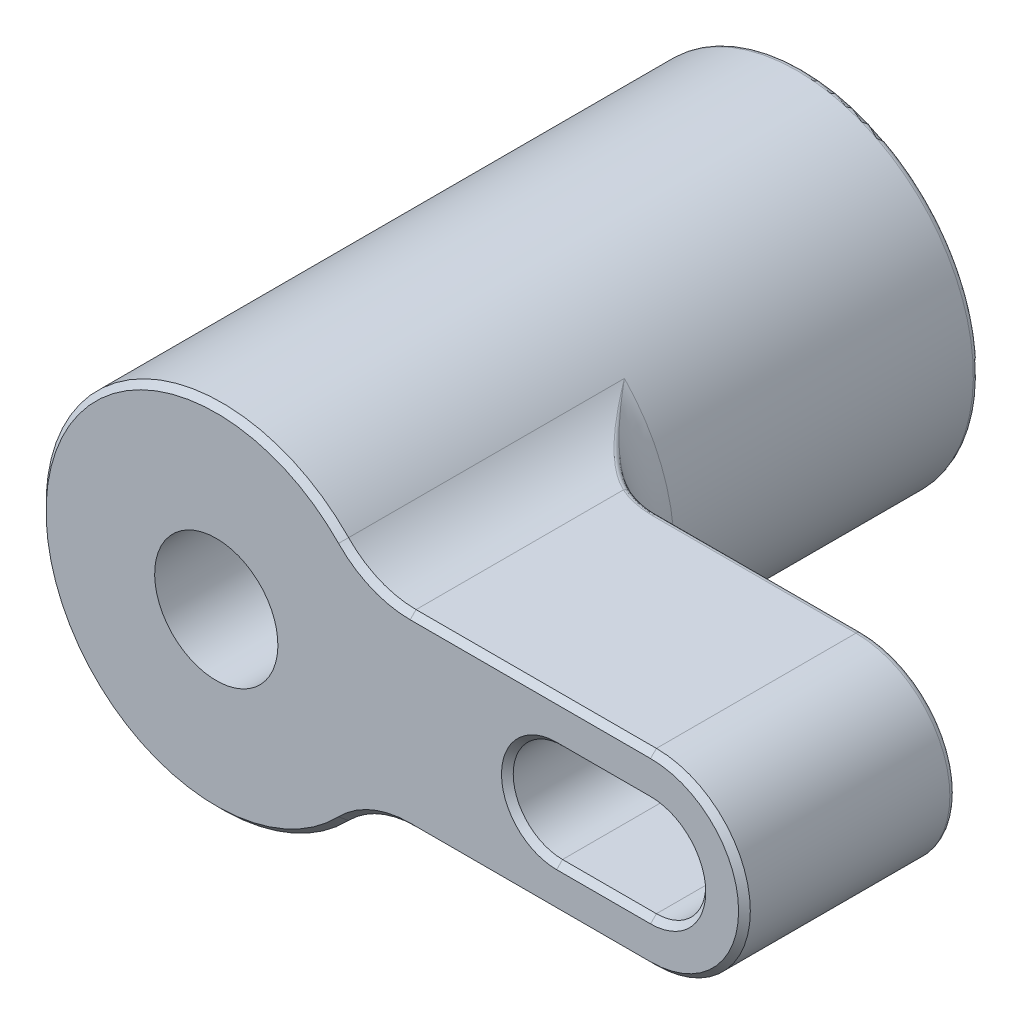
ISO-10303-21;
HEADER;
FILE_DESCRIPTION(('STEP AP214'),'2;1');
FILE_NAME('part.step','',(''),(''),'','','');
FILE_SCHEMA(('AUTOMOTIVE_DESIGN { 1 0 10303 214 1 1 1 1 }'));
ENDSEC;
DATA;
#1=APPLICATION_CONTEXT('core data for automotive mechanical design processes');
#2=APPLICATION_PROTOCOL_DEFINITION('international standard','automotive_design',2000,#1);
#3=PRODUCT_CONTEXT('',#1,'mechanical');
#4=PRODUCT('Part','Part','',(#3));
#5=PRODUCT_RELATED_PRODUCT_CATEGORY('part','',(#4));
#6=PRODUCT_DEFINITION_FORMATION('','',#4);
#7=PRODUCT_DEFINITION_CONTEXT('part definition',#1,'design');
#8=PRODUCT_DEFINITION('design','',#6,#7);
#9=PRODUCT_DEFINITION_SHAPE('','',#8);
#10=(LENGTH_UNIT() NAMED_UNIT(*) SI_UNIT(.MILLI.,.METRE.));
#11=(NAMED_UNIT(*) PLANE_ANGLE_UNIT() SI_UNIT($,.RADIAN.));
#12=(NAMED_UNIT(*) SI_UNIT($,.STERADIAN.) SOLID_ANGLE_UNIT());
#13=UNCERTAINTY_MEASURE_WITH_UNIT(LENGTH_MEASURE(1.E-05),#10,'distance_accuracy_value','');
#14=(GEOMETRIC_REPRESENTATION_CONTEXT(3) GLOBAL_UNCERTAINTY_ASSIGNED_CONTEXT((#13)) GLOBAL_UNIT_ASSIGNED_CONTEXT((#10,
#11,#12)) REPRESENTATION_CONTEXT('',''));
#15=CARTESIAN_POINT('',(0.,0.,0.));
#16=DIRECTION('',(0.,0.,1.));
#17=DIRECTION('',(1.,0.,0.));
#18=AXIS2_PLACEMENT_3D('',#15,#16,#17);
#19=CARTESIAN_POINT('',(0.3,0.,50.));
#20=DIRECTION('',(0.,0.,-1.));
#21=DIRECTION('',(0.,-1.,0.));
#22=AXIS2_PLACEMENT_3D('',#19,#20,#21);
#23=CYLINDRICAL_SURFACE('',#22,15.);
#24=DIRECTION('',(0.,0.,-1.));
#25=VECTOR('',#24,1.);
#26=CARTESIAN_POINT('',(-13.4477270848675,-6.,50.));
#27=LINE('',#26,#25);
#28=CARTESIAN_POINT('',(-13.4477270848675,-6.,42.75));
#29=VERTEX_POINT('',#28);
#30=CARTESIAN_POINT('',(-13.4477270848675,-6.,39.25));
#31=VERTEX_POINT('',#30);
#32=EDGE_CURVE('E677',#29,#31,#27,.T.);
#33=ORIENTED_EDGE('',*,*,#32,.F.);
#34=CARTESIAN_POINT('',(-13.8421356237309,-5.,43.75));
#35=CARTESIAN_POINT('',(-13.800113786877,-5.11885570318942,43.75));
#36=CARTESIAN_POINT('',(-13.7559369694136,-5.23877873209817,43.7283021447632));
#37=CARTESIAN_POINT('',(-13.7134853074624,-5.34997472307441,43.6867591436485));
#38=CARTESIAN_POINT('',(-13.6710156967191,-5.4612177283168,43.6451985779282));
#39=CARTESIAN_POINT('',(-13.6290636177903,-5.56693838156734,43.5825375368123));
#40=CARTESIAN_POINT('',(-13.5920761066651,-5.65775763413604,43.5032296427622));
#41=CARTESIAN_POINT('',(-13.5558000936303,-5.74682987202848,43.425447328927));
#42=CARTESIAN_POINT('',(-13.523257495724,-5.8242104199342,43.3291212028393));
#43=CARTESIAN_POINT('',(-13.4988501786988,-5.88147377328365,43.2222329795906));
#44=CARTESIAN_POINT('',(-13.4761210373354,-5.9347998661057,43.1226940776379));
#45=CARTESIAN_POINT('',(-13.4598396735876,-5.9721983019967,43.0108533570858));
#46=CARTESIAN_POINT('',(-13.452473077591,-5.98911381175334,42.8971525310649));
#47=CARTESIAN_POINT('',(-13.4493259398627,-5.99634041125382,42.84857756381));
#48=CARTESIAN_POINT('',(-13.4477270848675,-6.,42.7992103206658));
#49=CARTESIAN_POINT('',(-13.4477270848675,-6.,42.75));
#50=B_SPLINE_CURVE_WITH_KNOTS('',3,(#34,#35,#36,#37,#38,#39,#40,#41,#42,#43,#44,#45,#46,#47,#48,
#49),.UNSPECIFIED.,.F.,.F.,(4,3,3,3,3,4),(0.,0.233472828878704,0.467152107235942,
0.696551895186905,0.910056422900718,1.),.UNSPECIFIED.);
#51=CARTESIAN_POINT('',(-13.8421356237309,-5.,43.75));
#52=VERTEX_POINT('',#51);
#53=EDGE_CURVE('E466',#52,#29,#50,.T.);
#54=ORIENTED_EDGE('',*,*,#53,.F.);
#55=CARTESIAN_POINT('',(0.3,0.,43.75));
#56=DIRECTION('',(0.,0.,1.));
#57=DIRECTION('',(0.,1.,0.));
#58=AXIS2_PLACEMENT_3D('',#55,#56,#57);
#59=CIRCLE('',#58,15.);
#60=CARTESIAN_POINT('',(-13.8421356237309,5.,43.75));
#61=VERTEX_POINT('',#60);
#62=EDGE_CURVE('E78',#61,#52,#59,.T.);
#63=ORIENTED_EDGE('',*,*,#62,.F.);
#64=CARTESIAN_POINT('',(-13.4477270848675,6.,42.75));
#65=CARTESIAN_POINT('',(-13.4477270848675,6.,42.8553752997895));
#66=CARTESIAN_POINT('',(-13.4552707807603,5.98279041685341,42.9622013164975));
#67=CARTESIAN_POINT('',(-13.4693260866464,5.95026546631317,43.0614410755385));
#68=CARTESIAN_POINT('',(-13.4833613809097,5.91778682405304,43.1605395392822));
#69=CARTESIAN_POINT('',(-13.5041894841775,5.86929208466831,43.2547456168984));
#70=CARTESIAN_POINT('',(-13.5293984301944,5.80928042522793,43.3374224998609));
#71=CARTESIAN_POINT('',(-13.5555786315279,5.74695662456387,43.4232847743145));
#72=CARTESIAN_POINT('',(-13.5870856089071,5.67072123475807,43.4989552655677));
#73=CARTESIAN_POINT('',(-13.6208646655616,5.58654875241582,43.5599139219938));
#74=CARTESIAN_POINT('',(-13.6572676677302,5.49583778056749,43.6256078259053));
#75=CARTESIAN_POINT('',(-13.6972111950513,5.39360118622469,43.6759320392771));
#76=CARTESIAN_POINT('',(-13.7371775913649,5.28749896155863,43.7077809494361));
#77=CARTESIAN_POINT('',(-13.7721272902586,5.19471499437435,43.7356320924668));
#78=CARTESIAN_POINT('',(-13.8078070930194,5.09709574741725,43.75));
#79=CARTESIAN_POINT('',(-13.8421356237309,5.,43.75));
#80=B_SPLINE_CURVE_WITH_KNOTS('',3,(#64,#65,#66,#67,#68,#69,#70,#71,#72,#73,#74,#75,#76,#77,#78,
#79),.UNSPECIFIED.,.F.,.F.,(4,3,3,3,3,4),(0.,0.195166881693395,0.389839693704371,
0.591945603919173,0.809955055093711,1.),.UNSPECIFIED.);
#81=CARTESIAN_POINT('',(-13.4477270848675,6.,42.75));
#82=VERTEX_POINT('',#81);
#83=EDGE_CURVE('E378',#82,#61,#80,.T.);
#84=ORIENTED_EDGE('',*,*,#83,.F.);
#85=DIRECTION('',(0.,0.,-1.));
#86=VECTOR('',#85,1.);
#87=CARTESIAN_POINT('',(-13.4477270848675,6.,50.));
#88=LINE('',#87,#86);
#89=CARTESIAN_POINT('',(-13.4477270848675,6.,39.25));
#90=VERTEX_POINT('',#89);
#91=EDGE_CURVE('E626',#82,#90,#88,.T.);
#92=ORIENTED_EDGE('',*,*,#91,.T.);
#93=CARTESIAN_POINT('',(-13.8421356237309,5.,38.25));
#94=CARTESIAN_POINT('',(-13.800113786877,5.11885570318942,38.25));
#95=CARTESIAN_POINT('',(-13.7559369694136,5.23877873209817,38.2716978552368));
#96=CARTESIAN_POINT('',(-13.7134853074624,5.34997472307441,38.3132408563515));
#97=CARTESIAN_POINT('',(-13.6710156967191,5.4612177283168,38.3548014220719));
#98=CARTESIAN_POINT('',(-13.6290636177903,5.56693838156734,38.4174624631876));
#99=CARTESIAN_POINT('',(-13.5920761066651,5.65775763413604,38.4967703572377));
#100=CARTESIAN_POINT('',(-13.5558000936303,5.74682987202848,38.574552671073));
#101=CARTESIAN_POINT('',(-13.523257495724,5.8242104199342,38.6708787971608));
#102=CARTESIAN_POINT('',(-13.4988501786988,5.88147377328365,38.7777670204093));
#103=CARTESIAN_POINT('',(-13.4761210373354,5.9347998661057,38.877305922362));
#104=CARTESIAN_POINT('',(-13.4598396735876,5.9721983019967,38.9891466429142));
#105=CARTESIAN_POINT('',(-13.452473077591,5.98911381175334,39.1028474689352));
#106=CARTESIAN_POINT('',(-13.4493259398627,5.99634041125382,39.15142243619));
#107=CARTESIAN_POINT('',(-13.4477270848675,6.,39.2007896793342));
#108=CARTESIAN_POINT('',(-13.4477270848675,6.,39.25));
#109=B_SPLINE_CURVE_WITH_KNOTS('',3,(#93,#94,#95,#96,#97,#98,#99,#100,#101,#102,#103,#104,#105,
#106,#107,#108),.UNSPECIFIED.,.F.,.F.,(4,3,3,3,3,4),(0.,0.233472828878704,0.467152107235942,
0.696551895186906,0.910056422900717,1.),.UNSPECIFIED.);
#110=CARTESIAN_POINT('',(-13.8421356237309,5.,38.25));
#111=VERTEX_POINT('',#110);
#112=EDGE_CURVE('E631',#111,#90,#109,.T.);
#113=ORIENTED_EDGE('',*,*,#112,.F.);
#114=CARTESIAN_POINT('',(0.3,0.,38.25));
#115=DIRECTION('',(0.,0.,-1.));
#116=DIRECTION('',(0.,-1.,0.));
#117=AXIS2_PLACEMENT_3D('',#114,#115,#116);
#118=CIRCLE('',#117,15.);
#119=CARTESIAN_POINT('',(-13.8421356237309,-5.,38.25));
#120=VERTEX_POINT('',#119);
#121=EDGE_CURVE('E300',#120,#111,#118,.T.);
#122=ORIENTED_EDGE('',*,*,#121,.F.);
#123=CARTESIAN_POINT('',(-13.4477270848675,-6.,39.25));
#124=CARTESIAN_POINT('',(-13.4477270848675,-6.,39.1446247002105));
#125=CARTESIAN_POINT('',(-13.4552707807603,-5.98279041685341,39.0377986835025));
#126=CARTESIAN_POINT('',(-13.4693260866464,-5.95026546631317,38.9385589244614));
#127=CARTESIAN_POINT('',(-13.4833613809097,-5.91778682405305,38.8394604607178));
#128=CARTESIAN_POINT('',(-13.5041894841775,-5.86929208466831,38.7452543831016));
#129=CARTESIAN_POINT('',(-13.5293984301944,-5.80928042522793,38.6625775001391));
#130=CARTESIAN_POINT('',(-13.5555786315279,-5.74695662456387,38.5767152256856));
#131=CARTESIAN_POINT('',(-13.5870856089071,-5.67072123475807,38.5010447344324));
#132=CARTESIAN_POINT('',(-13.6208646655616,-5.58654875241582,38.4400860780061));
#133=CARTESIAN_POINT('',(-13.6572676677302,-5.49583778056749,38.3743921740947));
#134=CARTESIAN_POINT('',(-13.6972111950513,-5.39360118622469,38.3240679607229));
#135=CARTESIAN_POINT('',(-13.7371775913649,-5.28749896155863,38.2922190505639));
#136=CARTESIAN_POINT('',(-13.7721272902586,-5.19471499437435,38.2643679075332));
#137=CARTESIAN_POINT('',(-13.8078070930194,-5.09709574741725,38.25));
#138=CARTESIAN_POINT('',(-13.8421356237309,-5.,38.25));
#139=B_SPLINE_CURVE_WITH_KNOTS('',3,(#123,#124,#125,#126,#127,#128,#129,#130,#131,#132,#133,
#134,#135,#136,#137,#138),.UNSPECIFIED.,.F.,.F.,(4,3,3,3,3,4),(0.,0.195166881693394,
0.389839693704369,0.591945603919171,0.809955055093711,1.),.UNSPECIFIED.);
#140=EDGE_CURVE('E660',#31,#120,#139,.T.);
#141=ORIENTED_EDGE('',*,*,#140,.F.);
#142=EDGE_LOOP('',(#33,#54,#63,#84,#92,#113,#122,#141));
#143=FACE_BOUND('',#142,.T.);
#144=CARTESIAN_POINT('',(0.3,0.,42.25));
#145=DIRECTION('',(0.,0.,1.));
#146=DIRECTION('',(0.,1.,0.));
#147=AXIS2_PLACEMENT_3D('',#144,#145,#146);
#148=CIRCLE('',#147,15.);
#149=CARTESIAN_POINT('',(-13.8421356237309,5.,42.25));
#150=VERTEX_POINT('',#149);
#151=CARTESIAN_POINT('',(-14.6596122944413,-1.1,42.25));
#152=VERTEX_POINT('',#151);
#153=EDGE_CURVE('E507',#150,#152,#148,.T.);
#154=ORIENTED_EDGE('',*,*,#153,.T.);
#155=DIRECTION('',(0.,0.,-1.));
#156=VECTOR('',#155,1.);
#157=CARTESIAN_POINT('',(-14.6596122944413,-1.1,50.));
#158=LINE('',#157,#156);
#159=CARTESIAN_POINT('',(-14.6596122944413,-1.1,43.25));
#160=VERTEX_POINT('',#159);
#161=EDGE_CURVE('E440',#160,#152,#158,.T.);
#162=ORIENTED_EDGE('',*,*,#161,.F.);
#163=CARTESIAN_POINT('',(-14.6596122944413,-1.09999999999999,43.25));
#164=CARTESIAN_POINT('',(-14.6459740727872,-1.28548142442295,43.1429179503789));
#165=CARTESIAN_POINT('',(-14.6288801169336,-1.47077956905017,43.0359591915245));
#166=CARTESIAN_POINT('',(-14.5892502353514,-1.82759567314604,42.8299909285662));
#167=CARTESIAN_POINT('',(-14.5671896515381,-1.99915347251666,42.7309587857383));
#168=CARTESIAN_POINT('',(-14.5190374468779,-2.3284436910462,42.5408399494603));
#169=CARTESIAN_POINT('',(-14.4933857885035,-2.48622557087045,42.449727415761));
#170=CARTESIAN_POINT('',(-14.4393540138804,-2.7880001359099,42.2754588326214));
#171=CARTESIAN_POINT('',(-14.411378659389,-2.93204754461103,42.1922716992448));
#172=CARTESIAN_POINT('',(-14.3451568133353,-3.24813697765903,42.0097667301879));
#173=CARTESIAN_POINT('',(-14.3059745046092,-3.42003583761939,41.9105387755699));
#174=CARTESIAN_POINT('',(-14.2231388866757,-3.75595197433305,41.7166221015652));
#175=CARTESIAN_POINT('',(-14.1797221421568,-3.92001324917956,41.6219083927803));
#176=CARTESIAN_POINT('',(-14.0891256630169,-4.24023642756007,41.4370252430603));
#177=CARTESIAN_POINT('',(-14.0421727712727,-4.39644673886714,41.3468285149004));
#178=CARTESIAN_POINT('',(-13.9451810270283,-4.70098429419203,41.1709851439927));
#179=CARTESIAN_POINT('',(-13.8953593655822,-4.84936347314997,41.0853085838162));
#180=CARTESIAN_POINT('',(-13.8431555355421,-4.99711431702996,41.));
#181=B_SPLINE_CURVE_WITH_KNOTS('',3,(#163,#164,#165,#166,#167,#168,#169,#170,#171,#172,#173,
#174,#175,#176,#177,#178,#179,#180),.UNSPECIFIED.,.F.,.F.,(4,2,2,2,2,2,2,2,4),(0.,
0.643789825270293,1.2416423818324,1.79355889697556,2.2995411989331,2.90638052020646,
3.48934392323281,4.04843953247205,4.58367659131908),.UNSPECIFIED.);
#182=CARTESIAN_POINT('',(-13.8431555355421,-4.99711431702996,41.));
#183=VERTEX_POINT('',#182);
#184=EDGE_CURVE('E432',#160,#183,#181,.T.);
#185=ORIENTED_EDGE('',*,*,#184,.T.);
#186=CARTESIAN_POINT('',(-13.8431555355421,-4.99711431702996,41.));
#187=CARTESIAN_POINT('',(-13.8953608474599,-4.84935928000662,40.9146890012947));
#188=CARTESIAN_POINT('',(-13.9451838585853,-4.7009758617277,40.8290100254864));
#189=CARTESIAN_POINT('',(-14.0421771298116,-4.396432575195,40.6531634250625));
#190=CARTESIAN_POINT('',(-14.0891302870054,-4.24022079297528,40.5629658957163));
#191=CARTESIAN_POINT('',(-14.1797263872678,-3.91999750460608,40.3780827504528));
#192=CARTESIAN_POINT('',(-14.2231425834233,-3.75593761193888,40.2833698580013));
#193=CARTESIAN_POINT('',(-14.3059764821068,-3.42002716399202,40.0894563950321));
#194=CARTESIAN_POINT('',(-14.3451577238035,-3.24813263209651,39.9902308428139));
#195=CARTESIAN_POINT('',(-14.4113800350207,-2.93204097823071,39.8077244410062));
#196=CARTESIAN_POINT('',(-14.4393565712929,-2.78798696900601,39.7245334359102));
#197=CARTESIAN_POINT('',(-14.4933895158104,-2.48620353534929,39.5502596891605));
#198=CARTESIAN_POINT('',(-14.5190412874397,-2.32841940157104,39.4591458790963));
#199=CARTESIAN_POINT('',(-14.5671929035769,-1.99912909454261,39.2690270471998));
#200=CARTESIAN_POINT('',(-14.5892529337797,-1.82757347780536,39.1699961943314));
#201=CARTESIAN_POINT('',(-14.6288813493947,-1.4707662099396,38.9640330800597));
#202=CARTESIAN_POINT('',(-14.6459745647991,-1.2854747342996,38.8570781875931));
#203=CARTESIAN_POINT('',(-14.6596122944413,-1.09999999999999,38.75));
#204=B_SPLINE_CURVE_WITH_KNOTS('',3,(#186,#187,#188,#189,#190,#191,#192,#193,#194,#195,#196,
#197,#198,#199,#200,#201,#202,#203),.UNSPECIFIED.,.F.,.F.,(4,2,2,2,2,2,2,2,4),(0.,
0.535252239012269,1.09435290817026,1.67731125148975,2.28413539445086,2.79014091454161,
3.34206516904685,3.93990998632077,4.58367659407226),.UNSPECIFIED.);
#205=CARTESIAN_POINT('',(-14.6596122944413,-1.1,38.75));
#206=VERTEX_POINT('',#205);
#207=EDGE_CURVE('E437',#183,#206,#204,.T.);
#208=ORIENTED_EDGE('',*,*,#207,.T.);
#209=DIRECTION('',(0.,0.,-1.));
#210=VECTOR('',#209,1.);
#211=CARTESIAN_POINT('',(-14.6596122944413,-1.1,50.));
#212=LINE('',#211,#210);
#213=CARTESIAN_POINT('',(-14.6596122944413,-1.1,39.75));
#214=VERTEX_POINT('',#213);
#215=EDGE_CURVE('E521',#214,#206,#212,.T.);
#216=ORIENTED_EDGE('',*,*,#215,.F.);
#217=CARTESIAN_POINT('',(0.3,0.,39.75));
#218=DIRECTION('',(0.,0.,-1.));
#219=DIRECTION('',(0.,-1.,0.));
#220=AXIS2_PLACEMENT_3D('',#217,#218,#219);
#221=CIRCLE('',#220,15.);
#222=CARTESIAN_POINT('',(-13.8421356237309,5.,39.75));
#223=VERTEX_POINT('',#222);
#224=EDGE_CURVE('E572',#214,#223,#221,.T.);
#225=ORIENTED_EDGE('',*,*,#224,.T.);
#226=DIRECTION('',(0.,0.,-1.));
#227=VECTOR('',#226,1.);
#228=CARTESIAN_POINT('',(-13.8421356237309,5.,50.));
#229=LINE('',#228,#227);
#230=EDGE_CURVE('E583',#150,#223,#229,.T.);
#231=ORIENTED_EDGE('',*,*,#230,.F.);
#232=EDGE_LOOP('',(#154,#162,#185,#208,#216,#225,#231));
#233=FACE_BOUND('',#232,.T.);
#234=ADVANCED_FACE('F14',(#143,#233),#23,.T.);
#235=CARTESIAN_POINT('',(0.,0.,50.));
#236=DIRECTION('',(0.,0.,1.));
#237=DIRECTION('',(0.,1.,0.));
#238=AXIS2_PLACEMENT_3D('',#235,#236,#237);
#239=PLANE('',#238);
#240=CARTESIAN_POINT('',(29.,0.,50.));
#241=DIRECTION('',(0.,0.,1.));
#242=DIRECTION('',(0.,1.,0.));
#243=AXIS2_PLACEMENT_3D('',#240,#241,#242);
#244=CIRCLE('',#243,4.7);
#245=CARTESIAN_POINT('',(29.,-4.7,50.));
#246=VERTEX_POINT('',#245);
#247=CARTESIAN_POINT('',(29.,4.7,50.));
#248=VERTEX_POINT('',#247);
#249=EDGE_CURVE('E246',#246,#248,#244,.F.);
#250=ORIENTED_EDGE('',*,*,#249,.T.);
#251=DIRECTION('',(1.,0.,0.));
#252=VECTOR('',#251,1.);
#253=CARTESIAN_POINT('',(37.,4.7,50.));
#254=LINE('',#253,#252);
#255=CARTESIAN_POINT('',(37.,4.7,50.));
#256=VERTEX_POINT('',#255);
#257=EDGE_CURVE('E220',#248,#256,#254,.T.);
#258=ORIENTED_EDGE('',*,*,#257,.T.);
#259=CARTESIAN_POINT('',(37.,0.,50.));
#260=DIRECTION('',(0.,0.,1.));
#261=DIRECTION('',(0.,1.,0.));
#262=AXIS2_PLACEMENT_3D('',#259,#260,#261);
#263=CIRCLE('',#262,4.7);
#264=CARTESIAN_POINT('',(37.,-4.7,50.));
#265=VERTEX_POINT('',#264);
#266=EDGE_CURVE('E1454',#256,#265,#263,.F.);
#267=ORIENTED_EDGE('',*,*,#266,.T.);
#268=DIRECTION('',(-1.,0.,0.));
#269=VECTOR('',#268,1.);
#270=CARTESIAN_POINT('',(29.,-4.7,50.));
#271=LINE('',#270,#269);
#272=EDGE_CURVE('E1452',#265,#246,#271,.T.);
#273=ORIENTED_EDGE('',*,*,#272,.T.);
#274=EDGE_LOOP('',(#250,#258,#267,#273));
#275=FACE_BOUND('',#274,.T.);
#276=CARTESIAN_POINT('',(16.5227116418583,16.,50.));
#277=DIRECTION('',(0.,0.,1.));
#278=DIRECTION('',(0.,1.,0.));
#279=AXIS2_PLACEMENT_3D('',#276,#277,#278);
#280=CIRCLE('',#279,8.5);
#281=CARTESIAN_POINT('',(16.5227116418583,7.5,50.));
#282=VERTEX_POINT('',#281);
#283=CARTESIAN_POINT('',(10.4164921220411,10.0869565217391,50.));
#284=VERTEX_POINT('',#283);
#285=EDGE_CURVE('E1409',#282,#284,#280,.F.);
#286=ORIENTED_EDGE('',*,*,#285,.T.);
#287=CARTESIAN_POINT('',(0.,0.,50.));
#288=DIRECTION('',(0.,0.,1.));
#289=DIRECTION('',(0.,1.,0.));
#290=AXIS2_PLACEMENT_3D('',#287,#288,#289);
#291=CIRCLE('',#290,14.5);
#292=CARTESIAN_POINT('',(10.4164921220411,-10.0869565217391,50.));
#293=VERTEX_POINT('',#292);
#294=EDGE_CURVE('E1418',#284,#293,#291,.T.);
#295=ORIENTED_EDGE('',*,*,#294,.T.);
#296=CARTESIAN_POINT('',(16.5227116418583,-16.,50.));
#297=DIRECTION('',(0.,0.,1.));
#298=DIRECTION('',(0.,1.,0.));
#299=AXIS2_PLACEMENT_3D('',#296,#297,#298);
#300=CIRCLE('',#299,8.5);
#301=CARTESIAN_POINT('',(16.5227116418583,-7.5,50.));
#302=VERTEX_POINT('',#301);
#303=EDGE_CURVE('E1416',#293,#302,#300,.F.);
#304=ORIENTED_EDGE('',*,*,#303,.T.);
#305=DIRECTION('',(1.,0.,0.));
#306=VECTOR('',#305,1.);
#307=CARTESIAN_POINT('',(37.,-7.5,50.));
#308=LINE('',#307,#306);
#309=CARTESIAN_POINT('',(37.,-7.5,50.));
#310=VERTEX_POINT('',#309);
#311=EDGE_CURVE('E1414',#302,#310,#308,.T.);
#312=ORIENTED_EDGE('',*,*,#311,.T.);
#313=CARTESIAN_POINT('',(37.,0.,50.));
#314=DIRECTION('',(0.,0.,1.));
#315=DIRECTION('',(0.,1.,0.));
#316=AXIS2_PLACEMENT_3D('',#313,#314,#315);
#317=CIRCLE('',#316,7.5);
#318=CARTESIAN_POINT('',(37.,7.5,50.));
#319=VERTEX_POINT('',#318);
#320=EDGE_CURVE('E1412',#310,#319,#317,.T.);
#321=ORIENTED_EDGE('',*,*,#320,.T.);
#322=DIRECTION('',(-1.,0.,0.));
#323=VECTOR('',#322,1.);
#324=CARTESIAN_POINT('',(16.5227116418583,7.5,50.));
#325=LINE('',#324,#323);
#326=EDGE_CURVE('E1407',#319,#282,#325,.T.);
#327=ORIENTED_EDGE('',*,*,#326,.T.);
#328=EDGE_LOOP('',(#286,#295,#304,#312,#321,#327));
#329=FACE_BOUND('',#328,.T.);
#330=CARTESIAN_POINT('',(0.,0.,50.));
#331=DIRECTION('',(0.,0.,1.));
#332=DIRECTION('',(0.,1.,0.));
#333=AXIS2_PLACEMENT_3D('',#330,#331,#332);
#334=CIRCLE('',#333,5.25);
#335=CARTESIAN_POINT('',(0.,5.25,50.));
#336=VERTEX_POINT('',#335);
#337=EDGE_CURVE('E1470',#336,#336,#334,.T.);
#338=ORIENTED_EDGE('',*,*,#337,.F.);
#339=EDGE_LOOP('',(#338));
#340=FACE_BOUND('',#339,.T.);
#341=ADVANCED_FACE('F395',(#275,#329,#340),#239,.T.);
#342=CARTESIAN_POINT('',(0.,0.,0.));
#343=DIRECTION('',(0.,0.,1.));
#344=DIRECTION('',(0.,1.,0.));
#345=AXIS2_PLACEMENT_3D('',#342,#343,#344);
#346=PLANE('',#345);
#347=CARTESIAN_POINT('',(0.,0.,0.));
#348=DIRECTION('',(0.,0.,1.));
#349=DIRECTION('',(0.,1.,0.));
#350=AXIS2_PLACEMENT_3D('',#347,#348,#349);
#351=CIRCLE('',#350,11.5);
#352=CARTESIAN_POINT('',(0.,11.5,0.));
#353=VERTEX_POINT('',#352);
#354=EDGE_CURVE('E25',#353,#353,#351,.T.);
#355=ORIENTED_EDGE('',*,*,#354,.T.);
#356=EDGE_LOOP('',(#355));
#357=FACE_BOUND('',#356,.T.);
#358=CARTESIAN_POINT('',(0.,0.,0.));
#359=DIRECTION('',(0.,0.,1.));
#360=DIRECTION('',(0.,1.,0.));
#361=AXIS2_PLACEMENT_3D('',#358,#359,#360);
#362=CIRCLE('',#361,14.5);
#363=CARTESIAN_POINT('',(0.,14.5,0.));
#364=VERTEX_POINT('',#363);
#365=EDGE_CURVE('E1337',#364,#364,#362,.F.);
#366=ORIENTED_EDGE('',*,*,#365,.T.);
#367=EDGE_LOOP('',(#366));
#368=FACE_BOUND('',#367,.T.);
#369=ADVANCED_FACE('F280',(#357,#368),#346,.F.);
#370=CARTESIAN_POINT('',(0.,0.,50.));
#371=DIRECTION('',(0.,0.,-1.));
#372=DIRECTION('',(0.,-1.,0.));
#373=AXIS2_PLACEMENT_3D('',#370,#371,#372);
#374=CYLINDRICAL_SURFACE('',#373,15.);
#375=CARTESIAN_POINT('',(-14.1421356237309,-5.,38.25));
#376=CARTESIAN_POINT('',(-14.1078070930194,-5.09709574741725,38.25));
#377=CARTESIAN_POINT('',(-14.0721272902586,-5.19471499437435,38.2643679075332));
#378=CARTESIAN_POINT('',(-14.0371775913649,-5.28749896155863,38.2922190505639));
#379=CARTESIAN_POINT('',(-13.9972111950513,-5.39360118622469,38.3240679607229));
#380=CARTESIAN_POINT('',(-13.9572676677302,-5.49583778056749,38.3743921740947));
#381=CARTESIAN_POINT('',(-13.9208646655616,-5.58654875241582,38.4400860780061));
#382=CARTESIAN_POINT('',(-13.8870856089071,-5.67072123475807,38.5010447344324));
#383=CARTESIAN_POINT('',(-13.8555786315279,-5.74695662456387,38.5767152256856));
#384=CARTESIAN_POINT('',(-13.8293984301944,-5.80928042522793,38.6625775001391));
#385=CARTESIAN_POINT('',(-13.8041894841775,-5.86929208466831,38.7452543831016));
#386=CARTESIAN_POINT('',(-13.7833613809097,-5.91778682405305,38.8394604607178));
#387=CARTESIAN_POINT('',(-13.7693260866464,-5.95026546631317,38.9385589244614));
#388=CARTESIAN_POINT('',(-13.7552707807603,-5.98279041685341,39.0377986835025));
#389=CARTESIAN_POINT('',(-13.7477270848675,-6.,39.1446247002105));
#390=CARTESIAN_POINT('',(-13.7477270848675,-6.,39.25));
#391=B_SPLINE_CURVE_WITH_KNOTS('',3,(#375,#376,#377,#378,#379,#380,#381,#382,#383,#384,#385,
#386,#387,#388,#389,#390),.UNSPECIFIED.,.F.,.F.,(4,3,3,3,3,4),(0.,0.190044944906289,
0.408054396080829,0.61016030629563,0.804833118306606,1.),.UNSPECIFIED.);
#392=CARTESIAN_POINT('',(-13.7477270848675,-6.,39.25));
#393=VERTEX_POINT('',#392);
#394=CARTESIAN_POINT('',(-14.1421356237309,-5.,38.25));
#395=VERTEX_POINT('',#394);
#396=EDGE_CURVE('E656',#393,#395,#391,.F.);
#397=ORIENTED_EDGE('',*,*,#396,.T.);
#398=CARTESIAN_POINT('',(0.,0.,38.25));
#399=DIRECTION('',(0.,0.,-1.));
#400=DIRECTION('',(0.,-1.,0.));
#401=AXIS2_PLACEMENT_3D('',#398,#399,#400);
#402=CIRCLE('',#401,15.);
#403=CARTESIAN_POINT('',(-14.1421356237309,5.,38.25));
#404=VERTEX_POINT('',#403);
#405=EDGE_CURVE('E655',#395,#404,#402,.T.);
#406=ORIENTED_EDGE('',*,*,#405,.T.);
#407=CARTESIAN_POINT('',(-14.1421356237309,5.,38.25));
#408=CARTESIAN_POINT('',(-14.1315972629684,5.02980978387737,38.2500069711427));
#409=CARTESIAN_POINT('',(-14.1209649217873,5.05957995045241,38.2513650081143));
#410=CARTESIAN_POINT('',(-14.0995870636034,5.11885046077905,38.2567185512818));
#411=CARTESIAN_POINT('',(-14.0888415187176,5.14835073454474,38.2607147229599));
#412=CARTESIAN_POINT('',(-14.0673124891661,5.20688907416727,38.2712822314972));
#413=CARTESIAN_POINT('',(-14.0565289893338,5.23592692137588,38.277854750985));
#414=CARTESIAN_POINT('',(-14.03501901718,5.293314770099,38.2935529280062));
#415=CARTESIAN_POINT('',(-14.0242925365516,5.32166487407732,38.3026782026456));
#416=CARTESIAN_POINT('',(-13.9923323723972,5.40538547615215,38.3339148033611));
#417=CARTESIAN_POINT('',(-13.9713114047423,5.45944405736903,38.3598900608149));
#418=CARTESIAN_POINT('',(-13.9305978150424,5.56250957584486,38.4211582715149));
#419=CARTESIAN_POINT('',(-13.910904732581,5.61151826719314,38.4564479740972));
#420=CARTESIAN_POINT('',(-13.8740984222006,5.70190738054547,38.5352699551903));
#421=CARTESIAN_POINT('',(-13.856946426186,5.7434051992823,38.578648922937));
#422=CARTESIAN_POINT('',(-13.8255485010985,5.81857882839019,38.6726767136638));
#423=CARTESIAN_POINT('',(-13.8113021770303,5.85225570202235,38.7233245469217));
#424=CARTESIAN_POINT('',(-13.7875674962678,5.90794816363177,38.827096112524));
#425=CARTESIAN_POINT('',(-13.7778224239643,5.93059860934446,38.8798204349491));
#426=CARTESIAN_POINT('',(-13.7621680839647,5.96683484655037,38.9887822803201));
#427=CARTESIAN_POINT('',(-13.7562516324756,5.98043761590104,39.0450130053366));
#428=CARTESIAN_POINT('',(-13.7509248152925,5.99266887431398,39.1265389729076));
#429=CARTESIAN_POINT('',(-13.7497285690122,5.99541241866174,39.1511531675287));
#430=CARTESIAN_POINT('',(-13.7481335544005,5.99906875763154,39.2005089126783));
#431=CARTESIAN_POINT('',(-13.7477336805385,5.99998409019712,39.2252502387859));
#432=CARTESIAN_POINT('',(-13.7477270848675,6.,39.25));
#433=B_SPLINE_CURVE_WITH_KNOTS('',3,(#407,#408,#409,#410,#411,#412,#413,#414,#415,#416,#417,
#418,#419,#420,#421,#422,#423,#424,#425,#426,#427,#428,#429,#430,#431,#432),.UNSPECIFIED.,.F.,
.F.,(4,2,2,2,2,2,2,2,2,2,2,2,4),(0.,0.094815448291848,0.189654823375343,0.284537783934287,
0.379406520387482,0.569087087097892,0.758701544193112,0.945032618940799,1.13133834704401,
1.30503800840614,1.47841079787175,1.55272687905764,1.6269397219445),.UNSPECIFIED.);
#434=CARTESIAN_POINT('',(-13.7477270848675,6.,39.25));
#435=VERTEX_POINT('',#434);
#436=EDGE_CURVE('E293',#404,#435,#433,.T.);
#437=ORIENTED_EDGE('',*,*,#436,.T.);
#438=DIRECTION('',(0.,0.,-1.));
#439=VECTOR('',#438,1.);
#440=CARTESIAN_POINT('',(-13.7477270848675,6.,50.));
#441=LINE('',#440,#439);
#442=CARTESIAN_POINT('',(-13.7477270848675,6.,42.75));
#443=VERTEX_POINT('',#442);
#444=EDGE_CURVE('E634',#443,#435,#441,.T.);
#445=ORIENTED_EDGE('',*,*,#444,.F.);
#446=CARTESIAN_POINT('',(-14.1421356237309,5.,43.75));
#447=CARTESIAN_POINT('',(-14.1078070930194,5.09709574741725,43.75));
#448=CARTESIAN_POINT('',(-14.0721272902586,5.19471499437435,43.7356320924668));
#449=CARTESIAN_POINT('',(-14.0371775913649,5.28749896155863,43.7077809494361));
#450=CARTESIAN_POINT('',(-13.9972111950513,5.39360118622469,43.6759320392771));
#451=CARTESIAN_POINT('',(-13.9572676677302,5.49583778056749,43.6256078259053));
#452=CARTESIAN_POINT('',(-13.9208646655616,5.58654875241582,43.5599139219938));
#453=CARTESIAN_POINT('',(-13.8870856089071,5.67072123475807,43.4989552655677));
#454=CARTESIAN_POINT('',(-13.8555786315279,5.74695662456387,43.4232847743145));
#455=CARTESIAN_POINT('',(-13.8293984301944,5.80928042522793,43.3374224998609));
#456=CARTESIAN_POINT('',(-13.8041894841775,5.86929208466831,43.2547456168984));
#457=CARTESIAN_POINT('',(-13.7833613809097,5.91778682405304,43.1605395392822));
#458=CARTESIAN_POINT('',(-13.7693260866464,5.95026546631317,43.0614410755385));
#459=CARTESIAN_POINT('',(-13.7552707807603,5.98279041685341,42.9622013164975));
#460=CARTESIAN_POINT('',(-13.7477270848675,6.,42.8553752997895));
#461=CARTESIAN_POINT('',(-13.7477270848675,6.,42.75));
#462=B_SPLINE_CURVE_WITH_KNOTS('',3,(#446,#447,#448,#449,#450,#451,#452,#453,#454,#455,#456,
#457,#458,#459,#460,#461),.UNSPECIFIED.,.F.,.F.,(4,3,3,3,3,4),(0.,0.190044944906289,
0.408054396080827,0.610160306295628,0.804833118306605,1.),.UNSPECIFIED.);
#463=CARTESIAN_POINT('',(-14.1421356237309,5.,43.75));
#464=VERTEX_POINT('',#463);
#465=EDGE_CURVE('E262',#443,#464,#462,.F.);
#466=ORIENTED_EDGE('',*,*,#465,.T.);
#467=CARTESIAN_POINT('',(0.,0.,43.75));
#468=DIRECTION('',(0.,0.,1.));
#469=DIRECTION('',(0.,1.,0.));
#470=AXIS2_PLACEMENT_3D('',#467,#468,#469);
#471=CIRCLE('',#470,15.);
#472=CARTESIAN_POINT('',(-14.1421356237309,-5.,43.75));
#473=VERTEX_POINT('',#472);
#474=EDGE_CURVE('E619',#464,#473,#471,.T.);
#475=ORIENTED_EDGE('',*,*,#474,.T.);
#476=CARTESIAN_POINT('',(-14.1421356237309,-5.,43.75));
#477=CARTESIAN_POINT('',(-14.1315972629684,-5.02980978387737,43.7499930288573));
#478=CARTESIAN_POINT('',(-14.1209649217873,-5.05957995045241,43.7486349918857));
#479=CARTESIAN_POINT('',(-14.0995870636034,-5.11885046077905,43.7432814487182));
#480=CARTESIAN_POINT('',(-14.0888415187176,-5.14835073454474,43.7392852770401));
#481=CARTESIAN_POINT('',(-14.0673124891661,-5.20688907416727,43.7287177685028));
#482=CARTESIAN_POINT('',(-14.0565289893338,-5.23592692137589,43.722145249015));
#483=CARTESIAN_POINT('',(-14.03501901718,-5.293314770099,43.7064470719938));
#484=CARTESIAN_POINT('',(-14.0242925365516,-5.32166487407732,43.6973217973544));
#485=CARTESIAN_POINT('',(-13.9923323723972,-5.40538547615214,43.6660851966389));
#486=CARTESIAN_POINT('',(-13.9713114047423,-5.45944405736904,43.6401099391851));
#487=CARTESIAN_POINT('',(-13.9305978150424,-5.56250957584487,43.5788417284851));
#488=CARTESIAN_POINT('',(-13.910904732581,-5.61151826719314,43.5435520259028));
#489=CARTESIAN_POINT('',(-13.8740984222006,-5.70190738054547,43.4647300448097));
#490=CARTESIAN_POINT('',(-13.856946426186,-5.74340519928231,43.421351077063));
#491=CARTESIAN_POINT('',(-13.8255485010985,-5.81857882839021,43.3273232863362));
#492=CARTESIAN_POINT('',(-13.8113021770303,-5.85225570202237,43.2766754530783));
#493=CARTESIAN_POINT('',(-13.7875674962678,-5.90794816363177,43.172903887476));
#494=CARTESIAN_POINT('',(-13.7778224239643,-5.93059860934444,43.1201795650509));
#495=CARTESIAN_POINT('',(-13.7621680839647,-5.96683484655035,43.01121771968));
#496=CARTESIAN_POINT('',(-13.7562516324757,-5.98043761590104,42.9549869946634));
#497=CARTESIAN_POINT('',(-13.7509248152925,-5.99266887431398,42.8734610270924));
#498=CARTESIAN_POINT('',(-13.7497285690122,-5.99541241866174,42.8488468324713));
#499=CARTESIAN_POINT('',(-13.7481335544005,-5.99906875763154,42.7994910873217));
#500=CARTESIAN_POINT('',(-13.7477336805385,-5.99998409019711,42.7747497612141));
#501=CARTESIAN_POINT('',(-13.7477270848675,-6.,42.75));
#502=B_SPLINE_CURVE_WITH_KNOTS('',3,(#476,#477,#478,#479,#480,#481,#482,#483,#484,#485,#486,
#487,#488,#489,#490,#491,#492,#493,#494,#495,#496,#497,#498,#499,#500,#501),.UNSPECIFIED.,.F.,
.F.,(4,2,2,2,2,2,2,2,2,2,2,2,4),(0.,0.0948154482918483,0.189654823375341,0.284537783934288,
0.379406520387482,0.569087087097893,0.758701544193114,0.945032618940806,1.13133834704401,
1.30503800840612,1.47841079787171,1.55272687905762,1.6269397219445),.UNSPECIFIED.);
#503=CARTESIAN_POINT('',(-13.7477270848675,-6.,42.75));
#504=VERTEX_POINT('',#503);
#505=EDGE_CURVE('E302',#473,#504,#502,.T.);
#506=ORIENTED_EDGE('',*,*,#505,.T.);
#507=DIRECTION('',(0.,0.,-1.));
#508=VECTOR('',#507,1.);
#509=CARTESIAN_POINT('',(-13.7477270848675,-6.,50.));
#510=LINE('',#509,#508);
#511=EDGE_CURVE('E67',#504,#393,#510,.T.);
#512=ORIENTED_EDGE('',*,*,#511,.T.);
#513=EDGE_LOOP('',(#397,#406,#437,#445,#466,#475,#506,#512));
#514=FACE_BOUND('',#513,.T.);
#515=CARTESIAN_POINT('',(0.,0.,0.5));
#516=DIRECTION('',(0.,0.,1.));
#517=DIRECTION('',(0.,1.,0.));
#518=AXIS2_PLACEMENT_3D('',#515,#516,#517);
#519=CIRCLE('',#518,15.);
#520=CARTESIAN_POINT('',(0.,15.,0.5));
#521=VERTEX_POINT('',#520);
#522=EDGE_CURVE('E1493',#521,#521,#519,.T.);
#523=ORIENTED_EDGE('',*,*,#522,.T.);
#524=EDGE_LOOP('',(#523));
#525=FACE_BOUND('',#524,.T.);
#526=DIRECTION('',(0.,0.,-1.));
#527=VECTOR('',#526,1.);
#528=CARTESIAN_POINT('',(10.7756815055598,-10.4347826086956,50.));
#529=LINE('',#528,#527);
#530=CARTESIAN_POINT('',(10.7756815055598,-10.4347826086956,26.));
#531=VERTEX_POINT('',#530);
#532=CARTESIAN_POINT('',(10.7756815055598,-10.4347826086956,49.5));
#533=VERTEX_POINT('',#532);
#534=EDGE_CURVE('E1490',#531,#533,#529,.F.);
#535=ORIENTED_EDGE('',*,*,#534,.T.);
#536=CARTESIAN_POINT('',(0.,0.,49.5));
#537=DIRECTION('',(0.,0.,1.));
#538=DIRECTION('',(0.,1.,0.));
#539=AXIS2_PLACEMENT_3D('',#536,#537,#538);
#540=CIRCLE('',#539,15.);
#541=CARTESIAN_POINT('',(10.7756815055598,10.4347826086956,49.5));
#542=VERTEX_POINT('',#541);
#543=EDGE_CURVE('E1421',#533,#542,#540,.F.);
#544=ORIENTED_EDGE('',*,*,#543,.T.);
#545=DIRECTION('',(0.,0.,-1.));
#546=VECTOR('',#545,1.);
#547=CARTESIAN_POINT('',(10.7756815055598,10.4347826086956,50.));
#548=LINE('',#547,#546);
#549=CARTESIAN_POINT('',(10.7756815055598,10.4347826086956,26.));
#550=VERTEX_POINT('',#549);
#551=EDGE_CURVE('E1320',#542,#550,#548,.T.);
#552=ORIENTED_EDGE('',*,*,#551,.T.);
#553=CARTESIAN_POINT('',(0.,0.,26.));
#554=DIRECTION('',(0.,0.,1.));
#555=DIRECTION('',(0.,1.,0.));
#556=AXIS2_PLACEMENT_3D('',#553,#554,#555);
#557=CIRCLE('',#556,15.);
#558=EDGE_CURVE('E1324',#550,#531,#557,.F.);
#559=ORIENTED_EDGE('',*,*,#558,.T.);
#560=EDGE_LOOP('',(#535,#544,#552,#559));
#561=FACE_BOUND('',#560,.T.);
#562=ADVANCED_FACE('F269',(#514,#525,#561),#374,.T.);
#563=CARTESIAN_POINT('',(12.6885775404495,-8.,50.));
#564=DIRECTION('',(0.,1.,0.));
#565=DIRECTION('',(-1.,0.,0.));
#566=AXIS2_PLACEMENT_3D('',#563,#564,#565);
#567=PLANE('',#566);
#568=DIRECTION('',(0.,0.,-1.));
#569=VECTOR('',#568,1.);
#570=CARTESIAN_POINT('',(37.,-8.,50.));
#571=LINE('',#570,#569);
#572=CARTESIAN_POINT('',(37.,-8.,49.5));
#573=VERTEX_POINT('',#572);
#574=CARTESIAN_POINT('',(37.,-8.,32.5));
#575=VERTEX_POINT('',#574);
#576=EDGE_CURVE('E1485',#573,#575,#571,.T.);
#577=ORIENTED_EDGE('',*,*,#576,.F.);
#578=DIRECTION('',(-1.,0.,0.));
#579=VECTOR('',#578,1.);
#580=CARTESIAN_POINT('',(16.5227116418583,-8.,49.5));
#581=LINE('',#580,#579);
#582=CARTESIAN_POINT('',(16.5227116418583,-8.,49.5));
#583=VERTEX_POINT('',#582);
#584=EDGE_CURVE('E1426',#573,#583,#581,.T.);
#585=ORIENTED_EDGE('',*,*,#584,.T.);
#586=DIRECTION('',(0.,0.,1.));
#587=VECTOR('',#586,1.);
#588=CARTESIAN_POINT('',(16.5227116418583,-8.,32.));
#589=LINE('',#588,#587);
#590=CARTESIAN_POINT('',(16.5227116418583,-8.,31.8395536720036));
#591=VERTEX_POINT('',#590);
#592=EDGE_CURVE('E1487',#583,#591,#589,.F.);
#593=ORIENTED_EDGE('',*,*,#592,.T.);
#594=CARTESIAN_POINT('',(14.7843741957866,-7.66672366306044,30.136720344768));
#595=CARTESIAN_POINT('',(14.703976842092,-8.,30.2229241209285));
#596=CARTESIAN_POINT('',(14.4628672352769,-8.,30.4814470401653));
#597=CARTESIAN_POINT('',(15.0695374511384,-7.65445265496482,30.396721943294));
#598=CARTESIAN_POINT('',(15.0010170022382,-8.,30.4864277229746));
#599=CARTESIAN_POINT('',(14.7648854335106,-8.,30.7631154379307));
#600=CARTESIAN_POINT('',(15.3767892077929,-7.64179787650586,30.6324144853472));
#601=CARTESIAN_POINT('',(15.317334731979,-8.,30.7202922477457));
#602=CARTESIAN_POINT('',(15.0908631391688,-8.,31.0184490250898));
#603=CARTESIAN_POINT('',(16.0261332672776,-7.61628369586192,31.0516724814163));
#604=CARTESIAN_POINT('',(15.9833809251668,-8.,31.1335345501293));
#605=CARTESIAN_POINT('',(15.7808972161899,-8.,31.4726451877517));
#606=CARTESIAN_POINT('',(16.3682833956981,-7.60342398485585,31.2351494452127));
#607=CARTESIAN_POINT('',(16.3341424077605,-8.,31.3118633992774));
#608=CARTESIAN_POINT('',(16.145016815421,-8.,31.6714118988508));
#609=CARTESIAN_POINT('',(17.0896905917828,-7.57765702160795,31.5510965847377));
#610=CARTESIAN_POINT('',(17.0706802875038,-8.,31.6155071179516));
#611=CARTESIAN_POINT('',(16.9138673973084,-8.,32.0136879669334));
#612=CARTESIAN_POINT('',(17.4698355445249,-7.56476440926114,31.6815158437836));
#613=CARTESIAN_POINT('',(17.4574979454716,-8.,31.7371912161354));
#614=CARTESIAN_POINT('',(17.3195832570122,-8.,32.154975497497));
#615=CARTESIAN_POINT('',(18.2452804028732,-7.53982706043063,31.8777862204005));
#616=CARTESIAN_POINT('',(18.2430687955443,-8.,31.9153323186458));
#617=CARTESIAN_POINT('',(18.1482240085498,-8.,32.367601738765));
#618=CARTESIAN_POINT('',(18.640538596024,-7.52778021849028,31.9438033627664));
#619=CARTESIAN_POINT('',(18.6418280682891,-8.,31.9704052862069));
#620=CARTESIAN_POINT('',(18.5711017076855,-8.,32.4391203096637));
#621=CARTESIAN_POINT('',(19.1337317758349,-7.51350940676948,31.9842140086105));
#622=CARTESIAN_POINT('',(19.1331258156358,-8.,31.9973655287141));
#623=CARTESIAN_POINT('',(19.0992903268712,-8.,32.482898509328));
#624=CARTESIAN_POINT('',(19.2299577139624,-7.51076079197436,31.990127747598));
#625=CARTESIAN_POINT('',(19.2296704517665,-8.,32.0006638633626));
#626=CARTESIAN_POINT('',(19.2023691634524,-8.,32.4893050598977));
#627=CARTESIAN_POINT('',(19.4224745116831,-7.50533028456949,31.998019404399));
#628=CARTESIAN_POINT('',(19.4226214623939,-8.,32.0033109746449));
#629=CARTESIAN_POINT('',(19.4086435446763,-8.,32.4978543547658));
#630=CARTESIAN_POINT('',(19.5187652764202,-7.50264834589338,32.0000001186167));
#631=CARTESIAN_POINT('',(19.5190196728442,-8.,32.0026412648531));
#632=CARTESIAN_POINT('',(19.5118389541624,-8.,32.500000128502));
#633=CARTESIAN_POINT('',(19.8023719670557,-7.49484725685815,31.999999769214));
#634=CARTESIAN_POINT('',(19.8033420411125,-8.,31.9948207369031));
#635=CARTESIAN_POINT('',(19.8158481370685,-8.,32.4999997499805));
#636=CARTESIAN_POINT('',(19.9896578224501,-7.48982168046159,31.9925010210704));
#637=CARTESIAN_POINT('',(19.9901711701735,-8.,31.9820618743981));
#638=CARTESIAN_POINT('',(20.0166922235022,-8.,32.4918761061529));
#639=CARTESIAN_POINT('',(20.3629286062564,-7.48003902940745,31.9623611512));
#640=CARTESIAN_POINT('',(20.3617646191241,-8.,31.9416374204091));
#641=CARTESIAN_POINT('',(20.4171373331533,-8.,32.4592245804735));
#642=CARTESIAN_POINT('',(20.5489127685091,-7.4752821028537,31.93971176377));
#643=CARTESIAN_POINT('',(20.5464282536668,-8.,31.9138201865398));
#644=CARTESIAN_POINT('',(20.6167376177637,-8.,32.43468774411));
#645=CARTESIAN_POINT('',(20.9196456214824,-7.46601474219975,31.8789715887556));
#646=CARTESIAN_POINT('',(20.9137776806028,-8.,31.8430931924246));
#647=CARTESIAN_POINT('',(21.0147474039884,-8.,32.3688858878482));
#648=CARTESIAN_POINT('',(21.1043739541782,-7.46150647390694,31.8407639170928));
#649=CARTESIAN_POINT('',(21.0963038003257,-8.,31.7999390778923));
#650=CARTESIAN_POINT('',(21.2131360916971,-8.,32.3274942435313));
#651=CARTESIAN_POINT('',(21.4697386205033,-7.45278522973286,31.7489922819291));
#652=CARTESIAN_POINT('',(21.4565918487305,-8.,31.6987966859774));
#653=CARTESIAN_POINT('',(21.6056380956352,-8.,32.2280749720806));
#654=CARTESIAN_POINT('',(21.6503760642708,-7.44857217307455,31.6954325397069));
#655=CARTESIAN_POINT('',(21.6342180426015,-8.,31.6406953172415));
#656=CARTESIAN_POINT('',(21.7997525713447,-8.,32.1700519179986));
#657=CARTESIAN_POINT('',(21.8283182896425,-7.44451004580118,31.6342298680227));
#658=CARTESIAN_POINT('',(21.808007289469,-8.,31.5756179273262));
#659=CARTESIAN_POINT('',(21.9910223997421,-8.,32.1037490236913));
#660=(BOUNDED_SURFACE() B_SPLINE_SURFACE(3,2,((#594,#595,#596),(#597,#598,#599),(#600,#601,
#602),(#603,#604,#605),(#606,#607,#608),(#609,#610,#611),(#612,#613,#614),(#615,#616,#617),
(#618,#619,#620),(#621,#622,#623),(#624,#625,#626),(#627,#628,#629),(#630,#631,#632),(#633,#634,
#635),(#636,#637,#638),(#639,#640,#641),(#642,#643,#644),(#645,#646,#647),(#648,#649,#650),
(#651,#652,#653),(#654,#655,#656),(#657,#658,#659)),.UNSPECIFIED.,.F.,.F.,
.F.) B_SPLINE_SURFACE_WITH_KNOTS((4,2,2,2,2,2,2,2,2,2,4),(3,3),(0.,1.23682901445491,
2.47574177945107,3.75880901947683,5.0385597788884,5.34834887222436,5.65791762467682,
6.26022877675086,6.86286879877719,7.47012232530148,8.07720903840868),(0.,1.),
.UNSPECIFIED.) GEOMETRIC_REPRESENTATION_ITEM() RATIONAL_B_SPLINE_SURFACE(((1.,0.816531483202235,
1.),(1.,0.809024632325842,1.),(1.,0.801165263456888,1.),(1.,0.785076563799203,1.),(1.,
0.776846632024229,1.),(1.,0.760086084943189,1.),(1.,0.751555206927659,1.),(1.,0.734776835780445,
1.),(1.,0.726528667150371,1.),(1.,0.716598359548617,1.),(1.,0.714677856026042,1.),(1.,
0.710868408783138,1.),(1.,0.708979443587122,1.),(1.,0.703463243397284,1.),(1.,0.699881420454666,
1.),(1.,0.692857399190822,1.),(1.,0.689415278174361,1.),(1.,0.682661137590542,1.),(1.,
0.679350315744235,1.),(1.,0.672900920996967,1.),(1.,0.669762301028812,1.),(1.,0.6667158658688,1.))) REPRESENTATION_ITEM('') SURFACE());
#661=CARTESIAN_POINT('',(14.4628672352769,-8.,30.4814470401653));
#662=CARTESIAN_POINT('',(14.7648854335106,-8.,30.7631154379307));
#663=CARTESIAN_POINT('',(15.0908631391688,-8.,31.0184490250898));
#664=CARTESIAN_POINT('',(15.7808972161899,-8.,31.4726451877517));
#665=CARTESIAN_POINT('',(16.145016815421,-8.,31.6714118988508));
#666=CARTESIAN_POINT('',(16.9138673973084,-8.,32.0136879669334));
#667=CARTESIAN_POINT('',(17.3195832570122,-8.,32.154975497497));
#668=CARTESIAN_POINT('',(18.1482240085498,-8.,32.367601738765));
#669=CARTESIAN_POINT('',(18.5711017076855,-8.,32.4391203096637));
#670=CARTESIAN_POINT('',(19.0992903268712,-8.,32.482898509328));
#671=CARTESIAN_POINT('',(19.2023691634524,-8.,32.4893050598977));
#672=CARTESIAN_POINT('',(19.4086435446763,-8.,32.4978543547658));
#673=CARTESIAN_POINT('',(19.5118389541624,-8.,32.500000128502));
#674=CARTESIAN_POINT('',(19.8158481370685,-8.,32.4999997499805));
#675=CARTESIAN_POINT('',(20.0166922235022,-8.,32.4918761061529));
#676=CARTESIAN_POINT('',(20.4171373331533,-8.,32.4592245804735));
#677=CARTESIAN_POINT('',(20.6167376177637,-8.,32.43468774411));
#678=CARTESIAN_POINT('',(21.0147474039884,-8.,32.3688858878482));
#679=CARTESIAN_POINT('',(21.2131360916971,-8.,32.3274942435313));
#680=CARTESIAN_POINT('',(21.6056380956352,-8.,32.2280749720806));
#681=CARTESIAN_POINT('',(21.7997525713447,-8.,32.1700519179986));
#682=CARTESIAN_POINT('',(21.9910223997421,-8.,32.1037490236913));
#683=B_SPLINE_CURVE_WITH_KNOTS('',3,(#661,#662,#663,#664,#665,#666,#667,#668,#669,#670,#671,
#672,#673,#674,#675,#676,#677,#678,#679,#680,#681,#682),.UNSPECIFIED.,.F.,.F.,(4,2,2,2,2,2,2,2,
2,2,4),(0.,1.23682901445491,2.47574177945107,3.75880901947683,5.0385597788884,5.34834887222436,
5.65791762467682,6.26022877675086,6.86286879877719,7.47012232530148,8.07720903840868),.UNSPECIFIED.);
#684=CARTESIAN_POINT('',(19.6150452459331,-8.,32.5));
#685=VERTEX_POINT('',#684);
#686=EDGE_CURVE('E1374',#591,#685,#683,.T.);
#687=ORIENTED_EDGE('',*,*,#686,.T.);
#688=DIRECTION('',(1.,0.,0.));
#689=VECTOR('',#688,1.);
#690=CARTESIAN_POINT('',(12.6885775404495,-8.,32.5));
#691=LINE('',#690,#689);
#692=EDGE_CURVE('E1370',#685,#575,#691,.T.);
#693=ORIENTED_EDGE('',*,*,#692,.T.);
#694=EDGE_LOOP('',(#577,#585,#593,#687,#693));
#695=FACE_BOUND('',#694,.T.);
#696=ADVANCED_FACE('F279',(#695),#567,.F.);
#697=CARTESIAN_POINT('',(37.,0.,50.));
#698=DIRECTION('',(0.,0.,-1.));
#699=DIRECTION('',(0.,-1.,0.));
#700=AXIS2_PLACEMENT_3D('',#697,#698,#699);
#701=CYLINDRICAL_SURFACE('',#700,8.);
#702=DIRECTION('',(0.,0.,-1.));
#703=VECTOR('',#702,1.);
#704=CARTESIAN_POINT('',(37.,8.,50.));
#705=LINE('',#704,#703);
#706=CARTESIAN_POINT('',(37.,8.,49.5));
#707=VERTEX_POINT('',#706);
#708=CARTESIAN_POINT('',(37.,8.,32.5));
#709=VERTEX_POINT('',#708);
#710=EDGE_CURVE('E1483',#707,#709,#705,.T.);
#711=ORIENTED_EDGE('',*,*,#710,.F.);
#712=CARTESIAN_POINT('',(37.,0.,49.5));
#713=DIRECTION('',(0.,0.,1.));
#714=DIRECTION('',(0.,1.,0.));
#715=AXIS2_PLACEMENT_3D('',#712,#713,#714);
#716=CIRCLE('',#715,8.);
#717=EDGE_CURVE('E1428',#707,#573,#716,.F.);
#718=ORIENTED_EDGE('',*,*,#717,.T.);
#719=ORIENTED_EDGE('',*,*,#576,.T.);
#720=CARTESIAN_POINT('',(37.,0.,32.5));
#721=DIRECTION('',(0.,0.,1.));
#722=DIRECTION('',(0.,1.,0.));
#723=AXIS2_PLACEMENT_3D('',#720,#721,#722);
#724=CIRCLE('',#723,8.);
#725=EDGE_CURVE('E1524',#575,#709,#724,.T.);
#726=ORIENTED_EDGE('',*,*,#725,.T.);
#727=EDGE_LOOP('',(#711,#718,#719,#726));
#728=FACE_BOUND('',#727,.T.);
#729=ADVANCED_FACE('F1138',(#728),#701,.T.);
#730=CARTESIAN_POINT('',(12.6885775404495,8.,50.));
#731=DIRECTION('',(0.,-1.,0.));
#732=DIRECTION('',(1.,0.,0.));
#733=AXIS2_PLACEMENT_3D('',#730,#731,#732);
#734=PLANE('',#733);
#735=DIRECTION('',(0.,0.,1.));
#736=VECTOR('',#735,1.);
#737=CARTESIAN_POINT('',(16.5227116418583,8.,50.));
#738=LINE('',#737,#736);
#739=CARTESIAN_POINT('',(16.5227116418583,8.,31.8395536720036));
#740=VERTEX_POINT('',#739);
#741=CARTESIAN_POINT('',(16.5227116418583,8.,49.5));
#742=VERTEX_POINT('',#741);
#743=EDGE_CURVE('E1322',#740,#742,#738,.T.);
#744=ORIENTED_EDGE('',*,*,#743,.T.);
#745=DIRECTION('',(1.,0.,0.));
#746=VECTOR('',#745,1.);
#747=CARTESIAN_POINT('',(37.,8.,49.5));
#748=LINE('',#747,#746);
#749=EDGE_CURVE('E1432',#742,#707,#748,.T.);
#750=ORIENTED_EDGE('',*,*,#749,.T.);
#751=ORIENTED_EDGE('',*,*,#710,.T.);
#752=DIRECTION('',(-1.,0.,0.));
#753=VECTOR('',#752,1.);
#754=CARTESIAN_POINT('',(12.6885775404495,8.,32.5));
#755=LINE('',#754,#753);
#756=CARTESIAN_POINT('',(19.615045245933,8.,32.5));
#757=VERTEX_POINT('',#756);
#758=EDGE_CURVE('E1261',#709,#757,#755,.T.);
#759=ORIENTED_EDGE('',*,*,#758,.T.);
#760=CARTESIAN_POINT('',(21.8283182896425,7.44451004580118,31.6342298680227));
#761=CARTESIAN_POINT('',(21.808007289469,8.,31.5756179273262));
#762=CARTESIAN_POINT('',(21.9910223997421,8.,32.1037490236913));
#763=CARTESIAN_POINT('',(21.6510346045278,7.44855720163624,31.6952033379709));
#764=CARTESIAN_POINT('',(21.6348563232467,8.,31.6404533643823));
#765=CARTESIAN_POINT('',(21.8004604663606,8.,32.1698036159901));
#766=CARTESIAN_POINT('',(21.4710844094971,7.4527538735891,31.7485918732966));
#767=CARTESIAN_POINT('',(21.4579080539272,8.,31.6983647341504));
#768=CARTESIAN_POINT('',(21.6070843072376,8.,32.2276411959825));
#769=CARTESIAN_POINT('',(21.1072261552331,7.46143763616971,31.8401090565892));
#770=CARTESIAN_POINT('',(21.0991127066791,8.,31.7992116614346));
#771=CARTESIAN_POINT('',(21.2161996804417,8.,32.3267848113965));
#772=CARTESIAN_POINT('',(20.9233193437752,7.46592463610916,31.878242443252));
#773=CARTESIAN_POINT('',(20.9174036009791,8.,31.8422672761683));
#774=CARTESIAN_POINT('',(21.0186925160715,8.,32.3680959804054));
#775=CARTESIAN_POINT('',(20.5527305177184,7.47518498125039,31.9392105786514));
#776=CARTESIAN_POINT('',(20.5502230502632,8.,31.9132131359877));
#777=CARTESIAN_POINT('',(20.6208351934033,8.,32.4341447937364));
#778=CARTESIAN_POINT('',(20.3660473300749,7.47995845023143,31.9620386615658));
#779=CARTESIAN_POINT('',(20.3648686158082,8.,31.9412288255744));
#780=CARTESIAN_POINT('',(20.4204838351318,8.,32.4588752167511));
#781=CARTESIAN_POINT('',(19.9913115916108,7.48977719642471,31.9924372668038));
#782=CARTESIAN_POINT('',(19.9918324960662,8.,31.9819504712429));
#783=CARTESIAN_POINT('',(20.0184656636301,8.,32.4918070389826));
#784=CARTESIAN_POINT('',(19.8032589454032,7.4948224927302,32.0000067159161));
#785=CARTESIAN_POINT('',(19.8042487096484,8.,31.9948006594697));
#786=CARTESIAN_POINT('',(19.816798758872,8.,32.5000072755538));
#787=CARTESIAN_POINT('',(19.2159529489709,7.51097849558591,31.99998575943));
#788=CARTESIAN_POINT('',(19.2202653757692,8.,32.0108486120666));
#789=CARTESIAN_POINT('',(19.187242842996,8.,32.4999845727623));
#790=CARTESIAN_POINT('',(18.8161365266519,7.5225514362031,31.9659076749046));
#791=CARTESIAN_POINT('',(18.8187695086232,8.,31.9883863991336));
#792=CARTESIAN_POINT('',(18.7590510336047,8.,32.4630666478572));
#793=CARTESIAN_POINT('',(18.027928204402,7.54664292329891,31.8319317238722));
#794=CARTESIAN_POINT('',(18.0233081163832,8.,31.87436368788));
#795=CARTESIAN_POINT('',(17.9158340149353,8.,32.3179260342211));
#796=CARTESIAN_POINT('',(17.6395144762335,7.55915947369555,31.7321695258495));
#797=CARTESIAN_POINT('',(17.629604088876,8.,31.7845246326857));
#798=CARTESIAN_POINT('',(17.500783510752,8.,32.2098503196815));
#799=CARTESIAN_POINT('',(17.1708805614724,7.57507628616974,31.5698996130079));
#800=CARTESIAN_POINT('',(17.1489375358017,8.,31.6306011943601));
#801=CARTESIAN_POINT('',(17.0006602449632,8.,32.0340579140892));
#802=CARTESIAN_POINT('',(17.0802145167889,7.57819526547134,31.5364712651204));
#803=CARTESIAN_POINT('',(17.0566449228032,8.,31.5989826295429));
#804=CARTESIAN_POINT('',(16.9039334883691,8.,31.9978438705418));
#805=CARTESIAN_POINT('',(16.9003482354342,7.5844603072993,31.4660732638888));
#806=CARTESIAN_POINT('',(16.8734147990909,8.,31.5320137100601));
#807=CARTESIAN_POINT('',(16.7121068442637,8.,31.9215793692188));
#808=CARTESIAN_POINT('',(16.8111468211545,7.5876063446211,31.429106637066));
#809=CARTESIAN_POINT('',(16.7824704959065,8.,31.4966870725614));
#810=CARTESIAN_POINT('',(16.6170056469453,8.,31.8815321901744));
#811=CARTESIAN_POINT('',(16.3702297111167,7.60335288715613,31.2359980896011));
#812=CARTESIAN_POINT('',(16.336112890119,8.,31.3126884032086));
#813=CARTESIAN_POINT('',(16.1470892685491,8.,31.6723312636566));
#814=CARTESIAN_POINT('',(16.0293150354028,7.61615684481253,31.0533490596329));
#815=CARTESIAN_POINT('',(15.9867316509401,8.,31.1352435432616));
#816=CARTESIAN_POINT('',(15.7842757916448,8.,31.4744614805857));
#817=CARTESIAN_POINT('',(15.5426378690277,7.63528211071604,30.739683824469));
#818=CARTESIAN_POINT('',(15.4848847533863,8.,30.8244275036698));
#819=CARTESIAN_POINT('',(15.2671055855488,8.,31.1346574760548));
#820=CARTESIAN_POINT('',(15.3838872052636,7.64167158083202,30.6279350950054));
#821=CARTESIAN_POINT('',(15.3217121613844,8.,30.7137581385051));
#822=CARTESIAN_POINT('',(15.0985453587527,8.,31.0135963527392));
#823=CARTESIAN_POINT('',(15.0763799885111,7.65431775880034,30.3917444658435));
#824=CARTESIAN_POINT('',(15.0054787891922,8.,30.4787341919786));
#825=CARTESIAN_POINT('',(14.772291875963,8.,30.7577231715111));
#826=CARTESIAN_POINT('',(14.9276205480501,7.66057450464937,30.2673062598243));
#827=CARTESIAN_POINT('',(14.8522644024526,8.,30.3544763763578));
#828=CARTESIAN_POINT('',(14.6145954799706,8.,30.6229151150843));
#829=CARTESIAN_POINT('',(14.7843741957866,7.66672366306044,30.136720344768));
#830=CARTESIAN_POINT('',(14.703976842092,8.,30.2229241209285));
#831=CARTESIAN_POINT('',(14.4628672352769,8.,30.4814470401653));
#832=(BOUNDED_SURFACE() B_SPLINE_SURFACE(3,2,((#760,#761,#762),(#763,#764,#765),(#766,#767,
#768),(#769,#770,#771),(#772,#773,#774),(#775,#776,#777),(#778,#779,#780),(#781,#782,#783),
(#784,#785,#786),(#787,#788,#789),(#790,#791,#792),(#793,#794,#795),(#796,#797,#798),(#799,#800,
#801),(#802,#803,#804),(#805,#806,#807),(#808,#809,#810),(#811,#812,#813),(#814,#815,#816),
(#817,#818,#819),(#820,#821,#822),(#823,#824,#825),(#826,#827,#828),(#829,#830,#831)),
.UNSPECIFIED.,.F.,.F.,.F.) B_SPLINE_SURFACE_WITH_KNOTS((4,2,2,2,2,2,2,2,2,2,2,4),(3,3),(0.,
0.604821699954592,1.2094553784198,1.81435221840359,2.4192916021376,3.70201782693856,
4.9821028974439,5.29190035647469,5.60143515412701,6.83447425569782,7.45647095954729,
8.07828712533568),(0.,1.),
.UNSPECIFIED.) GEOMETRIC_REPRESENTATION_ITEM() RATIONAL_B_SPLINE_SURFACE(((1.,0.6667158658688,
1.),(1.,0.669751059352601,1.),(1.,0.672877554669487,1.),(1.,0.679299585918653,1.),(1.,
0.682595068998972,1.),(1.,0.689344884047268,1.),(1.,0.692799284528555,1.),(1.,0.699849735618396,
1.),(1.,0.703445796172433,1.),(1.,0.714869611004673,1.),(1.,0.722924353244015,1.),(1.,
0.739398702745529,1.),(1.,0.747817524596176,1.),(1.,0.758340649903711,1.),(1.,0.76039429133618,
1.),(1.,0.764502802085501,1.),(1.,0.766557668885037,1.),(1.,0.776800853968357,1.),(1.,
0.784997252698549,1.),(1.,0.797056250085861,1.),(1.,0.801053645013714,1.),(1.,0.80890867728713,
1.),(1.,0.812766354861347,1.),(1.,0.816531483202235,1.))) REPRESENTATION_ITEM('') SURFACE());
#833=CARTESIAN_POINT('',(21.9910223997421,8.,32.1037490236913));
#834=CARTESIAN_POINT('',(21.8004604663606,8.,32.1698036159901));
#835=CARTESIAN_POINT('',(21.6070843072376,8.,32.2276411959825));
#836=CARTESIAN_POINT('',(21.2161996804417,8.,32.3267848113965));
#837=CARTESIAN_POINT('',(21.0186925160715,8.,32.3680959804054));
#838=CARTESIAN_POINT('',(20.6208351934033,8.,32.4341447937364));
#839=CARTESIAN_POINT('',(20.4204838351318,8.,32.4588752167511));
#840=CARTESIAN_POINT('',(20.0184656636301,8.,32.4918070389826));
#841=CARTESIAN_POINT('',(19.816798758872,8.,32.5000072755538));
#842=CARTESIAN_POINT('',(19.187242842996,8.,32.4999845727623));
#843=CARTESIAN_POINT('',(18.7590510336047,8.,32.4630666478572));
#844=CARTESIAN_POINT('',(17.9158340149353,8.,32.3179260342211));
#845=CARTESIAN_POINT('',(17.500783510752,8.,32.2098503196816));
#846=CARTESIAN_POINT('',(17.0006602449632,8.,32.0340579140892));
#847=CARTESIAN_POINT('',(16.9039334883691,8.,31.9978438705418));
#848=CARTESIAN_POINT('',(16.7121068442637,8.,31.9215793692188));
#849=CARTESIAN_POINT('',(16.6170056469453,8.,31.8815321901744));
#850=CARTESIAN_POINT('',(16.1470892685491,8.,31.6723312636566));
#851=CARTESIAN_POINT('',(15.7842757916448,8.,31.4744614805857));
#852=CARTESIAN_POINT('',(15.2671055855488,8.,31.1346574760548));
#853=CARTESIAN_POINT('',(15.0985453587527,8.,31.0135963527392));
#854=CARTESIAN_POINT('',(14.772291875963,8.,30.7577231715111));
#855=CARTESIAN_POINT('',(14.6145954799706,8.,30.6229151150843));
#856=CARTESIAN_POINT('',(14.4628672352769,8.,30.4814470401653));
#857=B_SPLINE_CURVE_WITH_KNOTS('',3,(#833,#834,#835,#836,#837,#838,#839,#840,#841,#842,#843,
#844,#845,#846,#847,#848,#849,#850,#851,#852,#853,#854,#855,#856),.UNSPECIFIED.,.F.,.F.,(4,2,2,
2,2,2,2,2,2,2,2,4),(0.,0.604821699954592,1.2094553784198,1.81435221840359,2.4192916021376,
3.70201782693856,4.9821028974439,5.29190035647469,5.60143515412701,6.83447425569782,
7.45647095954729,8.07828712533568),.UNSPECIFIED.);
#858=EDGE_CURVE('E1212',#757,#740,#857,.T.);
#859=ORIENTED_EDGE('',*,*,#858,.T.);
#860=EDGE_LOOP('',(#744,#750,#751,#759,#859));
#861=FACE_BOUND('',#860,.T.);
#862=ADVANCED_FACE('F1128',(#861),#734,.F.);
#863=CARTESIAN_POINT('',(0.,0.,32.));
#864=DIRECTION('',(0.,0.,1.));
#865=DIRECTION('',(0.,1.,0.));
#866=AXIS2_PLACEMENT_3D('',#863,#864,#865);
#867=PLANE('',#866);
#868=CARTESIAN_POINT('',(29.,0.,32.));
#869=DIRECTION('',(0.,0.,1.));
#870=DIRECTION('',(0.,1.,0.));
#871=AXIS2_PLACEMENT_3D('',#868,#869,#870);
#872=CIRCLE('',#871,4.7);
#873=CARTESIAN_POINT('',(29.,4.7,32.));
#874=VERTEX_POINT('',#873);
#875=CARTESIAN_POINT('',(29.,-4.7,32.));
#876=VERTEX_POINT('',#875);
#877=EDGE_CURVE('E1530',#874,#876,#872,.T.);
#878=ORIENTED_EDGE('',*,*,#877,.T.);
#879=DIRECTION('',(1.,0.,0.));
#880=VECTOR('',#879,1.);
#881=CARTESIAN_POINT('',(0.,-4.7,32.));
#882=LINE('',#881,#880);
#883=CARTESIAN_POINT('',(37.,-4.7,32.));
#884=VERTEX_POINT('',#883);
#885=EDGE_CURVE('E1534',#876,#884,#882,.T.);
#886=ORIENTED_EDGE('',*,*,#885,.T.);
#887=CARTESIAN_POINT('',(37.,0.,32.));
#888=DIRECTION('',(0.,0.,1.));
#889=DIRECTION('',(0.,1.,0.));
#890=AXIS2_PLACEMENT_3D('',#887,#888,#889);
#891=CIRCLE('',#890,4.7);
#892=CARTESIAN_POINT('',(37.,4.7,32.));
#893=VERTEX_POINT('',#892);
#894=EDGE_CURVE('E1525',#884,#893,#891,.T.);
#895=ORIENTED_EDGE('',*,*,#894,.T.);
#896=DIRECTION('',(-1.,0.,0.));
#897=VECTOR('',#896,1.);
#898=CARTESIAN_POINT('',(0.,4.7,32.));
#899=LINE('',#898,#897);
#900=EDGE_CURVE('E1526',#893,#874,#899,.T.);
#901=ORIENTED_EDGE('',*,*,#900,.T.);
#902=EDGE_LOOP('',(#878,#886,#895,#901));
#903=FACE_BOUND('',#902,.T.);
#904=CARTESIAN_POINT('',(37.,0.,32.));
#905=DIRECTION('',(0.,0.,1.));
#906=DIRECTION('',(0.,1.,0.));
#907=AXIS2_PLACEMENT_3D('',#904,#905,#906);
#908=CIRCLE('',#907,7.5);
#909=CARTESIAN_POINT('',(37.,7.5,32.));
#910=VERTEX_POINT('',#909);
#911=CARTESIAN_POINT('',(37.,-7.5,32.));
#912=VERTEX_POINT('',#911);
#913=EDGE_CURVE('E1380',#910,#912,#908,.F.);
#914=ORIENTED_EDGE('',*,*,#913,.T.);
#915=DIRECTION('',(1.,0.,0.));
#916=VECTOR('',#915,1.);
#917=CARTESIAN_POINT('',(0.,-7.5,32.));
#918=LINE('',#917,#916);
#919=CARTESIAN_POINT('',(19.6150452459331,-7.5,32.));
#920=VERTEX_POINT('',#919);
#921=EDGE_CURVE('E1262',#912,#920,#918,.F.);
#922=ORIENTED_EDGE('',*,*,#921,.T.);
#923=CARTESIAN_POINT('',(0.,0.,32.));
#924=DIRECTION('',(0.,0.,1.));
#925=DIRECTION('',(0.,1.,0.));
#926=AXIS2_PLACEMENT_3D('',#923,#924,#925);
#927=CIRCLE('',#926,21.);
#928=CARTESIAN_POINT('',(19.6150452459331,7.5,32.));
#929=VERTEX_POINT('',#928);
#930=EDGE_CURVE('E1332',#920,#929,#927,.T.);
#931=ORIENTED_EDGE('',*,*,#930,.T.);
#932=DIRECTION('',(-1.,0.,0.));
#933=VECTOR('',#932,1.);
#934=CARTESIAN_POINT('',(0.,7.5,32.));
#935=LINE('',#934,#933);
#936=EDGE_CURVE('E1381',#929,#910,#935,.F.);
#937=ORIENTED_EDGE('',*,*,#936,.T.);
#938=EDGE_LOOP('',(#914,#922,#931,#937));
#939=FACE_BOUND('',#938,.T.);
#940=ADVANCED_FACE('F1118',(#903,#939),#867,.F.);
#941=CARTESIAN_POINT('',(0.,0.,32.));
#942=DIRECTION('',(0.,0.,1.));
#943=DIRECTION('',(0.,1.,0.));
#944=AXIS2_PLACEMENT_3D('',#941,#942,#943);
#945=CYLINDRICAL_SURFACE('',#944,10.);
#946=CARTESIAN_POINT('',(0.,0.,1.5));
#947=DIRECTION('',(0.,0.,1.));
#948=DIRECTION('',(0.,1.,0.));
#949=AXIS2_PLACEMENT_3D('',#946,#947,#948);
#950=CIRCLE('',#949,10.);
#951=CARTESIAN_POINT('',(0.,10.,1.5));
#952=VERTEX_POINT('',#951);
#953=EDGE_CURVE('E9',#952,#952,#950,.F.);
#954=ORIENTED_EDGE('',*,*,#953,.T.);
#955=EDGE_LOOP('',(#954));
#956=FACE_BOUND('',#955,.T.);
#957=CARTESIAN_POINT('',(0.,0.,31.));
#958=DIRECTION('',(0.,0.,1.));
#959=DIRECTION('',(0.,1.,0.));
#960=AXIS2_PLACEMENT_3D('',#957,#958,#959);
#961=CIRCLE('',#960,10.);
#962=CARTESIAN_POINT('',(0.,10.,31.));
#963=VERTEX_POINT('',#962);
#964=EDGE_CURVE('E1480',#963,#963,#961,.T.);
#965=ORIENTED_EDGE('',*,*,#964,.T.);
#966=EDGE_LOOP('',(#965));
#967=FACE_BOUND('',#966,.T.);
#968=ADVANCED_FACE('F1108',(#956,#967),#945,.F.);
#969=CARTESIAN_POINT('',(-5.25,0.,31.));
#970=DIRECTION('',(0.,0.,-1.));
#971=DIRECTION('',(0.,-1.,0.));
#972=AXIS2_PLACEMENT_3D('',#969,#970,#971);
#973=PLANE('',#972);
#974=CARTESIAN_POINT('',(0.,0.,31.));
#975=DIRECTION('',(0.,0.,1.));
#976=DIRECTION('',(0.,1.,0.));
#977=AXIS2_PLACEMENT_3D('',#974,#975,#976);
#978=CIRCLE('',#977,5.25);
#979=CARTESIAN_POINT('',(0.,5.25,31.));
#980=VERTEX_POINT('',#979);
#981=EDGE_CURVE('E1477',#980,#980,#978,.T.);
#982=ORIENTED_EDGE('',*,*,#981,.T.);
#983=EDGE_LOOP('',(#982));
#984=FACE_BOUND('',#983,.T.);
#985=ORIENTED_EDGE('',*,*,#964,.F.);
#986=EDGE_LOOP('',(#985));
#987=FACE_BOUND('',#986,.T.);
#988=ADVANCED_FACE('F1098',(#984,#987),#973,.T.);
#989=CARTESIAN_POINT('',(0.,0.,32.));
#990=DIRECTION('',(0.,0.,1.));
#991=DIRECTION('',(0.,1.,0.));
#992=AXIS2_PLACEMENT_3D('',#989,#990,#991);
#993=CYLINDRICAL_SURFACE('',#992,5.25);
#994=ORIENTED_EDGE('',*,*,#337,.T.);
#995=EDGE_LOOP('',(#994));
#996=FACE_BOUND('',#995,.T.);
#997=ORIENTED_EDGE('',*,*,#981,.F.);
#998=EDGE_LOOP('',(#997));
#999=FACE_BOUND('',#998,.T.);
#1000=ADVANCED_FACE('F1089',(#996,#999),#993,.F.);
#1001=CARTESIAN_POINT('',(29.,0.,0.));
#1002=DIRECTION('',(0.,0.,1.));
#1003=DIRECTION('',(0.,1.,0.));
#1004=AXIS2_PLACEMENT_3D('',#1001,#1002,#1003);
#1005=CYLINDRICAL_SURFACE('',#1004,4.2);
#1006=DIRECTION('',(0.,0.,1.));
#1007=VECTOR('',#1006,1.);
#1008=CARTESIAN_POINT('',(29.,4.2,0.));
#1009=LINE('',#1008,#1007);
#1010=CARTESIAN_POINT('',(29.,4.2,32.5));
#1011=VERTEX_POINT('',#1010);
#1012=CARTESIAN_POINT('',(29.,4.2,49.5));
#1013=VERTEX_POINT('',#1012);
#1014=EDGE_CURVE('E214',#1011,#1013,#1009,.T.);
#1015=ORIENTED_EDGE('',*,*,#1014,.T.);
#1016=CARTESIAN_POINT('',(29.,0.,49.5));
#1017=DIRECTION('',(0.,0.,1.));
#1018=DIRECTION('',(0.,1.,0.));
#1019=AXIS2_PLACEMENT_3D('',#1016,#1017,#1018);
#1020=CIRCLE('',#1019,4.2);
#1021=CARTESIAN_POINT('',(29.,-4.2,49.5));
#1022=VERTEX_POINT('',#1021);
#1023=EDGE_CURVE('E209',#1013,#1022,#1020,.T.);
#1024=ORIENTED_EDGE('',*,*,#1023,.T.);
#1025=DIRECTION('',(0.,0.,1.));
#1026=VECTOR('',#1025,1.);
#1027=CARTESIAN_POINT('',(29.,-4.2,0.));
#1028=LINE('',#1027,#1026);
#1029=CARTESIAN_POINT('',(29.,-4.2,32.5));
#1030=VERTEX_POINT('',#1029);
#1031=EDGE_CURVE('E212',#1030,#1022,#1028,.T.);
#1032=ORIENTED_EDGE('',*,*,#1031,.F.);
#1033=CARTESIAN_POINT('',(29.,0.,32.5));
#1034=DIRECTION('',(0.,0.,1.));
#1035=DIRECTION('',(0.,1.,0.));
#1036=AXIS2_PLACEMENT_3D('',#1033,#1034,#1035);
#1037=CIRCLE('',#1036,4.2);
#1038=EDGE_CURVE('E1537',#1030,#1011,#1037,.F.);
#1039=ORIENTED_EDGE('',*,*,#1038,.T.);
#1040=EDGE_LOOP('',(#1015,#1024,#1032,#1039));
#1041=FACE_BOUND('',#1040,.T.);
#1042=ADVANCED_FACE('F211',(#1041),#1005,.F.);
#1043=CARTESIAN_POINT('',(29.,4.2,0.));
#1044=DIRECTION('',(0.,1.,0.));
#1045=DIRECTION('',(-1.,0.,0.));
#1046=AXIS2_PLACEMENT_3D('',#1043,#1044,#1045);
#1047=PLANE('',#1046);
#1048=DIRECTION('',(0.,0.,1.));
#1049=VECTOR('',#1048,1.);
#1050=CARTESIAN_POINT('',(37.,4.2,0.));
#1051=LINE('',#1050,#1049);
#1052=CARTESIAN_POINT('',(37.,4.2,32.5));
#1053=VERTEX_POINT('',#1052);
#1054=CARTESIAN_POINT('',(37.,4.2,49.5));
#1055=VERTEX_POINT('',#1054);
#1056=EDGE_CURVE('E1461',#1053,#1055,#1051,.T.);
#1057=ORIENTED_EDGE('',*,*,#1056,.T.);
#1058=DIRECTION('',(-1.,0.,0.));
#1059=VECTOR('',#1058,1.);
#1060=CARTESIAN_POINT('',(29.,4.2,49.5));
#1061=LINE('',#1060,#1059);
#1062=EDGE_CURVE('E1434',#1055,#1013,#1061,.T.);
#1063=ORIENTED_EDGE('',*,*,#1062,.T.);
#1064=ORIENTED_EDGE('',*,*,#1014,.F.);
#1065=DIRECTION('',(-1.,0.,0.));
#1066=VECTOR('',#1065,1.);
#1067=CARTESIAN_POINT('',(29.,4.2,32.5));
#1068=LINE('',#1067,#1066);
#1069=EDGE_CURVE('E1466',#1011,#1053,#1068,.F.);
#1070=ORIENTED_EDGE('',*,*,#1069,.T.);
#1071=EDGE_LOOP('',(#1057,#1063,#1064,#1070));
#1072=FACE_BOUND('',#1071,.T.);
#1073=ADVANCED_FACE('F397',(#1072),#1047,.F.);
#1074=CARTESIAN_POINT('',(37.,0.,0.));
#1075=DIRECTION('',(0.,0.,1.));
#1076=DIRECTION('',(0.,1.,0.));
#1077=AXIS2_PLACEMENT_3D('',#1074,#1075,#1076);
#1078=CYLINDRICAL_SURFACE('',#1077,4.2);
#1079=DIRECTION('',(0.,0.,1.));
#1080=VECTOR('',#1079,1.);
#1081=CARTESIAN_POINT('',(37.,-4.2,0.));
#1082=LINE('',#1081,#1080);
#1083=CARTESIAN_POINT('',(37.,-4.2,32.5));
#1084=VERTEX_POINT('',#1083);
#1085=CARTESIAN_POINT('',(37.,-4.2,49.5));
#1086=VERTEX_POINT('',#1085);
#1087=EDGE_CURVE('E231',#1084,#1086,#1082,.T.);
#1088=ORIENTED_EDGE('',*,*,#1087,.T.);
#1089=CARTESIAN_POINT('',(37.,0.,49.5));
#1090=DIRECTION('',(0.,0.,1.));
#1091=DIRECTION('',(0.,1.,0.));
#1092=AXIS2_PLACEMENT_3D('',#1089,#1090,#1091);
#1093=CIRCLE('',#1092,4.2);
#1094=EDGE_CURVE('E219',#1086,#1055,#1093,.T.);
#1095=ORIENTED_EDGE('',*,*,#1094,.T.);
#1096=ORIENTED_EDGE('',*,*,#1056,.F.);
#1097=CARTESIAN_POINT('',(37.,0.,32.5));
#1098=DIRECTION('',(0.,0.,1.));
#1099=DIRECTION('',(0.,1.,0.));
#1100=AXIS2_PLACEMENT_3D('',#1097,#1098,#1099);
#1101=CIRCLE('',#1100,4.2);
#1102=EDGE_CURVE('E1410',#1053,#1084,#1101,.F.);
#1103=ORIENTED_EDGE('',*,*,#1102,.T.);
#1104=EDGE_LOOP('',(#1088,#1095,#1096,#1103));
#1105=FACE_BOUND('',#1104,.T.);
#1106=ADVANCED_FACE('F1064',(#1105),#1078,.F.);
#1107=CARTESIAN_POINT('',(29.,-4.2,0.));
#1108=DIRECTION('',(0.,-1.,0.));
#1109=DIRECTION('',(1.,0.,0.));
#1110=AXIS2_PLACEMENT_3D('',#1107,#1108,#1109);
#1111=PLANE('',#1110);
#1112=ORIENTED_EDGE('',*,*,#1031,.T.);
#1113=DIRECTION('',(1.,0.,0.));
#1114=VECTOR('',#1113,1.);
#1115=CARTESIAN_POINT('',(37.,-4.2,49.5));
#1116=LINE('',#1115,#1114);
#1117=EDGE_CURVE('E227',#1022,#1086,#1116,.T.);
#1118=ORIENTED_EDGE('',*,*,#1117,.T.);
#1119=ORIENTED_EDGE('',*,*,#1087,.F.);
#1120=DIRECTION('',(1.,0.,0.));
#1121=VECTOR('',#1120,1.);
#1122=CARTESIAN_POINT('',(29.,-4.2,32.5));
#1123=LINE('',#1122,#1121);
#1124=EDGE_CURVE('E230',#1084,#1030,#1123,.F.);
#1125=ORIENTED_EDGE('',*,*,#1124,.T.);
#1126=EDGE_LOOP('',(#1112,#1118,#1119,#1125));
#1127=FACE_BOUND('',#1126,.T.);
#1128=ADVANCED_FACE('F225',(#1127),#1111,.F.);
#1129=CARTESIAN_POINT('',(16.5227116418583,-16.,50.));
#1130=DIRECTION('',(0.,0.,-1.));
#1131=DIRECTION('',(0.,-1.,0.));
#1132=AXIS2_PLACEMENT_3D('',#1129,#1130,#1131);
#1133=CYLINDRICAL_SURFACE('',#1132,8.);
#1134=ORIENTED_EDGE('',*,*,#592,.F.);
#1135=CARTESIAN_POINT('',(16.5227116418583,-16.,49.5));
#1136=DIRECTION('',(0.,0.,1.));
#1137=DIRECTION('',(0.,1.,0.));
#1138=AXIS2_PLACEMENT_3D('',#1135,#1136,#1137);
#1139=CIRCLE('',#1138,8.);
#1140=EDGE_CURVE('E1424',#583,#533,#1139,.T.);
#1141=ORIENTED_EDGE('',*,*,#1140,.T.);
#1142=ORIENTED_EDGE('',*,*,#534,.F.);
#1143=CARTESIAN_POINT('',(18.2066977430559,-8.17924614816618,32.3994776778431));
#1144=CARTESIAN_POINT('',(18.2882252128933,-8.19680086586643,31.9226194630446));
#1145=CARTESIAN_POINT('',(18.3927077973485,-7.72436611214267,31.9072101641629));
#1146=CARTESIAN_POINT('',(18.0627862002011,-8.14823729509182,32.3721487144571));
#1147=CARTESIAN_POINT('',(18.1553042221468,-8.16662415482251,31.9009796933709));
#1148=CARTESIAN_POINT('',(18.2506557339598,-7.69611432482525,31.8819834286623));
#1149=CARTESIAN_POINT('',(17.9189425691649,-8.12144148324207,32.3393847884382));
#1150=CARTESIAN_POINT('',(18.0214046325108,-8.13976906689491,31.8748287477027));
#1151=CARTESIAN_POINT('',(18.1085156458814,-7.67235241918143,31.8517398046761));
#1152=CARTESIAN_POINT('',(17.6325072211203,-8.07603240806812,32.263767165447));
#1153=CARTESIAN_POINT('',(17.7530656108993,-8.09309244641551,31.8136530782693));
#1154=CARTESIAN_POINT('',(17.8251462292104,-7.63355145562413,31.7819389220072));
#1155=CARTESIAN_POINT('',(17.489914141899,-8.05740875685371,32.2209263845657));
#1156=CARTESIAN_POINT('',(17.6189264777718,-8.07324527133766,31.7787924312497));
#1157=CARTESIAN_POINT('',(17.6839159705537,-7.61850131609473,31.74239358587));
#1158=CARTESIAN_POINT('',(17.2083466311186,-8.02819115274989,32.1264063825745));
#1159=CARTESIAN_POINT('',(17.3521110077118,-8.04071248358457,31.7009263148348));
#1160=CARTESIAN_POINT('',(17.4046950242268,-7.59692072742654,31.6551443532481));
#1161=CARTESIAN_POINT('',(17.0693494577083,-8.01750764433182,32.0748340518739));
#1162=CARTESIAN_POINT('',(17.2196905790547,-8.0279006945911,31.6581887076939));
#1163=CARTESIAN_POINT('',(17.2666857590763,-7.5902946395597,31.607539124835));
#1164=CARTESIAN_POINT('',(16.7939474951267,-8.00340969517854,31.9632969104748));
#1165=CARTESIAN_POINT('',(16.9554772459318,-8.00901394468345,31.5647053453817));
#1166=CARTESIAN_POINT('',(16.9928828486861,-7.58481456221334,31.5045817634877));
#1167=CARTESIAN_POINT('',(16.6575440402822,-7.99999890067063,31.9033279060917));
#1168=CARTESIAN_POINT('',(16.8238595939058,-8.00286981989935,31.5141220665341));
#1169=CARTESIAN_POINT('',(16.8570903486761,-7.58596447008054,31.4492257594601));
#1170=CARTESIAN_POINT('',(16.2841628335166,-8.00000194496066,31.7267227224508));
#1171=CARTESIAN_POINT('',(16.4629863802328,-7.99501869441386,31.3643402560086));
#1172=CARTESIAN_POINT('',(16.4848553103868,-7.59926116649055,31.2862055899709));
#1173=CARTESIAN_POINT('',(16.0505316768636,-8.01068364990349,31.6019808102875));
#1174=CARTESIAN_POINT('',(16.2336158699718,-7.99990833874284,31.2569571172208));
#1175=CARTESIAN_POINT('',(16.2513395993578,-7.61918661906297,31.1710592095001));
#1176=CARTESIAN_POINT('',(15.5950839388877,-8.05066713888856,31.3330060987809));
#1177=CARTESIAN_POINT('',(15.7818208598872,-8.02909855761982,31.0212364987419));
#1178=CARTESIAN_POINT('',(15.7948273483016,-7.67897827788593,30.9227748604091));
#1179=CARTESIAN_POINT('',(15.3732779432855,-8.07998531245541,31.1887562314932));
#1180=CARTESIAN_POINT('',(15.559524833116,-8.05290724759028,30.8935645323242));
#1181=CARTESIAN_POINT('',(15.5718402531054,-7.71886202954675,30.7896211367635));
#1182=CARTESIAN_POINT('',(14.9404790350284,-8.15492659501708,30.8833407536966));
#1183=CARTESIAN_POINT('',(15.122575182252,-8.11831276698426,30.6196049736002));
#1184=CARTESIAN_POINT('',(15.135336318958,-7.81613913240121,30.5076991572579));
#1185=CARTESIAN_POINT('',(14.7295935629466,-8.20068563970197,30.7220422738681));
#1186=CARTESIAN_POINT('',(14.9077019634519,-8.1596223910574,30.4735754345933));
#1187=CARTESIAN_POINT('',(14.9219156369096,-7.87367786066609,30.3588082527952));
#1188=CARTESIAN_POINT('',(14.3207119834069,-8.3061212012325,30.3868912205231));
#1189=CARTESIAN_POINT('',(14.4890195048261,-8.25797286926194,30.1671632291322));
#1190=CARTESIAN_POINT('',(14.5066061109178,-8.00357447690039,30.0494380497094));
#1191=CARTESIAN_POINT('',(14.122713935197,-8.36579561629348,30.2130405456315));
#1192=CARTESIAN_POINT('',(14.2847121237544,-8.31469529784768,30.0069493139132));
#1193=CARTESIAN_POINT('',(14.3047155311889,-8.07593012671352,29.888960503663));
#1194=CARTESIAN_POINT('',(13.6684915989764,-8.52133588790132,29.7896667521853));
#1195=CARTESIAN_POINT('',(13.8164996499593,-8.4648179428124,29.61560092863));
#1196=CARTESIAN_POINT('',(13.8396781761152,-8.2623013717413,29.4981539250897));
#1197=CARTESIAN_POINT('',(13.4176318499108,-8.6224407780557,29.5358266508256));
#1198=CARTESIAN_POINT('',(13.5543773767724,-8.56447681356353,29.3777509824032));
#1199=CARTESIAN_POINT('',(13.581308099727,-8.3818520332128,29.2638399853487));
#1200=CARTESIAN_POINT('',(12.9371808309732,-8.84360828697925,29.0150469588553));
#1201=CARTESIAN_POINT('',(13.052260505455,-8.78576680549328,28.8872798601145));
#1202=CARTESIAN_POINT('',(13.0833888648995,-8.64060273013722,28.7831202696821));
#1203=CARTESIAN_POINT('',(12.7076021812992,-8.96368204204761,28.7480997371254));
#1204=CARTESIAN_POINT('',(12.8105380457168,-8.90741814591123,28.6338210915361));
#1205=CARTESIAN_POINT('',(12.8438508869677,-8.77981430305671,28.5367074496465));
#1206=CARTESIAN_POINT('',(12.2684650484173,-9.22018632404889,28.2060623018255));
#1207=CARTESIAN_POINT('',(12.349020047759,-9.16935224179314,28.1181992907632));
#1208=CARTESIAN_POINT('',(12.3825278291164,-9.07466186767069,28.0363652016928));
#1209=CARTESIAN_POINT('',(12.0588594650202,-9.35657656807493,27.9309933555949));
#1210=CARTESIAN_POINT('',(12.1275233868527,-9.30996281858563,27.854816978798));
#1211=CARTESIAN_POINT('',(12.1607011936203,-9.2302573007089,27.7824554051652));
#1212=CARTESIAN_POINT('',(11.6574635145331,-9.64465858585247,27.3755682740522));
#1213=CARTESIAN_POINT('',(11.7047437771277,-9.60809275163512,27.3231504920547));
#1214=CARTESIAN_POINT('',(11.7328083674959,-9.5563153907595,27.269755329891));
#1215=CARTESIAN_POINT('',(11.4656646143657,-9.79634295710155,27.0952147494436));
#1216=CARTESIAN_POINT('',(11.5019478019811,-9.76628537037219,27.0533466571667));
#1217=CARTESIAN_POINT('',(11.5267346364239,-9.72677085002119,27.0109674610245));
#1218=CARTESIAN_POINT('',(11.1952464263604,-10.0308039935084,26.680360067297));
#1219=CARTESIAN_POINT('',(11.2168149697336,-10.0114444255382,26.6542387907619));
#1220=CARTESIAN_POINT('',(11.2339949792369,-9.98820284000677,26.6280246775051));
#1221=CARTESIAN_POINT('',(11.1102216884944,-10.1077964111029,26.5468100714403));
#1222=CARTESIAN_POINT('',(11.1272835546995,-10.0920107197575,26.525802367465));
#1223=CARTESIAN_POINT('',(11.1416031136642,-10.0737557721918,26.5047477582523));
#1224=CARTESIAN_POINT('',(10.9438051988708,-10.2651143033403,26.2794842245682));
#1225=CARTESIAN_POINT('',(10.9523002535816,-10.2567408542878,26.2688262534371));
#1226=CARTESIAN_POINT('',(10.9601010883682,-10.24793551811,26.2579854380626));
#1227=CARTESIAN_POINT('',(10.8624115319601,-10.3454379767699,26.1457085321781));
#1228=CARTESIAN_POINT('',(10.8667178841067,-10.3410128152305,26.1401069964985));
#1229=CARTESIAN_POINT('',(10.8709892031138,-10.336560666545,26.1345001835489));
#1230=CARTESIAN_POINT('',(10.7804142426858,-10.4298983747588,26.0079585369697));
#1231=CARTESIAN_POINT('',(10.780648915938,-10.4296563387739,26.0076524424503));
#1232=CARTESIAN_POINT('',(10.7808831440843,-10.4294138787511,26.0073463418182));
#1233=CARTESIAN_POINT('',(10.7780470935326,-10.4323397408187,26.0039792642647));
#1234=CARTESIAN_POINT('',(10.7781643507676,-10.4322186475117,26.00382621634));
#1235=CARTESIAN_POINT('',(10.7782816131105,-10.4320975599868,26.0036731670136));
#1236=CARTESIAN_POINT('',(10.7756815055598,-10.4347826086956,26.));
#1237=CARTESIAN_POINT('',(10.7756815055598,-10.4347826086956,26.));
#1238=CARTESIAN_POINT('',(10.7756815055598,-10.4347826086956,26.));
#1239=(BOUNDED_SURFACE() B_SPLINE_SURFACE(3,2,((#1143,#1144,#1145),(#1146,#1147,#1148),(#1149,
#1150,#1151),(#1152,#1153,#1154),(#1155,#1156,#1157),(#1158,#1159,#1160),(#1161,#1162,#1163),
(#1164,#1165,#1166),(#1167,#1168,#1169),(#1170,#1171,#1172),(#1173,#1174,#1175),(#1176,#1177,
#1178),(#1179,#1180,#1181),(#1182,#1183,#1184),(#1185,#1186,#1187),(#1188,#1189,#1190),(#1191,
#1192,#1193),(#1194,#1195,#1196),(#1197,#1198,#1199),(#1200,#1201,#1202),(#1203,#1204,#1205),
(#1206,#1207,#1208),(#1209,#1210,#1211),(#1212,#1213,#1214),(#1215,#1216,#1217),(#1218,#1219,
#1220),(#1221,#1222,#1223),(#1224,#1225,#1226),(#1227,#1228,#1229),(#1230,#1231,#1232),(#1233,
#1234,#1235),(#1236,#1237,#1238)),.UNSPECIFIED.,.F.,.F.,.F.) B_SPLINE_SURFACE_WITH_KNOTS((4,2,2,
2,2,2,2,2,2,2,2,2,2,2,2,4),(3,3),(0.,0.476107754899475,0.951608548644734,1.42166128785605,
1.89194963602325,2.7239953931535,3.55677389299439,4.39660266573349,5.23630467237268,
6.3848068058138,7.53398572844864,8.6803838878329,9.82622981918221,10.3685746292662,
10.9106299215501,10.9267544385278),(0.,1.),
.UNSPECIFIED.) GEOMETRIC_REPRESENTATION_ITEM() RATIONAL_B_SPLINE_SURFACE(((1.,0.718440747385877,
1.),(1.,0.7211435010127,1.),(1.,0.724304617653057,1.),(1.,0.731421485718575,1.),(1.,
0.735376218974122,1.),(1.,0.743916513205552,1.),(1.,0.748494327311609,1.),(1.,0.758185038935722,
1.),(1.,0.763298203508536,1.),(1.,0.778016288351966,1.),(1.,0.78805088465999,1.),(1.,
0.808685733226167,1.),(1.,0.81928647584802,1.),(1.,0.840552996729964,1.),(1.,0.851218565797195,
1.),(1.,0.872048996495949,1.),(1.,0.882213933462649,1.),(1.,0.905263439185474,1.),(1.,
0.917773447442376,1.),(1.,0.940523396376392,1.),(1.,0.950761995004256,1.),(1.,0.968512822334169,
1.),(1.,0.976031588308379,1.),(1.,0.988104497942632,1.),(1.,0.992660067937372,1.),(1.,
0.997085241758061,1.),(1.,0.998159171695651,1.),(1.,0.999605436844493,1.),(1.,0.999978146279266,
1.),(1.,0.999999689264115,1.),(1.,1.00000000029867,1.),(1.,1.,1.))) REPRESENTATION_ITEM('') SURFACE());
#1240=CARTESIAN_POINT('',(18.2066977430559,-8.17924614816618,32.3994776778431));
#1241=CARTESIAN_POINT('',(18.0627862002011,-8.14823729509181,32.3721487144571));
#1242=CARTESIAN_POINT('',(17.9189425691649,-8.12144148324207,32.3393847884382));
#1243=CARTESIAN_POINT('',(17.6325072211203,-8.07603240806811,32.263767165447));
#1244=CARTESIAN_POINT('',(17.489914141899,-8.05740875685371,32.2209263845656));
#1245=CARTESIAN_POINT('',(17.2083466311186,-8.02819115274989,32.1264063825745));
#1246=CARTESIAN_POINT('',(17.0693494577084,-8.01750764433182,32.0748340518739));
#1247=CARTESIAN_POINT('',(16.7939474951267,-8.00340969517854,31.9632969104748));
#1248=CARTESIAN_POINT('',(16.6575440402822,-7.99999890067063,31.9033279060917));
#1249=CARTESIAN_POINT('',(16.2841628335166,-8.00000194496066,31.7267227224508));
#1250=CARTESIAN_POINT('',(16.0505316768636,-8.01068364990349,31.6019808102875));
#1251=CARTESIAN_POINT('',(15.5950839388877,-8.05066713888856,31.3330060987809));
#1252=CARTESIAN_POINT('',(15.3732779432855,-8.07998531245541,31.1887562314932));
#1253=CARTESIAN_POINT('',(14.9404790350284,-8.15492659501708,30.8833407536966));
#1254=CARTESIAN_POINT('',(14.7295935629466,-8.20068563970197,30.7220422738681));
#1255=CARTESIAN_POINT('',(14.3207119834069,-8.3061212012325,30.3868912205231));
#1256=CARTESIAN_POINT('',(14.122713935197,-8.36579561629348,30.2130405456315));
#1257=CARTESIAN_POINT('',(13.6684915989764,-8.52133588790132,29.7896667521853));
#1258=CARTESIAN_POINT('',(13.4176318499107,-8.6224407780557,29.5358266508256));
#1259=CARTESIAN_POINT('',(12.9371808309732,-8.84360828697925,29.0150469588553));
#1260=CARTESIAN_POINT('',(12.7076021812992,-8.96368204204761,28.7480997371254));
#1261=CARTESIAN_POINT('',(12.2684650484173,-9.22018632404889,28.2060623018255));
#1262=CARTESIAN_POINT('',(12.0588594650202,-9.35657656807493,27.9309933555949));
#1263=CARTESIAN_POINT('',(11.6574635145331,-9.64465858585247,27.3755682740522));
#1264=CARTESIAN_POINT('',(11.4656646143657,-9.79634295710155,27.0952147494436));
#1265=CARTESIAN_POINT('',(11.1952464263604,-10.0308039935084,26.680360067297));
#1266=CARTESIAN_POINT('',(11.1102216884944,-10.1077964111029,26.5468100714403));
#1267=CARTESIAN_POINT('',(10.9438051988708,-10.2651143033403,26.2794842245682));
#1268=CARTESIAN_POINT('',(10.8624115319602,-10.3454379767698,26.1457085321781));
#1269=CARTESIAN_POINT('',(10.7804142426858,-10.4298983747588,26.0079585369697));
#1270=CARTESIAN_POINT('',(10.7780470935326,-10.4323397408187,26.0039792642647));
#1271=CARTESIAN_POINT('',(10.7756815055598,-10.4347826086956,26.));
#1272=B_SPLINE_CURVE_WITH_KNOTS('',3,(#1240,#1241,#1242,#1243,#1244,#1245,#1246,#1247,#1248,
#1249,#1250,#1251,#1252,#1253,#1254,#1255,#1256,#1257,#1258,#1259,#1260,#1261,#1262,#1263,#1264,
#1265,#1266,#1267,#1268,#1269,#1270,#1271),.UNSPECIFIED.,.F.,.F.,(4,2,2,2,2,2,2,2,2,2,2,2,2,2,2,
4),(0.,0.476107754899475,0.951608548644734,1.42166128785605,1.89194963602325,2.7239953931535,
3.55677389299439,4.39660266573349,5.23630467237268,6.3848068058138,7.53398572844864,
8.6803838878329,9.82622981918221,10.3685746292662,10.9106299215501,10.9267544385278),.UNSPECIFIED.);
#1273=EDGE_CURVE('E1331',#531,#591,#1272,.F.);
#1274=ORIENTED_EDGE('',*,*,#1273,.T.);
#1275=EDGE_LOOP('',(#1134,#1141,#1142,#1274));
#1276=FACE_BOUND('',#1275,.T.);
#1277=ADVANCED_FACE('F283',(#1276),#1133,.F.);
#1278=CARTESIAN_POINT('',(16.5227116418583,16.,50.));
#1279=DIRECTION('',(0.,0.,-1.));
#1280=DIRECTION('',(0.,-1.,0.));
#1281=AXIS2_PLACEMENT_3D('',#1278,#1279,#1280);
#1282=CYLINDRICAL_SURFACE('',#1281,8.);
#1283=ORIENTED_EDGE('',*,*,#551,.F.);
#1284=CARTESIAN_POINT('',(16.5227116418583,16.,49.5));
#1285=DIRECTION('',(0.,0.,1.));
#1286=DIRECTION('',(0.,1.,0.));
#1287=AXIS2_PLACEMENT_3D('',#1284,#1285,#1286);
#1288=CIRCLE('',#1287,8.);
#1289=EDGE_CURVE('E1430',#542,#742,#1288,.T.);
#1290=ORIENTED_EDGE('',*,*,#1289,.T.);
#1291=ORIENTED_EDGE('',*,*,#743,.F.);
#1292=CARTESIAN_POINT('',(18.3927077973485,7.72436611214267,31.9072101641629));
#1293=CARTESIAN_POINT('',(18.2882252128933,8.19680086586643,31.9226194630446));
#1294=CARTESIAN_POINT('',(18.2066977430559,8.17924614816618,32.3994776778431));
#1295=CARTESIAN_POINT('',(18.2506557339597,7.69611432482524,31.8819834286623));
#1296=CARTESIAN_POINT('',(18.1553042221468,8.1666241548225,31.9009796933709));
#1297=CARTESIAN_POINT('',(18.0627862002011,8.14823729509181,32.3721487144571));
#1298=CARTESIAN_POINT('',(18.1085156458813,7.67235241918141,31.8517398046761));
#1299=CARTESIAN_POINT('',(18.0214046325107,8.13976906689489,31.8748287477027));
#1300=CARTESIAN_POINT('',(17.9189425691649,8.12144148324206,32.3393847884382));
#1301=CARTESIAN_POINT('',(17.8251462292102,7.63355145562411,31.7819389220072));
#1302=CARTESIAN_POINT('',(17.7530656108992,8.09309244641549,31.8136530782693));
#1303=CARTESIAN_POINT('',(17.6325072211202,8.07603240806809,32.263767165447));
#1304=CARTESIAN_POINT('',(17.6839159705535,7.61850131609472,31.7423935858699));
#1305=CARTESIAN_POINT('',(17.6189264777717,8.07324527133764,31.7787924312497));
#1306=CARTESIAN_POINT('',(17.4899141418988,8.05740875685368,32.2209263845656));
#1307=CARTESIAN_POINT('',(17.4046950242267,7.59692072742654,31.655144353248));
#1308=CARTESIAN_POINT('',(17.3521110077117,8.04071248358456,31.7009263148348));
#1309=CARTESIAN_POINT('',(17.2083466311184,8.02819115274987,32.1264063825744));
#1310=CARTESIAN_POINT('',(17.2666857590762,7.5902946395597,31.6075391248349));
#1311=CARTESIAN_POINT('',(17.2196905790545,8.02790069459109,31.6581887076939));
#1312=CARTESIAN_POINT('',(17.0693494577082,8.01750764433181,32.0748340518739));
#1313=CARTESIAN_POINT('',(16.9928828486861,7.58481456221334,31.5045817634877));
#1314=CARTESIAN_POINT('',(16.9554772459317,8.00901394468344,31.5647053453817));
#1315=CARTESIAN_POINT('',(16.7939474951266,8.00340969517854,31.9632969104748));
#1316=CARTESIAN_POINT('',(16.857090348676,7.58596447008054,31.4492257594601));
#1317=CARTESIAN_POINT('',(16.8238595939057,8.00286981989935,31.5141220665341));
#1318=CARTESIAN_POINT('',(16.6575440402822,7.99999890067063,31.9033279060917));
#1319=CARTESIAN_POINT('',(16.4848553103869,7.59926116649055,31.2862055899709));
#1320=CARTESIAN_POINT('',(16.4629863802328,7.99501869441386,31.3643402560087));
#1321=CARTESIAN_POINT('',(16.2841628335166,8.00000194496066,31.7267227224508));
#1322=CARTESIAN_POINT('',(16.2513395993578,7.61918661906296,31.1710592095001));
#1323=CARTESIAN_POINT('',(16.2336158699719,7.99990833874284,31.2569571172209));
#1324=CARTESIAN_POINT('',(16.0505316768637,8.01068364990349,31.6019808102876));
#1325=CARTESIAN_POINT('',(15.7948273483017,7.6789782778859,30.9227748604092));
#1326=CARTESIAN_POINT('',(15.7818208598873,8.02909855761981,31.021236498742));
#1327=CARTESIAN_POINT('',(15.5950839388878,8.05066713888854,31.333006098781));
#1328=CARTESIAN_POINT('',(15.5718402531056,7.71886202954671,30.7896211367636));
#1329=CARTESIAN_POINT('',(15.5595248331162,8.05290724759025,30.8935645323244));
#1330=CARTESIAN_POINT('',(15.3732779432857,8.07998531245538,31.1887562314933));
#1331=CARTESIAN_POINT('',(15.1353363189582,7.81613913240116,30.507699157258));
#1332=CARTESIAN_POINT('',(15.1225751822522,8.11831276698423,30.6196049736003));
#1333=CARTESIAN_POINT('',(14.9404790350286,8.15492659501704,30.8833407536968));
#1334=CARTESIAN_POINT('',(14.9219156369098,7.87367786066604,30.3588082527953));
#1335=CARTESIAN_POINT('',(14.907701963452,8.15962239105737,30.4735754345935));
#1336=CARTESIAN_POINT('',(14.7295935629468,8.20068563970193,30.7220422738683));
#1337=CARTESIAN_POINT('',(14.5066061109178,8.00357447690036,30.0494380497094));
#1338=CARTESIAN_POINT('',(14.4890195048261,8.25797286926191,30.1671632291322));
#1339=CARTESIAN_POINT('',(14.320711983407,8.30612120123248,30.3868912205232));
#1340=CARTESIAN_POINT('',(14.304715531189,8.07593012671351,29.8889605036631));
#1341=CARTESIAN_POINT('',(14.2847121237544,8.31469529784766,30.0069493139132));
#1342=CARTESIAN_POINT('',(14.122713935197,8.36579561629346,30.2130405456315));
#1343=CARTESIAN_POINT('',(13.8396781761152,8.26230137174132,29.4981539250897));
#1344=CARTESIAN_POINT('',(13.8164996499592,8.46481794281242,29.6156009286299));
#1345=CARTESIAN_POINT('',(13.6684915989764,8.52133588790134,29.7896667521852));
#1346=CARTESIAN_POINT('',(13.5813080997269,8.38185203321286,29.2638399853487));
#1347=CARTESIAN_POINT('',(13.5543773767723,8.56447681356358,29.3777509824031));
#1348=CARTESIAN_POINT('',(13.4176318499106,8.62244077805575,29.5358266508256));
#1349=CARTESIAN_POINT('',(13.0833888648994,8.64060273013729,28.7831202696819));
#1350=CARTESIAN_POINT('',(13.0522605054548,8.78576680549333,28.8872798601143));
#1351=CARTESIAN_POINT('',(12.937180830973,8.84360828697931,29.0150469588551));
#1352=CARTESIAN_POINT('',(12.8438508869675,8.77981430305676,28.5367074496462));
#1353=CARTESIAN_POINT('',(12.8105380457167,8.90741814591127,28.6338210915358));
#1354=CARTESIAN_POINT('',(12.7076021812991,8.96368204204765,28.7480997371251));
#1355=CARTESIAN_POINT('',(12.3825278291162,9.07466186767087,28.0363652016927));
#1356=CARTESIAN_POINT('',(12.3490200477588,9.16935224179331,28.118199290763));
#1357=CARTESIAN_POINT('',(12.2684650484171,9.22018632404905,28.2060623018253));
#1358=CARTESIAN_POINT('',(12.1607011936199,9.23025730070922,27.7824554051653));
#1359=CARTESIAN_POINT('',(12.1275233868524,9.30996281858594,27.8548169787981));
#1360=CARTESIAN_POINT('',(12.0588594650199,9.35657656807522,27.930993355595));
#1361=CARTESIAN_POINT('',(11.7328083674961,9.55631539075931,27.2697553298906));
#1362=CARTESIAN_POINT('',(11.7047437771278,9.60809275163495,27.3231504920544));
#1363=CARTESIAN_POINT('',(11.6574635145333,9.6446585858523,27.3755682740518));
#1364=CARTESIAN_POINT('',(11.5267346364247,9.72677085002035,27.0109674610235));
#1365=CARTESIAN_POINT('',(11.5019478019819,9.7662853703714,27.0533466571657));
#1366=CARTESIAN_POINT('',(11.4656646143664,9.79634295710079,27.0952147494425));
#1367=CARTESIAN_POINT('',(11.2339949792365,9.98820284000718,26.6280246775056));
#1368=CARTESIAN_POINT('',(11.2168149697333,10.0114444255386,26.6542387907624));
#1369=CARTESIAN_POINT('',(11.1952464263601,10.0308039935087,26.6803600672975));
#1370=CARTESIAN_POINT('',(11.1416031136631,10.073755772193,26.5047477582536));
#1371=CARTESIAN_POINT('',(11.1272835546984,10.0920107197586,26.5258023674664));
#1372=CARTESIAN_POINT('',(11.1102216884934,10.107796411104,26.5468100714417));
#1373=CARTESIAN_POINT('',(10.9601010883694,10.2479355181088,26.2579854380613));
#1374=CARTESIAN_POINT('',(10.9523002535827,10.2567408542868,26.2688262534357));
#1375=CARTESIAN_POINT('',(10.9438051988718,10.2651143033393,26.2794842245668));
#1376=CARTESIAN_POINT('',(10.8709892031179,10.3365606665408,26.1345001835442));
#1377=CARTESIAN_POINT('',(10.8667178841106,10.3410128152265,26.1401069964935));
#1378=CARTESIAN_POINT('',(10.8624115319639,10.345437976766,26.1457085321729));
#1379=CARTESIAN_POINT('',(10.7808831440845,10.4294138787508,26.0073463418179));
#1380=CARTESIAN_POINT('',(10.7806489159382,10.4296563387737,26.00765244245));
#1381=CARTESIAN_POINT('',(10.7804142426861,10.4298983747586,26.0079585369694));
#1382=CARTESIAN_POINT('',(10.7782816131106,10.4320975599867,26.0036731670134));
#1383=CARTESIAN_POINT('',(10.7781643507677,10.4322186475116,26.0038262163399));
#1384=CARTESIAN_POINT('',(10.7780470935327,10.4323397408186,26.0039792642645));
#1385=CARTESIAN_POINT('',(10.7756815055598,10.4347826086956,26.));
#1386=CARTESIAN_POINT('',(10.7756815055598,10.4347826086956,26.));
#1387=CARTESIAN_POINT('',(10.7756815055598,10.4347826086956,26.));
#1388=(BOUNDED_SURFACE() B_SPLINE_SURFACE(3,2,((#1292,#1293,#1294),(#1295,#1296,#1297),(#1298,
#1299,#1300),(#1301,#1302,#1303),(#1304,#1305,#1306),(#1307,#1308,#1309),(#1310,#1311,#1312),
(#1313,#1314,#1315),(#1316,#1317,#1318),(#1319,#1320,#1321),(#1322,#1323,#1324),(#1325,#1326,
#1327),(#1328,#1329,#1330),(#1331,#1332,#1333),(#1334,#1335,#1336),(#1337,#1338,#1339),(#1340,
#1341,#1342),(#1343,#1344,#1345),(#1346,#1347,#1348),(#1349,#1350,#1351),(#1352,#1353,#1354),
(#1355,#1356,#1357),(#1358,#1359,#1360),(#1361,#1362,#1363),(#1364,#1365,#1366),(#1367,#1368,
#1369),(#1370,#1371,#1372),(#1373,#1374,#1375),(#1376,#1377,#1378),(#1379,#1380,#1381),(#1382,
#1383,#1384),(#1385,#1386,#1387)),.UNSPECIFIED.,.F.,.F.,.F.) B_SPLINE_SURFACE_WITH_KNOTS((4,2,2,
2,2,2,2,2,2,2,2,2,2,2,2,4),(3,3),(0.,0.476107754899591,0.951608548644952,1.42166128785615,
1.89194963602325,2.72399539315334,3.55677389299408,4.39660266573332,5.23630467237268,
6.384806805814,7.533985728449,8.68038388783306,9.82622981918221,10.3685746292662,
10.9106299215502,10.9267544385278),(0.,1.),
.UNSPECIFIED.) GEOMETRIC_REPRESENTATION_ITEM() RATIONAL_B_SPLINE_SURFACE(((1.,0.718440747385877,
1.),(1.,0.721143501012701,1.),(1.,0.724304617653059,1.),(1.,0.731421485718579,1.),(1.,
0.735376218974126,1.),(1.,0.743916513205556,1.),(1.,0.748494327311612,1.),(1.,0.758185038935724,
1.),(1.,0.763298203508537,1.),(1.,0.778016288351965,1.),(1.,0.788050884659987,1.),(1.,
0.808685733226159,1.),(1.,0.81928647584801,1.),(1.,0.840552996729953,1.),(1.,0.851218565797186,
1.),(1.,0.872048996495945,1.),(1.,0.882213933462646,1.),(1.,0.905263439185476,1.),(1.,
0.917773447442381,1.),(1.,0.9405233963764,1.),(1.,0.950761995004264,1.),(1.,0.968512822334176,
1.),(1.,0.976031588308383,1.),(1.,0.988104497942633,1.),(1.,0.992660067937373,1.),(1.,
0.997085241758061,1.),(1.,0.998159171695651,1.),(1.,0.999605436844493,1.),(1.,0.999978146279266,
1.),(1.,0.999999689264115,1.),(1.,1.00000000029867,1.),(1.,1.,1.))) REPRESENTATION_ITEM('') SURFACE());
#1389=CARTESIAN_POINT('',(18.2066977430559,8.17924614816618,32.3994776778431));
#1390=CARTESIAN_POINT('',(18.0627862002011,8.14823729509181,32.3721487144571));
#1391=CARTESIAN_POINT('',(17.9189425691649,8.12144148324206,32.3393847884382));
#1392=CARTESIAN_POINT('',(17.6325072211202,8.07603240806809,32.263767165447));
#1393=CARTESIAN_POINT('',(17.4899141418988,8.05740875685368,32.2209263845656));
#1394=CARTESIAN_POINT('',(17.2083466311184,8.02819115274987,32.1264063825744));
#1395=CARTESIAN_POINT('',(17.0693494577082,8.01750764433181,32.0748340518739));
#1396=CARTESIAN_POINT('',(16.7939474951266,8.00340969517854,31.9632969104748));
#1397=CARTESIAN_POINT('',(16.6575440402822,7.99999890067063,31.9033279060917));
#1398=CARTESIAN_POINT('',(16.2841628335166,8.00000194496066,31.7267227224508));
#1399=CARTESIAN_POINT('',(16.0505316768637,8.01068364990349,31.6019808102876));
#1400=CARTESIAN_POINT('',(15.5950839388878,8.05066713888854,31.333006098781));
#1401=CARTESIAN_POINT('',(15.3732779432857,8.07998531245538,31.1887562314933));
#1402=CARTESIAN_POINT('',(14.9404790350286,8.15492659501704,30.8833407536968));
#1403=CARTESIAN_POINT('',(14.7295935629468,8.20068563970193,30.7220422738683));
#1404=CARTESIAN_POINT('',(14.320711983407,8.30612120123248,30.3868912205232));
#1405=CARTESIAN_POINT('',(14.122713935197,8.36579561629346,30.2130405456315));
#1406=CARTESIAN_POINT('',(13.6684915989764,8.52133588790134,29.7896667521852));
#1407=CARTESIAN_POINT('',(13.4176318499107,8.62244077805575,29.5358266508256));
#1408=CARTESIAN_POINT('',(12.937180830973,8.84360828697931,29.0150469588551));
#1409=CARTESIAN_POINT('',(12.7076021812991,8.96368204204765,28.7480997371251));
#1410=CARTESIAN_POINT('',(12.2684650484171,9.22018632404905,28.2060623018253));
#1411=CARTESIAN_POINT('',(12.0588594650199,9.35657656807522,27.930993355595));
#1412=CARTESIAN_POINT('',(11.6574635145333,9.6446585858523,27.3755682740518));
#1413=CARTESIAN_POINT('',(11.4656646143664,9.79634295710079,27.0952147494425));
#1414=CARTESIAN_POINT('',(11.1952464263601,10.0308039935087,26.6803600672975));
#1415=CARTESIAN_POINT('',(11.1102216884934,10.107796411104,26.5468100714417));
#1416=CARTESIAN_POINT('',(10.9438051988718,10.2651143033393,26.2794842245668));
#1417=CARTESIAN_POINT('',(10.8624115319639,10.345437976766,26.1457085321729));
#1418=CARTESIAN_POINT('',(10.7804142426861,10.4298983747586,26.0079585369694));
#1419=CARTESIAN_POINT('',(10.7780470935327,10.4323397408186,26.0039792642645));
#1420=CARTESIAN_POINT('',(10.7756815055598,10.4347826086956,26.));
#1421=B_SPLINE_CURVE_WITH_KNOTS('',3,(#1389,#1390,#1391,#1392,#1393,#1394,#1395,#1396,#1397,
#1398,#1399,#1400,#1401,#1402,#1403,#1404,#1405,#1406,#1407,#1408,#1409,#1410,#1411,#1412,#1413,
#1414,#1415,#1416,#1417,#1418,#1419,#1420),.UNSPECIFIED.,.F.,.F.,(4,2,2,2,2,2,2,2,2,2,2,2,2,2,2,
4),(0.,0.476107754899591,0.951608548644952,1.42166128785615,1.89194963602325,2.72399539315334,
3.55677389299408,4.39660266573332,5.23630467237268,6.384806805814,7.533985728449,
8.68038388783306,9.82622981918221,10.3685746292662,10.9106299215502,10.9267544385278),.UNSPECIFIED.);
#1422=EDGE_CURVE('E1253',#740,#550,#1421,.T.);
#1423=ORIENTED_EDGE('',*,*,#1422,.T.);
#1424=EDGE_LOOP('',(#1283,#1290,#1291,#1423));
#1425=FACE_BOUND('',#1424,.T.);
#1426=ADVANCED_FACE('F1038',(#1425),#1282,.F.);
#1427=CARTESIAN_POINT('',(0.,0.,0.5));
#1428=DIRECTION('',(0.,0.,1.));
#1429=DIRECTION('',(0.,1.,0.));
#1430=AXIS2_PLACEMENT_3D('',#1427,#1428,#1429);
#1431=TOROIDAL_SURFACE('',#1430,14.5,0.5);
#1432=ORIENTED_EDGE('',*,*,#365,.F.);
#1433=EDGE_LOOP('',(#1432));
#1434=FACE_BOUND('',#1433,.T.);
#1435=ORIENTED_EDGE('',*,*,#522,.F.);
#1436=EDGE_LOOP('',(#1435));
#1437=FACE_BOUND('',#1436,.T.);
#1438=ADVANCED_FACE('F1028',(#1434,#1437),#1431,.T.);
#1439=CARTESIAN_POINT('',(0.,0.,26.));
#1440=DIRECTION('',(0.,0.,1.));
#1441=DIRECTION('',(0.,1.,0.));
#1442=AXIS2_PLACEMENT_3D('',#1439,#1440,#1441);
#1443=TOROIDAL_SURFACE('',#1442,21.,6.);
#1444=CARTESIAN_POINT('',(21.8283182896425,-7.44451004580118,31.6342298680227));
#1445=CARTESIAN_POINT('',(21.6503760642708,-7.44857217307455,31.6954325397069));
#1446=CARTESIAN_POINT('',(21.4697386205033,-7.45278522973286,31.7489922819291));
#1447=CARTESIAN_POINT('',(21.1043739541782,-7.46150647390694,31.8407639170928));
#1448=CARTESIAN_POINT('',(20.9196456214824,-7.46601474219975,31.8789715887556));
#1449=CARTESIAN_POINT('',(20.5489127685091,-7.4752821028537,31.93971176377));
#1450=CARTESIAN_POINT('',(20.3629286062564,-7.48003902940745,31.9623611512));
#1451=CARTESIAN_POINT('',(19.9896578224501,-7.48982168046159,31.9925010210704));
#1452=CARTESIAN_POINT('',(19.8023719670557,-7.49484725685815,31.999999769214));
#1453=CARTESIAN_POINT('',(19.5187652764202,-7.50264834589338,32.0000001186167));
#1454=CARTESIAN_POINT('',(19.4224745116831,-7.50533028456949,31.9980194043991));
#1455=CARTESIAN_POINT('',(19.2299577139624,-7.51076079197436,31.990127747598));
#1456=CARTESIAN_POINT('',(19.1337317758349,-7.51350940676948,31.9842140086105));
#1457=CARTESIAN_POINT('',(18.640538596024,-7.52778021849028,31.9438033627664));
#1458=CARTESIAN_POINT('',(18.2452804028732,-7.53982706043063,31.8777862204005));
#1459=CARTESIAN_POINT('',(17.4698355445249,-7.56476440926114,31.6815158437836));
#1460=CARTESIAN_POINT('',(17.0896905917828,-7.57765702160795,31.5510965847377));
#1461=CARTESIAN_POINT('',(16.3682833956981,-7.60342398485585,31.2351494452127));
#1462=CARTESIAN_POINT('',(16.0261332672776,-7.61628369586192,31.0516724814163));
#1463=CARTESIAN_POINT('',(15.3767892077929,-7.64179787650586,30.6324144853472));
#1464=CARTESIAN_POINT('',(15.0695374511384,-7.65445265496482,30.396721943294));
#1465=CARTESIAN_POINT('',(14.7843741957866,-7.66672366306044,30.136720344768));
#1466=B_SPLINE_CURVE_WITH_KNOTS('',3,(#1444,#1445,#1446,#1447,#1448,#1449,#1450,#1451,#1452,
#1453,#1454,#1455,#1456,#1457,#1458,#1459,#1460,#1461,#1462,#1463,#1464,#1465),.UNSPECIFIED.,
.F.,.F.,(4,2,2,2,2,2,2,2,2,2,4),(0.,0.607086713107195,1.21434023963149,1.81698026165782,
2.41929141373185,2.72886016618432,3.03864925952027,4.31840001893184,5.60146725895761,
6.84038002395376,8.07720903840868),.UNSPECIFIED.);
#1467=CARTESIAN_POINT('',(16.7226718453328,-7.59076606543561,31.3903572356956));
#1468=VERTEX_POINT('',#1467);
#1469=EDGE_CURVE('E1359',#920,#1468,#1466,.T.);
#1470=ORIENTED_EDGE('',*,*,#1469,.T.);
#1471=CARTESIAN_POINT('',(18.3927077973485,-7.72436611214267,31.9072101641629));
#1472=CARTESIAN_POINT('',(18.2506557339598,-7.69611432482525,31.8819834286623));
#1473=CARTESIAN_POINT('',(18.1085156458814,-7.67235241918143,31.8517398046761));
#1474=CARTESIAN_POINT('',(17.8251462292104,-7.63355145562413,31.7819389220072));
#1475=CARTESIAN_POINT('',(17.6839159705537,-7.61850131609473,31.74239358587));
#1476=CARTESIAN_POINT('',(17.4046950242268,-7.59692072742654,31.6551443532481));
#1477=CARTESIAN_POINT('',(17.2666857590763,-7.5902946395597,31.607539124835));
#1478=CARTESIAN_POINT('',(16.9928828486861,-7.58481456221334,31.5045817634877));
#1479=CARTESIAN_POINT('',(16.8570903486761,-7.58596447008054,31.4492257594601));
#1480=CARTESIAN_POINT('',(16.4848553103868,-7.59926116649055,31.2862055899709));
#1481=CARTESIAN_POINT('',(16.2513395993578,-7.61918661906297,31.1710592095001));
#1482=CARTESIAN_POINT('',(15.7948273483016,-7.67897827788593,30.9227748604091));
#1483=CARTESIAN_POINT('',(15.5718402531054,-7.71886202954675,30.7896211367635));
#1484=CARTESIAN_POINT('',(15.135336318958,-7.81613913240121,30.5076991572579));
#1485=CARTESIAN_POINT('',(14.9219156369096,-7.87367786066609,30.3588082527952));
#1486=CARTESIAN_POINT('',(14.5066061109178,-8.00357447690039,30.0494380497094));
#1487=CARTESIAN_POINT('',(14.3047155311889,-8.07593012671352,29.888960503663));
#1488=CARTESIAN_POINT('',(13.8396781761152,-8.2623013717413,29.4981539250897));
#1489=CARTESIAN_POINT('',(13.581308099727,-8.38185203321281,29.2638399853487));
#1490=CARTESIAN_POINT('',(13.0833888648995,-8.64060273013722,28.7831202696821));
#1491=CARTESIAN_POINT('',(12.8438508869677,-8.77981430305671,28.5367074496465));
#1492=CARTESIAN_POINT('',(12.3825278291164,-9.07466186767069,28.0363652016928));
#1493=CARTESIAN_POINT('',(12.1607011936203,-9.2302573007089,27.7824554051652));
#1494=CARTESIAN_POINT('',(11.7328083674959,-9.5563153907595,27.269755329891));
#1495=CARTESIAN_POINT('',(11.5267346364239,-9.72677085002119,27.0109674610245));
#1496=CARTESIAN_POINT('',(11.2339949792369,-9.98820284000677,26.6280246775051));
#1497=CARTESIAN_POINT('',(11.1416031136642,-10.0737557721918,26.5047477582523));
#1498=CARTESIAN_POINT('',(10.9601010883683,-10.24793551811,26.2579854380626));
#1499=CARTESIAN_POINT('',(10.8709892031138,-10.336560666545,26.134500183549));
#1500=CARTESIAN_POINT('',(10.7808831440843,-10.4294138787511,26.0073463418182));
#1501=CARTESIAN_POINT('',(10.7782816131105,-10.4320975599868,26.0036731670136));
#1502=CARTESIAN_POINT('',(10.7756815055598,-10.4347826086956,26.));
#1503=B_SPLINE_CURVE_WITH_KNOTS('',3,(#1471,#1472,#1473,#1474,#1475,#1476,#1477,#1478,#1479,
#1480,#1481,#1482,#1483,#1484,#1485,#1486,#1487,#1488,#1489,#1490,#1491,#1492,#1493,#1494,#1495,
#1496,#1497,#1498,#1499,#1500,#1501,#1502),.UNSPECIFIED.,.F.,.F.,(4,2,2,2,2,2,2,2,2,2,2,2,2,2,2,
4),(0.,0.476107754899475,0.951608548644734,1.42166128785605,1.89194963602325,2.7239953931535,
3.55677389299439,4.39660266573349,5.23630467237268,6.3848068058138,7.53398572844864,
8.6803838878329,9.82622981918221,10.3685746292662,10.9106299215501,10.9267544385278),.UNSPECIFIED.);
#1504=EDGE_CURVE('E1326',#1468,#531,#1503,.T.);
#1505=ORIENTED_EDGE('',*,*,#1504,.T.);
#1506=ORIENTED_EDGE('',*,*,#558,.F.);
#1507=CARTESIAN_POINT('',(18.3927077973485,7.72436611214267,31.9072101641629));
#1508=CARTESIAN_POINT('',(18.2506557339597,7.69611432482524,31.8819834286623));
#1509=CARTESIAN_POINT('',(18.1085156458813,7.67235241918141,31.8517398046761));
#1510=CARTESIAN_POINT('',(17.8251462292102,7.63355145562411,31.7819389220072));
#1511=CARTESIAN_POINT('',(17.6839159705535,7.61850131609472,31.7423935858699));
#1512=CARTESIAN_POINT('',(17.4046950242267,7.59692072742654,31.655144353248));
#1513=CARTESIAN_POINT('',(17.2666857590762,7.5902946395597,31.6075391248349));
#1514=CARTESIAN_POINT('',(16.9928828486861,7.58481456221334,31.5045817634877));
#1515=CARTESIAN_POINT('',(16.8570903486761,7.58596447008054,31.4492257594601));
#1516=CARTESIAN_POINT('',(16.4848553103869,7.59926116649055,31.2862055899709));
#1517=CARTESIAN_POINT('',(16.2513395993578,7.61918661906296,31.1710592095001));
#1518=CARTESIAN_POINT('',(15.7948273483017,7.6789782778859,30.9227748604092));
#1519=CARTESIAN_POINT('',(15.5718402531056,7.71886202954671,30.7896211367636));
#1520=CARTESIAN_POINT('',(15.1353363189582,7.81613913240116,30.507699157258));
#1521=CARTESIAN_POINT('',(14.9219156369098,7.87367786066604,30.3588082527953));
#1522=CARTESIAN_POINT('',(14.5066061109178,8.00357447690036,30.0494380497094));
#1523=CARTESIAN_POINT('',(14.304715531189,8.07593012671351,29.8889605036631));
#1524=CARTESIAN_POINT('',(13.8396781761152,8.26230137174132,29.4981539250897));
#1525=CARTESIAN_POINT('',(13.5813080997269,8.38185203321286,29.2638399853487));
#1526=CARTESIAN_POINT('',(13.0833888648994,8.64060273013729,28.7831202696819));
#1527=CARTESIAN_POINT('',(12.8438508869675,8.77981430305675,28.5367074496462));
#1528=CARTESIAN_POINT('',(12.3825278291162,9.07466186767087,28.0363652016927));
#1529=CARTESIAN_POINT('',(12.1607011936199,9.23025730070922,27.7824554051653));
#1530=CARTESIAN_POINT('',(11.7328083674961,9.55631539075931,27.2697553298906));
#1531=CARTESIAN_POINT('',(11.5267346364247,9.72677085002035,27.0109674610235));
#1532=CARTESIAN_POINT('',(11.2339949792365,9.98820284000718,26.6280246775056));
#1533=CARTESIAN_POINT('',(11.1416031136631,10.073755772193,26.5047477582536));
#1534=CARTESIAN_POINT('',(10.9601010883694,10.2479355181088,26.2579854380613));
#1535=CARTESIAN_POINT('',(10.8709892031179,10.3365606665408,26.1345001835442));
#1536=CARTESIAN_POINT('',(10.7808831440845,10.4294138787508,26.0073463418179));
#1537=CARTESIAN_POINT('',(10.7782816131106,10.4320975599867,26.0036731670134));
#1538=CARTESIAN_POINT('',(10.7756815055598,10.4347826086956,26.));
#1539=B_SPLINE_CURVE_WITH_KNOTS('',3,(#1507,#1508,#1509,#1510,#1511,#1512,#1513,#1514,#1515,
#1516,#1517,#1518,#1519,#1520,#1521,#1522,#1523,#1524,#1525,#1526,#1527,#1528,#1529,#1530,#1531,
#1532,#1533,#1534,#1535,#1536,#1537,#1538),.UNSPECIFIED.,.F.,.F.,(4,2,2,2,2,2,2,2,2,2,2,2,2,2,2,
4),(0.,0.476107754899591,0.951608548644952,1.42166128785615,1.89194963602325,2.72399539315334,
3.55677389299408,4.39660266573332,5.23630467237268,6.384806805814,7.533985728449,
8.68038388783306,9.82622981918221,10.3685746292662,10.9106299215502,10.9267544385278),.UNSPECIFIED.);
#1540=CARTESIAN_POINT('',(16.7226718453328,7.59076606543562,31.3903572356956));
#1541=VERTEX_POINT('',#1540);
#1542=EDGE_CURVE('E1316',#550,#1541,#1539,.F.);
#1543=ORIENTED_EDGE('',*,*,#1542,.T.);
#1544=CARTESIAN_POINT('',(14.7843741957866,7.66672366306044,30.136720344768));
#1545=CARTESIAN_POINT('',(14.9276205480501,7.66057450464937,30.2673062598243));
#1546=CARTESIAN_POINT('',(15.0763799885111,7.65431775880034,30.3917444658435));
#1547=CARTESIAN_POINT('',(15.3838872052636,7.64167158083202,30.6279350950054));
#1548=CARTESIAN_POINT('',(15.5426378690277,7.63528211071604,30.739683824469));
#1549=CARTESIAN_POINT('',(16.0293150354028,7.61615684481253,31.0533490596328));
#1550=CARTESIAN_POINT('',(16.3702297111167,7.60335288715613,31.2359980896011));
#1551=CARTESIAN_POINT('',(16.8111468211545,7.5876063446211,31.429106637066));
#1552=CARTESIAN_POINT('',(16.9003482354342,7.5844603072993,31.4660732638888));
#1553=CARTESIAN_POINT('',(17.0802145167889,7.57819526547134,31.5364712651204));
#1554=CARTESIAN_POINT('',(17.1708805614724,7.57507628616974,31.5698996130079));
#1555=CARTESIAN_POINT('',(17.6395144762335,7.55915947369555,31.7321695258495));
#1556=CARTESIAN_POINT('',(18.027928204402,7.54664292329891,31.8319317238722));
#1557=CARTESIAN_POINT('',(18.816136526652,7.5225514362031,31.9659076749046));
#1558=CARTESIAN_POINT('',(19.2159529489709,7.51097849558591,31.99998575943));
#1559=CARTESIAN_POINT('',(19.8032589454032,7.4948224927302,32.0000067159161));
#1560=CARTESIAN_POINT('',(19.9913115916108,7.48977719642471,31.9924372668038));
#1561=CARTESIAN_POINT('',(20.366047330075,7.47995845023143,31.9620386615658));
#1562=CARTESIAN_POINT('',(20.5527305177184,7.47518498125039,31.9392105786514));
#1563=CARTESIAN_POINT('',(20.9233193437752,7.46592463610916,31.878242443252));
#1564=CARTESIAN_POINT('',(21.1072261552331,7.46143763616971,31.8401090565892));
#1565=CARTESIAN_POINT('',(21.4710844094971,7.4527538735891,31.7485918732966));
#1566=CARTESIAN_POINT('',(21.6510346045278,7.44855720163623,31.6952033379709));
#1567=CARTESIAN_POINT('',(21.8283182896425,7.44451004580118,31.6342298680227));
#1568=B_SPLINE_CURVE_WITH_KNOTS('',3,(#1544,#1545,#1546,#1547,#1548,#1549,#1550,#1551,#1552,
#1553,#1554,#1555,#1556,#1557,#1558,#1559,#1560,#1561,#1562,#1563,#1564,#1565,#1566,#1567),
.UNSPECIFIED.,.F.,.F.,(4,2,2,2,2,2,2,2,2,2,2,4),(0.,0.621816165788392,1.24381286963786,
2.47685197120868,2.786386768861,3.09618422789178,4.37626929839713,5.65899552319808,
6.2639349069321,6.86883174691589,7.47346542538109,8.07828712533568),.UNSPECIFIED.);
#1569=EDGE_CURVE('E1313',#1541,#929,#1568,.T.);
#1570=ORIENTED_EDGE('',*,*,#1569,.T.);
#1571=ORIENTED_EDGE('',*,*,#930,.F.);
#1572=EDGE_LOOP('',(#1470,#1505,#1506,#1543,#1570,#1571));
#1573=FACE_BOUND('',#1572,.T.);
#1574=ADVANCED_FACE('F1018',(#1573),#1443,.F.);
#1575=ORIENTED_EDGE('',*,*,#1542,.F.);
#1576=ORIENTED_EDGE('',*,*,#1422,.F.);
#1577=CARTESIAN_POINT('',(16.5227116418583,7.5,31.8395536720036));
#1578=DIRECTION('',(0.913571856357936,0.,0.406677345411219));
#1579=DIRECTION('',(0.406677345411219,0.,-0.913571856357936));
#1580=AXIS2_PLACEMENT_3D('',#1577,#1578,#1579);
#1581=CIRCLE('',#1580,0.5);
#1582=EDGE_CURVE('E232',#1541,#740,#1581,.T.);
#1583=ORIENTED_EDGE('',*,*,#1582,.F.);
#1584=EDGE_LOOP('',(#1575,#1576,#1583));
#1585=FACE_BOUND('',#1584,.T.);
#1586=ADVANCED_FACE('F1008',(#1585),#1388,.T.);
#1587=ORIENTED_EDGE('',*,*,#1582,.T.);
#1588=ORIENTED_EDGE('',*,*,#858,.F.);
#1589=CARTESIAN_POINT('',(19.615045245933,7.5,32.5));
#1590=DIRECTION('',(1.,0.,0.));
#1591=DIRECTION('',(0.,1.,0.));
#1592=AXIS2_PLACEMENT_3D('',#1589,#1590,#1591);
#1593=CIRCLE('',#1592,0.5);
#1594=EDGE_CURVE('E1304',#929,#757,#1593,.T.);
#1595=ORIENTED_EDGE('',*,*,#1594,.F.);
#1596=ORIENTED_EDGE('',*,*,#1569,.F.);
#1597=EDGE_LOOP('',(#1587,#1588,#1595,#1596));
#1598=FACE_BOUND('',#1597,.T.);
#1599=ADVANCED_FACE('F998',(#1598),#832,.T.);
#1600=CARTESIAN_POINT('',(12.6885775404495,7.5,32.5));
#1601=DIRECTION('',(-1.,0.,0.));
#1602=DIRECTION('',(0.,-1.,0.));
#1603=AXIS2_PLACEMENT_3D('',#1600,#1601,#1602);
#1604=CYLINDRICAL_SURFACE('',#1603,0.5);
#1605=ORIENTED_EDGE('',*,*,#1594,.T.);
#1606=ORIENTED_EDGE('',*,*,#758,.F.);
#1607=CARTESIAN_POINT('',(37.,7.5,32.5));
#1608=DIRECTION('',(1.,0.,0.));
#1609=DIRECTION('',(0.,1.,0.));
#1610=AXIS2_PLACEMENT_3D('',#1607,#1608,#1609);
#1611=CIRCLE('',#1610,0.5);
#1612=EDGE_CURVE('E1302',#910,#709,#1611,.T.);
#1613=ORIENTED_EDGE('',*,*,#1612,.F.);
#1614=ORIENTED_EDGE('',*,*,#936,.F.);
#1615=EDGE_LOOP('',(#1605,#1606,#1613,#1614));
#1616=FACE_BOUND('',#1615,.T.);
#1617=ADVANCED_FACE('F988',(#1616),#1604,.T.);
#1618=CARTESIAN_POINT('',(37.,0.,32.5));
#1619=DIRECTION('',(0.,0.,1.));
#1620=DIRECTION('',(0.,1.,0.));
#1621=AXIS2_PLACEMENT_3D('',#1618,#1619,#1620);
#1622=TOROIDAL_SURFACE('',#1621,7.5,0.5);
#1623=ORIENTED_EDGE('',*,*,#1612,.T.);
#1624=ORIENTED_EDGE('',*,*,#725,.F.);
#1625=CARTESIAN_POINT('',(37.,-7.5,32.5));
#1626=DIRECTION('',(-1.,0.,0.));
#1627=DIRECTION('',(0.,-1.,0.));
#1628=AXIS2_PLACEMENT_3D('',#1625,#1626,#1627);
#1629=CIRCLE('',#1628,0.5);
#1630=EDGE_CURVE('E1298',#912,#575,#1629,.T.);
#1631=ORIENTED_EDGE('',*,*,#1630,.F.);
#1632=ORIENTED_EDGE('',*,*,#913,.F.);
#1633=EDGE_LOOP('',(#1623,#1624,#1631,#1632));
#1634=FACE_BOUND('',#1633,.T.);
#1635=ADVANCED_FACE('F978',(#1634),#1622,.T.);
#1636=CARTESIAN_POINT('',(12.6885775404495,-7.5,32.5));
#1637=DIRECTION('',(1.,0.,0.));
#1638=DIRECTION('',(0.,1.,0.));
#1639=AXIS2_PLACEMENT_3D('',#1636,#1637,#1638);
#1640=CYLINDRICAL_SURFACE('',#1639,0.5);
#1641=ORIENTED_EDGE('',*,*,#1630,.T.);
#1642=ORIENTED_EDGE('',*,*,#692,.F.);
#1643=CARTESIAN_POINT('',(19.6150452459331,-7.5,32.5));
#1644=DIRECTION('',(-1.,0.,0.));
#1645=DIRECTION('',(0.,-1.,0.));
#1646=AXIS2_PLACEMENT_3D('',#1643,#1644,#1645);
#1647=CIRCLE('',#1646,0.5);
#1648=EDGE_CURVE('E1283',#920,#685,#1647,.T.);
#1649=ORIENTED_EDGE('',*,*,#1648,.F.);
#1650=ORIENTED_EDGE('',*,*,#921,.F.);
#1651=EDGE_LOOP('',(#1641,#1642,#1649,#1650));
#1652=FACE_BOUND('',#1651,.T.);
#1653=ADVANCED_FACE('F968',(#1652),#1640,.T.);
#1654=ORIENTED_EDGE('',*,*,#1648,.T.);
#1655=ORIENTED_EDGE('',*,*,#686,.F.);
#1656=CARTESIAN_POINT('',(16.5227116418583,-7.5,31.8395536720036));
#1657=DIRECTION('',(-0.913571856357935,0.,-0.406677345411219));
#1658=DIRECTION('',(-0.406677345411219,0.,0.913571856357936));
#1659=AXIS2_PLACEMENT_3D('',#1656,#1657,#1658);
#1660=CIRCLE('',#1659,0.5);
#1661=EDGE_CURVE('E1282',#1468,#591,#1660,.T.);
#1662=ORIENTED_EDGE('',*,*,#1661,.F.);
#1663=ORIENTED_EDGE('',*,*,#1469,.F.);
#1664=EDGE_LOOP('',(#1654,#1655,#1662,#1663));
#1665=FACE_BOUND('',#1664,.T.);
#1666=ADVANCED_FACE('F958',(#1665),#660,.T.);
#1667=ORIENTED_EDGE('',*,*,#1273,.F.);
#1668=ORIENTED_EDGE('',*,*,#1504,.F.);
#1669=ORIENTED_EDGE('',*,*,#1661,.T.);
#1670=EDGE_LOOP('',(#1667,#1668,#1669));
#1671=FACE_BOUND('',#1670,.T.);
#1672=ADVANCED_FACE('F948',(#1671),#1239,.T.);
#1673=CARTESIAN_POINT('',(0.,4.7,32.5));
#1674=DIRECTION('',(-1.,0.,0.));
#1675=DIRECTION('',(0.,-1.,0.));
#1676=AXIS2_PLACEMENT_3D('',#1673,#1674,#1675);
#1677=CYLINDRICAL_SURFACE('',#1676,0.5);
#1678=CARTESIAN_POINT('',(37.,4.7,32.5));
#1679=DIRECTION('',(1.,0.,0.));
#1680=DIRECTION('',(0.,1.,0.));
#1681=AXIS2_PLACEMENT_3D('',#1678,#1679,#1680);
#1682=CIRCLE('',#1681,0.5);
#1683=EDGE_CURVE('E1397',#1053,#893,#1682,.T.);
#1684=ORIENTED_EDGE('',*,*,#1683,.F.);
#1685=ORIENTED_EDGE('',*,*,#1069,.F.);
#1686=CARTESIAN_POINT('',(29.,4.7,32.5));
#1687=DIRECTION('',(-1.,0.,0.));
#1688=DIRECTION('',(0.,-1.,0.));
#1689=AXIS2_PLACEMENT_3D('',#1686,#1687,#1688);
#1690=CIRCLE('',#1689,0.5);
#1691=EDGE_CURVE('E1395',#874,#1011,#1690,.T.);
#1692=ORIENTED_EDGE('',*,*,#1691,.F.);
#1693=ORIENTED_EDGE('',*,*,#900,.F.);
#1694=EDGE_LOOP('',(#1684,#1685,#1692,#1693));
#1695=FACE_BOUND('',#1694,.T.);
#1696=ADVANCED_FACE('F938',(#1695),#1677,.T.);
#1697=CARTESIAN_POINT('',(29.,0.,32.5));
#1698=DIRECTION('',(0.,0.,1.));
#1699=DIRECTION('',(0.,1.,0.));
#1700=AXIS2_PLACEMENT_3D('',#1697,#1698,#1699);
#1701=TOROIDAL_SURFACE('',#1700,4.7,0.5);
#1702=ORIENTED_EDGE('',*,*,#1691,.T.);
#1703=ORIENTED_EDGE('',*,*,#1038,.F.);
#1704=CARTESIAN_POINT('',(29.,-4.7,32.5));
#1705=DIRECTION('',(1.,0.,0.));
#1706=DIRECTION('',(0.,1.,0.));
#1707=AXIS2_PLACEMENT_3D('',#1704,#1705,#1706);
#1708=CIRCLE('',#1707,0.5);
#1709=EDGE_CURVE('E1403',#876,#1030,#1708,.T.);
#1710=ORIENTED_EDGE('',*,*,#1709,.F.);
#1711=ORIENTED_EDGE('',*,*,#877,.F.);
#1712=EDGE_LOOP('',(#1702,#1703,#1710,#1711));
#1713=FACE_BOUND('',#1712,.T.);
#1714=ADVANCED_FACE('F928',(#1713),#1701,.T.);
#1715=CARTESIAN_POINT('',(37.,0.,32.5));
#1716=DIRECTION('',(0.,0.,1.));
#1717=DIRECTION('',(0.,1.,0.));
#1718=AXIS2_PLACEMENT_3D('',#1715,#1716,#1717);
#1719=TOROIDAL_SURFACE('',#1718,4.7,0.5);
#1720=ORIENTED_EDGE('',*,*,#1683,.T.);
#1721=ORIENTED_EDGE('',*,*,#894,.F.);
#1722=CARTESIAN_POINT('',(37.,-4.7,32.5));
#1723=DIRECTION('',(-1.,0.,0.));
#1724=DIRECTION('',(0.,-1.,0.));
#1725=AXIS2_PLACEMENT_3D('',#1722,#1723,#1724);
#1726=CIRCLE('',#1725,0.5);
#1727=EDGE_CURVE('E1450',#1084,#884,#1726,.T.);
#1728=ORIENTED_EDGE('',*,*,#1727,.F.);
#1729=ORIENTED_EDGE('',*,*,#1102,.F.);
#1730=EDGE_LOOP('',(#1720,#1721,#1728,#1729));
#1731=FACE_BOUND('',#1730,.T.);
#1732=ADVANCED_FACE('F918',(#1731),#1719,.T.);
#1733=CARTESIAN_POINT('',(0.,-4.7,32.5));
#1734=DIRECTION('',(1.,0.,0.));
#1735=DIRECTION('',(0.,1.,0.));
#1736=AXIS2_PLACEMENT_3D('',#1733,#1734,#1735);
#1737=CYLINDRICAL_SURFACE('',#1736,0.5);
#1738=ORIENTED_EDGE('',*,*,#1709,.T.);
#1739=ORIENTED_EDGE('',*,*,#1124,.F.);
#1740=ORIENTED_EDGE('',*,*,#1727,.T.);
#1741=ORIENTED_EDGE('',*,*,#885,.F.);
#1742=EDGE_LOOP('',(#1738,#1739,#1740,#1741));
#1743=FACE_BOUND('',#1742,.T.);
#1744=ADVANCED_FACE('F908',(#1743),#1737,.T.);
#1745=CARTESIAN_POINT('',(37.,0.,50.));
#1746=DIRECTION('',(0.,0.,-1.));
#1747=DIRECTION('',(0.,-1.,0.));
#1748=AXIS2_PLACEMENT_3D('',#1745,#1746,#1747);
#1749=CONICAL_SURFACE('',#1748,7.5,0.785398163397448);
#1750=DIRECTION('',(0.,0.707106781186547,0.707106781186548));
#1751=VECTOR('',#1750,1.);
#1752=CARTESIAN_POINT('',(37.,-8.,49.5));
#1753=LINE('',#1752,#1751);
#1754=EDGE_CURVE('E1444',#573,#310,#1753,.T.);
#1755=ORIENTED_EDGE('',*,*,#1754,.F.);
#1756=ORIENTED_EDGE('',*,*,#717,.F.);
#1757=DIRECTION('',(0.,0.707106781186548,-0.707106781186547));
#1758=VECTOR('',#1757,1.);
#1759=CARTESIAN_POINT('',(37.,7.5,50.));
#1760=LINE('',#1759,#1758);
#1761=EDGE_CURVE('E1447',#319,#707,#1760,.T.);
#1762=ORIENTED_EDGE('',*,*,#1761,.F.);
#1763=ORIENTED_EDGE('',*,*,#320,.F.);
#1764=EDGE_LOOP('',(#1755,#1756,#1762,#1763));
#1765=FACE_BOUND('',#1764,.T.);
#1766=ADVANCED_FACE('F898',(#1765),#1749,.T.);
#1767=CARTESIAN_POINT('',(0.,7.5,50.));
#1768=DIRECTION('',(0.,0.707106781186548,0.707106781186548));
#1769=DIRECTION('',(0.,0.707106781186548,-0.707106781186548));
#1770=AXIS2_PLACEMENT_3D('',#1767,#1768,#1769);
#1771=PLANE('',#1770);
#1772=ORIENTED_EDGE('',*,*,#1761,.T.);
#1773=ORIENTED_EDGE('',*,*,#749,.F.);
#1774=DIRECTION('',(0.,0.707106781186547,-0.707106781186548));
#1775=VECTOR('',#1774,1.);
#1776=CARTESIAN_POINT('',(16.5227116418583,7.5,50.));
#1777=LINE('',#1776,#1775);
#1778=EDGE_CURVE('E1441',#282,#742,#1777,.T.);
#1779=ORIENTED_EDGE('',*,*,#1778,.F.);
#1780=ORIENTED_EDGE('',*,*,#326,.F.);
#1781=EDGE_LOOP('',(#1772,#1773,#1779,#1780));
#1782=FACE_BOUND('',#1781,.T.);
#1783=ADVANCED_FACE('F888',(#1782),#1771,.T.);
#1784=CARTESIAN_POINT('',(0.,-7.5,50.));
#1785=DIRECTION('',(0.,-0.707106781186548,0.707106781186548));
#1786=DIRECTION('',(0.,0.707106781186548,0.707106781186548));
#1787=AXIS2_PLACEMENT_3D('',#1784,#1785,#1786);
#1788=PLANE('',#1787);
#1789=ORIENTED_EDGE('',*,*,#1754,.T.);
#1790=ORIENTED_EDGE('',*,*,#311,.F.);
#1791=DIRECTION('',(0.,0.707106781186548,0.707106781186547));
#1792=VECTOR('',#1791,1.);
#1793=CARTESIAN_POINT('',(16.5227116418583,-8.,49.5));
#1794=LINE('',#1793,#1792);
#1795=EDGE_CURVE('E1438',#583,#302,#1794,.T.);
#1796=ORIENTED_EDGE('',*,*,#1795,.F.);
#1797=ORIENTED_EDGE('',*,*,#584,.F.);
#1798=EDGE_LOOP('',(#1789,#1790,#1796,#1797));
#1799=FACE_BOUND('',#1798,.T.);
#1800=ADVANCED_FACE('F878',(#1799),#1788,.T.);
#1801=CARTESIAN_POINT('',(16.5227116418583,16.,50.));
#1802=DIRECTION('',(0.,0.,1.));
#1803=DIRECTION('',(0.,1.,0.));
#1804=AXIS2_PLACEMENT_3D('',#1801,#1802,#1803);
#1805=CONICAL_SURFACE('',#1804,8.5,0.785398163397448);
#1806=ORIENTED_EDGE('',*,*,#1778,.T.);
#1807=ORIENTED_EDGE('',*,*,#1289,.F.);
#1808=DIRECTION('',(0.507970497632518,0.491900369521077,-0.707106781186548));
#1809=VECTOR('',#1808,1.);
#1810=CARTESIAN_POINT('',(10.4164921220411,10.0869565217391,50.));
#1811=LINE('',#1810,#1809);
#1812=EDGE_CURVE('E1436',#284,#542,#1811,.T.);
#1813=ORIENTED_EDGE('',*,*,#1812,.F.);
#1814=ORIENTED_EDGE('',*,*,#285,.F.);
#1815=EDGE_LOOP('',(#1806,#1807,#1813,#1814));
#1816=FACE_BOUND('',#1815,.T.);
#1817=ADVANCED_FACE('F868',(#1816),#1805,.F.);
#1818=CARTESIAN_POINT('',(16.5227116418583,-16.,50.));
#1819=DIRECTION('',(0.,0.,1.));
#1820=DIRECTION('',(0.,1.,0.));
#1821=AXIS2_PLACEMENT_3D('',#1818,#1819,#1820);
#1822=CONICAL_SURFACE('',#1821,8.5,0.785398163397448);
#1823=ORIENTED_EDGE('',*,*,#1795,.T.);
#1824=ORIENTED_EDGE('',*,*,#303,.F.);
#1825=DIRECTION('',(-0.507970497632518,0.491900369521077,0.707106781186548));
#1826=VECTOR('',#1825,1.);
#1827=CARTESIAN_POINT('',(10.7756815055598,-10.4347826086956,49.5));
#1828=LINE('',#1827,#1826);
#1829=EDGE_CURVE('E249',#533,#293,#1828,.T.);
#1830=ORIENTED_EDGE('',*,*,#1829,.F.);
#1831=ORIENTED_EDGE('',*,*,#1140,.F.);
#1832=EDGE_LOOP('',(#1823,#1824,#1830,#1831));
#1833=FACE_BOUND('',#1832,.T.);
#1834=ADVANCED_FACE('F858',(#1833),#1822,.F.);
#1835=CARTESIAN_POINT('',(0.,0.,50.));
#1836=DIRECTION('',(0.,0.,-1.));
#1837=DIRECTION('',(0.,-1.,0.));
#1838=AXIS2_PLACEMENT_3D('',#1835,#1836,#1837);
#1839=CONICAL_SURFACE('',#1838,14.5,0.785398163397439);
#1840=ORIENTED_EDGE('',*,*,#1812,.T.);
#1841=ORIENTED_EDGE('',*,*,#543,.F.);
#1842=ORIENTED_EDGE('',*,*,#1829,.T.);
#1843=ORIENTED_EDGE('',*,*,#294,.F.);
#1844=EDGE_LOOP('',(#1840,#1841,#1842,#1843));
#1845=FACE_BOUND('',#1844,.T.);
#1846=ADVANCED_FACE('F850',(#1845),#1839,.T.);
#1847=CARTESIAN_POINT('',(29.,-4.2,49.5));
#1848=DIRECTION('',(0.,0.707106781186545,0.70710678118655));
#1849=DIRECTION('',(0.,0.70710678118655,-0.707106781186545));
#1850=AXIS2_PLACEMENT_3D('',#1847,#1848,#1849);
#1851=PLANE('',#1850);
#1852=DIRECTION('',(0.,0.70710678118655,-0.707106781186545));
#1853=VECTOR('',#1852,1.);
#1854=CARTESIAN_POINT('',(29.,-4.7,50.));
#1855=LINE('',#1854,#1853);
#1856=EDGE_CURVE('E239',#246,#1022,#1855,.T.);
#1857=ORIENTED_EDGE('',*,*,#1856,.F.);
#1858=ORIENTED_EDGE('',*,*,#272,.F.);
#1859=DIRECTION('',(0.,-0.70710678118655,0.707106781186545));
#1860=VECTOR('',#1859,1.);
#1861=CARTESIAN_POINT('',(37.,-4.2,49.5));
#1862=LINE('',#1861,#1860);
#1863=EDGE_CURVE('E242',#1086,#265,#1862,.T.);
#1864=ORIENTED_EDGE('',*,*,#1863,.F.);
#1865=ORIENTED_EDGE('',*,*,#1117,.F.);
#1866=EDGE_LOOP('',(#1857,#1858,#1864,#1865));
#1867=FACE_BOUND('',#1866,.T.);
#1868=ADVANCED_FACE('F237',(#1867),#1851,.T.);
#1869=CARTESIAN_POINT('',(37.,0.,49.5));
#1870=DIRECTION('',(0.,0.,1.));
#1871=DIRECTION('',(0.,1.,0.));
#1872=AXIS2_PLACEMENT_3D('',#1869,#1870,#1871);
#1873=CONICAL_SURFACE('',#1872,4.2,0.785398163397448);
#1874=ORIENTED_EDGE('',*,*,#1863,.T.);
#1875=ORIENTED_EDGE('',*,*,#266,.F.);
#1876=DIRECTION('',(0.,0.707106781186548,0.707106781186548));
#1877=VECTOR('',#1876,1.);
#1878=CARTESIAN_POINT('',(37.,4.2,49.5));
#1879=LINE('',#1878,#1877);
#1880=EDGE_CURVE('E247',#1055,#256,#1879,.T.);
#1881=ORIENTED_EDGE('',*,*,#1880,.F.);
#1882=ORIENTED_EDGE('',*,*,#1094,.F.);
#1883=EDGE_LOOP('',(#1874,#1875,#1881,#1882));
#1884=FACE_BOUND('',#1883,.T.);
#1885=ADVANCED_FACE('F832',(#1884),#1873,.F.);
#1886=CARTESIAN_POINT('',(29.,0.,49.5));
#1887=DIRECTION('',(0.,0.,1.));
#1888=DIRECTION('',(0.,1.,0.));
#1889=AXIS2_PLACEMENT_3D('',#1886,#1887,#1888);
#1890=CONICAL_SURFACE('',#1889,4.2,0.785398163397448);
#1891=ORIENTED_EDGE('',*,*,#1856,.T.);
#1892=ORIENTED_EDGE('',*,*,#1023,.F.);
#1893=DIRECTION('',(0.,-0.707106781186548,-0.707106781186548));
#1894=VECTOR('',#1893,1.);
#1895=CARTESIAN_POINT('',(29.,4.7,50.));
#1896=LINE('',#1895,#1894);
#1897=EDGE_CURVE('E251',#248,#1013,#1896,.T.);
#1898=ORIENTED_EDGE('',*,*,#1897,.F.);
#1899=ORIENTED_EDGE('',*,*,#249,.F.);
#1900=EDGE_LOOP('',(#1891,#1892,#1898,#1899));
#1901=FACE_BOUND('',#1900,.T.);
#1902=ADVANCED_FACE('F245',(#1901),#1890,.F.);
#1903=CARTESIAN_POINT('',(29.,4.2,49.5));
#1904=DIRECTION('',(0.,-0.707106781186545,0.70710678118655));
#1905=DIRECTION('',(0.,0.70710678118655,0.707106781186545));
#1906=AXIS2_PLACEMENT_3D('',#1903,#1904,#1905);
#1907=PLANE('',#1906);
#1908=ORIENTED_EDGE('',*,*,#1880,.T.);
#1909=ORIENTED_EDGE('',*,*,#257,.F.);
#1910=ORIENTED_EDGE('',*,*,#1897,.T.);
#1911=ORIENTED_EDGE('',*,*,#1062,.F.);
#1912=EDGE_LOOP('',(#1908,#1909,#1910,#1911));
#1913=FACE_BOUND('',#1912,.T.);
#1914=ADVANCED_FACE('F814',(#1913),#1907,.T.);
#1915=CARTESIAN_POINT('',(0.,0.,1.5));
#1916=DIRECTION('',(0.,0.,1.));
#1917=DIRECTION('',(0.,1.,0.));
#1918=AXIS2_PLACEMENT_3D('',#1915,#1916,#1917);
#1919=TOROIDAL_SURFACE('',#1918,11.5,1.5);
#1920=ORIENTED_EDGE('',*,*,#953,.F.);
#1921=EDGE_LOOP('',(#1920));
#1922=FACE_BOUND('',#1921,.T.);
#1923=ORIENTED_EDGE('',*,*,#354,.F.);
#1924=EDGE_LOOP('',(#1923));
#1925=FACE_BOUND('',#1924,.T.);
#1926=ADVANCED_FACE('F16',(#1922,#1925),#1919,.T.);
#1927=CARTESIAN_POINT('',(-14.1421356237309,-5.,43.75));
#1928=CARTESIAN_POINT('',(-14.100113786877,-5.11885570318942,43.75));
#1929=CARTESIAN_POINT('',(-14.0559369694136,-5.23877873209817,43.7283021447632));
#1930=CARTESIAN_POINT('',(-14.0134853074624,-5.34997472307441,43.6867591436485));
#1931=CARTESIAN_POINT('',(-13.9710156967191,-5.4612177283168,43.6451985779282));
#1932=CARTESIAN_POINT('',(-13.9290636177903,-5.56693838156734,43.5825375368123));
#1933=CARTESIAN_POINT('',(-13.8920761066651,-5.65775763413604,43.5032296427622));
#1934=CARTESIAN_POINT('',(-13.8558000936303,-5.74682987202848,43.425447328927));
#1935=CARTESIAN_POINT('',(-13.823257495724,-5.8242104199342,43.3291212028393));
#1936=CARTESIAN_POINT('',(-13.7988501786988,-5.88147377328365,43.2222329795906));
#1937=CARTESIAN_POINT('',(-13.7761210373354,-5.9347998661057,43.1226940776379));
#1938=CARTESIAN_POINT('',(-13.7598396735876,-5.9721983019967,43.0108533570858));
#1939=CARTESIAN_POINT('',(-13.752473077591,-5.98911381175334,42.8971525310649));
#1940=CARTESIAN_POINT('',(-13.7493259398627,-5.99634041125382,42.84857756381));
#1941=CARTESIAN_POINT('',(-13.7477270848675,-6.,42.7992103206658));
#1942=CARTESIAN_POINT('',(-13.7477270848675,-6.,42.75));
#1943=B_SPLINE_CURVE_WITH_KNOTS('',3,(#1927,#1928,#1929,#1930,#1931,#1932,#1933,#1934,#1935,
#1936,#1937,#1938,#1939,#1940,#1941,#1942),.UNSPECIFIED.,.F.,.F.,(4,3,3,3,3,4),(0.,
0.233472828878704,0.467152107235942,0.696551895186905,0.910056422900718,1.),.UNSPECIFIED.);
#1944=DIRECTION('',(1.,0.,0.));
#1945=VECTOR('',#1944,1.);
#1946=SURFACE_OF_LINEAR_EXTRUSION('',#1943,#1945);
#1947=ORIENTED_EDGE('',*,*,#53,.T.);
#1948=DIRECTION('',(1.,0.,0.));
#1949=VECTOR('',#1948,1.);
#1950=CARTESIAN_POINT('',(-13.7477270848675,-6.,42.75));
#1951=LINE('',#1950,#1949);
#1952=EDGE_CURVE('E370',#504,#29,#1951,.T.);
#1953=ORIENTED_EDGE('',*,*,#1952,.F.);
#1954=ORIENTED_EDGE('',*,*,#505,.F.);
#1955=DIRECTION('',(1.,0.,0.));
#1956=VECTOR('',#1955,1.);
#1957=CARTESIAN_POINT('',(-14.1421356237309,-5.,43.75));
#1958=LINE('',#1957,#1956);
#1959=EDGE_CURVE('E379',#473,#52,#1958,.T.);
#1960=ORIENTED_EDGE('',*,*,#1959,.T.);
#1961=EDGE_LOOP('',(#1947,#1953,#1954,#1960));
#1962=FACE_BOUND('',#1961,.T.);
#1963=ADVANCED_FACE('F534',(#1962),#1946,.F.);
#1964=CARTESIAN_POINT('',(-14.1421356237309,-5.,43.75));
#1965=DIRECTION('',(0.,0.,1.));
#1966=DIRECTION('',(0.,1.,0.));
#1967=AXIS2_PLACEMENT_3D('',#1964,#1965,#1966);
#1968=PLANE('',#1967);
#1969=ORIENTED_EDGE('',*,*,#62,.T.);
#1970=ORIENTED_EDGE('',*,*,#1959,.F.);
#1971=ORIENTED_EDGE('',*,*,#474,.F.);
#1972=DIRECTION('',(1.,0.,0.));
#1973=VECTOR('',#1972,1.);
#1974=CARTESIAN_POINT('',(-14.1421356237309,5.,43.75));
#1975=LINE('',#1974,#1973);
#1976=EDGE_CURVE('E369',#464,#61,#1975,.T.);
#1977=ORIENTED_EDGE('',*,*,#1976,.T.);
#1978=EDGE_LOOP('',(#1969,#1970,#1971,#1977));
#1979=FACE_BOUND('',#1978,.T.);
#1980=ADVANCED_FACE('F349',(#1979),#1968,.F.);
#1981=CARTESIAN_POINT('',(-13.7477270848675,6.,42.75));
#1982=CARTESIAN_POINT('',(-13.7477270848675,6.,42.8553752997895));
#1983=CARTESIAN_POINT('',(-13.7552707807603,5.98279041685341,42.9622013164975));
#1984=CARTESIAN_POINT('',(-13.7693260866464,5.95026546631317,43.0614410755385));
#1985=CARTESIAN_POINT('',(-13.7833613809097,5.91778682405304,43.1605395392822));
#1986=CARTESIAN_POINT('',(-13.8041894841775,5.86929208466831,43.2547456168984));
#1987=CARTESIAN_POINT('',(-13.8293984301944,5.80928042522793,43.3374224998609));
#1988=CARTESIAN_POINT('',(-13.8555786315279,5.74695662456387,43.4232847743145));
#1989=CARTESIAN_POINT('',(-13.8870856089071,5.67072123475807,43.4989552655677));
#1990=CARTESIAN_POINT('',(-13.9208646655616,5.58654875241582,43.5599139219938));
#1991=CARTESIAN_POINT('',(-13.9572676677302,5.49583778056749,43.6256078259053));
#1992=CARTESIAN_POINT('',(-13.9972111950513,5.39360118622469,43.6759320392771));
#1993=CARTESIAN_POINT('',(-14.0371775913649,5.28749896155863,43.7077809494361));
#1994=CARTESIAN_POINT('',(-14.0721272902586,5.19471499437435,43.7356320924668));
#1995=CARTESIAN_POINT('',(-14.1078070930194,5.09709574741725,43.75));
#1996=CARTESIAN_POINT('',(-14.1421356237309,5.,43.75));
#1997=B_SPLINE_CURVE_WITH_KNOTS('',3,(#1981,#1982,#1983,#1984,#1985,#1986,#1987,#1988,#1989,
#1990,#1991,#1992,#1993,#1994,#1995,#1996),.UNSPECIFIED.,.F.,.F.,(4,3,3,3,3,4),(0.,
0.195166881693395,0.389839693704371,0.591945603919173,0.809955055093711,1.),.UNSPECIFIED.);
#1998=DIRECTION('',(1.,0.,0.));
#1999=VECTOR('',#1998,1.);
#2000=SURFACE_OF_LINEAR_EXTRUSION('',#1997,#1999);
#2001=ORIENTED_EDGE('',*,*,#83,.T.);
#2002=ORIENTED_EDGE('',*,*,#1976,.F.);
#2003=ORIENTED_EDGE('',*,*,#465,.F.);
#2004=DIRECTION('',(1.,0.,0.));
#2005=VECTOR('',#2004,1.);
#2006=CARTESIAN_POINT('',(-13.7477270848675,6.,42.75));
#2007=LINE('',#2006,#2005);
#2008=EDGE_CURVE('E42',#443,#82,#2007,.T.);
#2009=ORIENTED_EDGE('',*,*,#2008,.T.);
#2010=EDGE_LOOP('',(#2001,#2002,#2003,#2009));
#2011=FACE_BOUND('',#2010,.T.);
#2012=ADVANCED_FACE('F316',(#2011),#2000,.F.);
#2013=CARTESIAN_POINT('',(-14.1421356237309,5.,38.25));
#2014=CARTESIAN_POINT('',(-14.100113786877,5.11885570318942,38.25));
#2015=CARTESIAN_POINT('',(-14.0559369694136,5.23877873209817,38.2716978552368));
#2016=CARTESIAN_POINT('',(-14.0134853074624,5.34997472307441,38.3132408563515));
#2017=CARTESIAN_POINT('',(-13.9710156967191,5.4612177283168,38.3548014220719));
#2018=CARTESIAN_POINT('',(-13.9290636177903,5.56693838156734,38.4174624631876));
#2019=CARTESIAN_POINT('',(-13.8920761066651,5.65775763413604,38.4967703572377));
#2020=CARTESIAN_POINT('',(-13.8558000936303,5.74682987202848,38.574552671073));
#2021=CARTESIAN_POINT('',(-13.823257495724,5.8242104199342,38.6708787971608));
#2022=CARTESIAN_POINT('',(-13.7988501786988,5.88147377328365,38.7777670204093));
#2023=CARTESIAN_POINT('',(-13.7761210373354,5.9347998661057,38.877305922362));
#2024=CARTESIAN_POINT('',(-13.7598396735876,5.9721983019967,38.9891466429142));
#2025=CARTESIAN_POINT('',(-13.752473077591,5.98911381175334,39.1028474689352));
#2026=CARTESIAN_POINT('',(-13.7493259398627,5.99634041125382,39.15142243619));
#2027=CARTESIAN_POINT('',(-13.7477270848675,6.,39.2007896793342));
#2028=CARTESIAN_POINT('',(-13.7477270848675,6.,39.25));
#2029=B_SPLINE_CURVE_WITH_KNOTS('',3,(#2013,#2014,#2015,#2016,#2017,#2018,#2019,#2020,#2021,
#2022,#2023,#2024,#2025,#2026,#2027,#2028),.UNSPECIFIED.,.F.,.F.,(4,3,3,3,3,4),(0.,
0.233472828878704,0.467152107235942,0.696551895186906,0.910056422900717,1.),.UNSPECIFIED.);
#2030=DIRECTION('',(1.,0.,0.));
#2031=VECTOR('',#2030,1.);
#2032=SURFACE_OF_LINEAR_EXTRUSION('',#2029,#2031);
#2033=ORIENTED_EDGE('',*,*,#112,.T.);
#2034=DIRECTION('',(1.,0.,0.));
#2035=VECTOR('',#2034,1.);
#2036=CARTESIAN_POINT('',(-13.7477270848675,6.,39.25));
#2037=LINE('',#2036,#2035);
#2038=EDGE_CURVE('E649',#435,#90,#2037,.T.);
#2039=ORIENTED_EDGE('',*,*,#2038,.F.);
#2040=ORIENTED_EDGE('',*,*,#436,.F.);
#2041=DIRECTION('',(1.,0.,0.));
#2042=VECTOR('',#2041,1.);
#2043=CARTESIAN_POINT('',(-14.1421356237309,5.,38.25));
#2044=LINE('',#2043,#2042);
#2045=EDGE_CURVE('E301',#404,#111,#2044,.T.);
#2046=ORIENTED_EDGE('',*,*,#2045,.T.);
#2047=EDGE_LOOP('',(#2033,#2039,#2040,#2046));
#2048=FACE_BOUND('',#2047,.T.);
#2049=ADVANCED_FACE('F309',(#2048),#2032,.F.);
#2050=CARTESIAN_POINT('',(-14.1421356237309,5.,38.25));
#2051=DIRECTION('',(0.,0.,-1.));
#2052=DIRECTION('',(0.,-1.,0.));
#2053=AXIS2_PLACEMENT_3D('',#2050,#2051,#2052);
#2054=PLANE('',#2053);
#2055=ORIENTED_EDGE('',*,*,#121,.T.);
#2056=ORIENTED_EDGE('',*,*,#2045,.F.);
#2057=ORIENTED_EDGE('',*,*,#405,.F.);
#2058=DIRECTION('',(1.,0.,0.));
#2059=VECTOR('',#2058,1.);
#2060=CARTESIAN_POINT('',(-14.1421356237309,-5.,38.25));
#2061=LINE('',#2060,#2059);
#2062=EDGE_CURVE('E661',#395,#120,#2061,.T.);
#2063=ORIENTED_EDGE('',*,*,#2062,.T.);
#2064=EDGE_LOOP('',(#2055,#2056,#2057,#2063));
#2065=FACE_BOUND('',#2064,.T.);
#2066=ADVANCED_FACE('F315',(#2065),#2054,.F.);
#2067=CARTESIAN_POINT('',(-13.7477270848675,-6.,39.25));
#2068=CARTESIAN_POINT('',(-13.7477270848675,-6.,39.1446247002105));
#2069=CARTESIAN_POINT('',(-13.7552707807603,-5.98279041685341,39.0377986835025));
#2070=CARTESIAN_POINT('',(-13.7693260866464,-5.95026546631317,38.9385589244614));
#2071=CARTESIAN_POINT('',(-13.7833613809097,-5.91778682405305,38.8394604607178));
#2072=CARTESIAN_POINT('',(-13.8041894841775,-5.86929208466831,38.7452543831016));
#2073=CARTESIAN_POINT('',(-13.8293984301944,-5.80928042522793,38.6625775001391));
#2074=CARTESIAN_POINT('',(-13.8555786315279,-5.74695662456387,38.5767152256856));
#2075=CARTESIAN_POINT('',(-13.8870856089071,-5.67072123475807,38.5010447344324));
#2076=CARTESIAN_POINT('',(-13.9208646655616,-5.58654875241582,38.4400860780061));
#2077=CARTESIAN_POINT('',(-13.9572676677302,-5.49583778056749,38.3743921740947));
#2078=CARTESIAN_POINT('',(-13.9972111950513,-5.39360118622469,38.3240679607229));
#2079=CARTESIAN_POINT('',(-14.0371775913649,-5.28749896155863,38.2922190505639));
#2080=CARTESIAN_POINT('',(-14.0721272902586,-5.19471499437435,38.2643679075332));
#2081=CARTESIAN_POINT('',(-14.1078070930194,-5.09709574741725,38.25));
#2082=CARTESIAN_POINT('',(-14.1421356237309,-5.,38.25));
#2083=B_SPLINE_CURVE_WITH_KNOTS('',3,(#2067,#2068,#2069,#2070,#2071,#2072,#2073,#2074,#2075,
#2076,#2077,#2078,#2079,#2080,#2081,#2082),.UNSPECIFIED.,.F.,.F.,(4,3,3,3,3,4),(0.,
0.195166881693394,0.389839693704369,0.591945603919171,0.809955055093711,1.),.UNSPECIFIED.);
#2084=DIRECTION('',(1.,0.,0.));
#2085=VECTOR('',#2084,1.);
#2086=SURFACE_OF_LINEAR_EXTRUSION('',#2083,#2085);
#2087=ORIENTED_EDGE('',*,*,#140,.T.);
#2088=ORIENTED_EDGE('',*,*,#2062,.F.);
#2089=ORIENTED_EDGE('',*,*,#396,.F.);
#2090=DIRECTION('',(1.,0.,0.));
#2091=VECTOR('',#2090,1.);
#2092=CARTESIAN_POINT('',(-13.7477270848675,-6.,39.25));
#2093=LINE('',#2092,#2091);
#2094=EDGE_CURVE('E663',#393,#31,#2093,.T.);
#2095=ORIENTED_EDGE('',*,*,#2094,.T.);
#2096=EDGE_LOOP('',(#2087,#2088,#2089,#2095));
#2097=FACE_BOUND('',#2096,.T.);
#2098=ADVANCED_FACE('F678',(#2097),#2086,.F.);
#2099=CARTESIAN_POINT('',(-13.7477270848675,-6.,50.));
#2100=DIRECTION('',(0.,-1.,0.));
#2101=DIRECTION('',(1.,0.,0.));
#2102=AXIS2_PLACEMENT_3D('',#2099,#2100,#2101);
#2103=PLANE('',#2102);
#2104=ORIENTED_EDGE('',*,*,#32,.T.);
#2105=ORIENTED_EDGE('',*,*,#2094,.F.);
#2106=ORIENTED_EDGE('',*,*,#511,.F.);
#2107=ORIENTED_EDGE('',*,*,#1952,.T.);
#2108=EDGE_LOOP('',(#2104,#2105,#2106,#2107));
#2109=FACE_BOUND('',#2108,.T.);
#2110=ADVANCED_FACE('F396',(#2109),#2103,.F.);
#2111=CARTESIAN_POINT('',(-13.7477270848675,6.,50.));
#2112=DIRECTION('',(0.,-1.,0.));
#2113=DIRECTION('',(1.,0.,0.));
#2114=AXIS2_PLACEMENT_3D('',#2111,#2112,#2113);
#2115=PLANE('',#2114);
#2116=ORIENTED_EDGE('',*,*,#91,.F.);
#2117=ORIENTED_EDGE('',*,*,#2008,.F.);
#2118=ORIENTED_EDGE('',*,*,#444,.T.);
#2119=ORIENTED_EDGE('',*,*,#2038,.T.);
#2120=EDGE_LOOP('',(#2116,#2117,#2118,#2119));
#2121=FACE_BOUND('',#2120,.T.);
#2122=ADVANCED_FACE('F318',(#2121),#2115,.T.);
#2123=CARTESIAN_POINT('',(0.,0.,50.));
#2124=DIRECTION('',(0.,0.,-1.));
#2125=DIRECTION('',(0.,-1.,0.));
#2126=AXIS2_PLACEMENT_3D('',#2123,#2124,#2125);
#2127=CYLINDRICAL_SURFACE('',#2126,15.);
#2128=CARTESIAN_POINT('',(-14.9596122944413,-1.09999999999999,43.25));
#2129=CARTESIAN_POINT('',(-14.8861745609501,-2.09786530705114,42.673882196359));
#2130=CARTESIAN_POINT('',(-14.6812686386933,-3.07576838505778,42.1092895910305));
#2131=CARTESIAN_POINT('',(-14.4762655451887,-4.05413520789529,41.5444292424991));
#2132=CARTESIAN_POINT('',(-14.1431555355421,-4.99711431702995,41.));
#2133=B_SPLINE_CURVE_WITH_KNOTS('',2,(#2128,#2129,#2130,#2131,#2132),.UNSPECIFIED.,.F.,.F.,(3,2,
3),(0.,0.5,1.),.UNSPECIFIED.);
#2134=CARTESIAN_POINT('',(-14.9596122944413,-1.1,43.25));
#2135=VERTEX_POINT('',#2134);
#2136=CARTESIAN_POINT('',(-14.1431555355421,-4.99711431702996,41.));
#2137=VERTEX_POINT('',#2136);
#2138=EDGE_CURVE('E452',#2135,#2137,#2133,.T.);
#2139=ORIENTED_EDGE('',*,*,#2138,.F.);
#2140=DIRECTION('',(0.,0.,-1.));
#2141=VECTOR('',#2140,1.);
#2142=CARTESIAN_POINT('',(-14.9596122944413,-1.1,50.));
#2143=LINE('',#2142,#2141);
#2144=CARTESIAN_POINT('',(-14.9596122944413,-1.1,42.25));
#2145=VERTEX_POINT('',#2144);
#2146=EDGE_CURVE('E467',#2135,#2145,#2143,.T.);
#2147=ORIENTED_EDGE('',*,*,#2146,.T.);
#2148=CARTESIAN_POINT('',(0.,0.,42.25));
#2149=DIRECTION('',(0.,0.,1.));
#2150=DIRECTION('',(0.,1.,0.));
#2151=AXIS2_PLACEMENT_3D('',#2148,#2149,#2150);
#2152=CIRCLE('',#2151,15.);
#2153=CARTESIAN_POINT('',(-14.1421356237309,5.,42.25));
#2154=VERTEX_POINT('',#2153);
#2155=EDGE_CURVE('E511',#2154,#2145,#2152,.T.);
#2156=ORIENTED_EDGE('',*,*,#2155,.F.);
#2157=DIRECTION('',(0.,0.,-1.));
#2158=VECTOR('',#2157,1.);
#2159=CARTESIAN_POINT('',(-14.1421356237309,5.,50.));
#2160=LINE('',#2159,#2158);
#2161=CARTESIAN_POINT('',(-14.1421356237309,5.,39.75));
#2162=VERTEX_POINT('',#2161);
#2163=EDGE_CURVE('E567',#2154,#2162,#2160,.T.);
#2164=ORIENTED_EDGE('',*,*,#2163,.T.);
#2165=CARTESIAN_POINT('',(0.,0.,39.75));
#2166=DIRECTION('',(0.,0.,-1.));
#2167=DIRECTION('',(0.,-1.,0.));
#2168=AXIS2_PLACEMENT_3D('',#2165,#2166,#2167);
#2169=CIRCLE('',#2168,15.);
#2170=CARTESIAN_POINT('',(-14.9596122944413,-1.1,39.75));
#2171=VERTEX_POINT('',#2170);
#2172=EDGE_CURVE('E564',#2171,#2162,#2169,.T.);
#2173=ORIENTED_EDGE('',*,*,#2172,.F.);
#2174=DIRECTION('',(0.,0.,-1.));
#2175=VECTOR('',#2174,1.);
#2176=CARTESIAN_POINT('',(-14.9596122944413,-1.1,50.));
#2177=LINE('',#2176,#2175);
#2178=CARTESIAN_POINT('',(-14.9596122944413,-1.1,38.75));
#2179=VERTEX_POINT('',#2178);
#2180=EDGE_CURVE('E542',#2171,#2179,#2177,.T.);
#2181=ORIENTED_EDGE('',*,*,#2180,.T.);
#2182=CARTESIAN_POINT('',(-14.1431555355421,-4.99711431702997,41.));
#2183=CARTESIAN_POINT('',(-14.4764247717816,-4.05368446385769,40.4553105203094));
#2184=CARTESIAN_POINT('',(-14.6812686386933,-3.0757683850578,39.8907104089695));
#2185=CARTESIAN_POINT('',(-14.8862096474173,-2.09738855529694,39.3258425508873));
#2186=CARTESIAN_POINT('',(-14.9596122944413,-1.1,38.75));
#2187=B_SPLINE_CURVE_WITH_KNOTS('',2,(#2182,#2183,#2184,#2185,#2186),.UNSPECIFIED.,.F.,.F.,(3,2,
3),(0.,0.5,1.),.UNSPECIFIED.);
#2188=EDGE_CURVE('E450',#2137,#2179,#2187,.T.);
#2189=ORIENTED_EDGE('',*,*,#2188,.F.);
#2190=EDGE_LOOP('',(#2139,#2147,#2156,#2164,#2173,#2181,#2189));
#2191=FACE_BOUND('',#2190,.T.);
#2192=ADVANCED_FACE('F485',(#2191),#2127,.T.);
#2193=CARTESIAN_POINT('',(-13.8431555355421,-4.99711431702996,41.));
#2194=DIRECTION('',(0.,0.5,-0.866025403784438));
#2195=DIRECTION('',(0.,-0.866025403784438,-0.5));
#2196=AXIS2_PLACEMENT_3D('',#2193,#2194,#2195);
#2197=PLANE('',#2196);
#2198=ORIENTED_EDGE('',*,*,#2138,.T.);
#2199=DIRECTION('',(-1.,0.,0.));
#2200=VECTOR('',#2199,1.);
#2201=CARTESIAN_POINT('',(-13.8431555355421,-4.99711431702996,41.));
#2202=LINE('',#2201,#2200);
#2203=EDGE_CURVE('E447',#183,#2137,#2202,.T.);
#2204=ORIENTED_EDGE('',*,*,#2203,.F.);
#2205=ORIENTED_EDGE('',*,*,#184,.F.);
#2206=DIRECTION('',(-1.,0.,0.));
#2207=VECTOR('',#2206,1.);
#2208=CARTESIAN_POINT('',(-14.6596122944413,-1.1,43.25));
#2209=LINE('',#2208,#2207);
#2210=EDGE_CURVE('E448',#160,#2135,#2209,.T.);
#2211=ORIENTED_EDGE('',*,*,#2210,.T.);
#2212=EDGE_LOOP('',(#2198,#2204,#2205,#2211));
#2213=FACE_BOUND('',#2212,.T.);
#2214=ADVANCED_FACE('F476',(#2213),#2197,.F.);
#2215=CARTESIAN_POINT('',(-14.6596122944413,-1.1,38.75));
#2216=DIRECTION('',(0.,0.5,0.866025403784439));
#2217=DIRECTION('',(0.,0.866025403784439,-0.5));
#2218=AXIS2_PLACEMENT_3D('',#2215,#2216,#2217);
#2219=PLANE('',#2218);
#2220=ORIENTED_EDGE('',*,*,#2188,.T.);
#2221=DIRECTION('',(-1.,0.,0.));
#2222=VECTOR('',#2221,1.);
#2223=CARTESIAN_POINT('',(-14.6596122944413,-1.1,38.75));
#2224=LINE('',#2223,#2222);
#2225=EDGE_CURVE('E550',#206,#2179,#2224,.T.);
#2226=ORIENTED_EDGE('',*,*,#2225,.F.);
#2227=ORIENTED_EDGE('',*,*,#207,.F.);
#2228=ORIENTED_EDGE('',*,*,#2203,.T.);
#2229=EDGE_LOOP('',(#2220,#2226,#2227,#2228));
#2230=FACE_BOUND('',#2229,.T.);
#2231=ADVANCED_FACE('F484',(#2230),#2219,.F.);
#2232=CARTESIAN_POINT('',(-13.8421356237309,5.,39.75));
#2233=DIRECTION('',(0.,0.,1.));
#2234=DIRECTION('',(0.,1.,0.));
#2235=AXIS2_PLACEMENT_3D('',#2232,#2233,#2234);
#2236=PLANE('',#2235);
#2237=ORIENTED_EDGE('',*,*,#2172,.T.);
#2238=DIRECTION('',(-1.,0.,0.));
#2239=VECTOR('',#2238,1.);
#2240=CARTESIAN_POINT('',(-13.8421356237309,5.,39.75));
#2241=LINE('',#2240,#2239);
#2242=EDGE_CURVE('E575',#223,#2162,#2241,.T.);
#2243=ORIENTED_EDGE('',*,*,#2242,.F.);
#2244=ORIENTED_EDGE('',*,*,#224,.F.);
#2245=DIRECTION('',(-1.,0.,0.));
#2246=VECTOR('',#2245,1.);
#2247=CARTESIAN_POINT('',(-14.6596122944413,-1.1,39.75));
#2248=LINE('',#2247,#2246);
#2249=EDGE_CURVE('E33',#214,#2171,#2248,.T.);
#2250=ORIENTED_EDGE('',*,*,#2249,.T.);
#2251=EDGE_LOOP('',(#2237,#2243,#2244,#2250));
#2252=FACE_BOUND('',#2251,.T.);
#2253=ADVANCED_FACE('F754',(#2252),#2236,.F.);
#2254=CARTESIAN_POINT('',(-14.6596122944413,-1.1,42.25));
#2255=DIRECTION('',(0.,0.,-1.));
#2256=DIRECTION('',(0.,-1.,0.));
#2257=AXIS2_PLACEMENT_3D('',#2254,#2255,#2256);
#2258=PLANE('',#2257);
#2259=ORIENTED_EDGE('',*,*,#2155,.T.);
#2260=DIRECTION('',(-1.,0.,0.));
#2261=VECTOR('',#2260,1.);
#2262=CARTESIAN_POINT('',(-14.6596122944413,-1.1,42.25));
#2263=LINE('',#2262,#2261);
#2264=EDGE_CURVE('E501',#152,#2145,#2263,.T.);
#2265=ORIENTED_EDGE('',*,*,#2264,.F.);
#2266=ORIENTED_EDGE('',*,*,#153,.F.);
#2267=DIRECTION('',(-1.,0.,0.));
#2268=VECTOR('',#2267,1.);
#2269=CARTESIAN_POINT('',(-13.8421356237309,5.,42.25));
#2270=LINE('',#2269,#2268);
#2271=EDGE_CURVE('E515',#150,#2154,#2270,.T.);
#2272=ORIENTED_EDGE('',*,*,#2271,.T.);
#2273=EDGE_LOOP('',(#2259,#2265,#2266,#2272));
#2274=FACE_BOUND('',#2273,.T.);
#2275=ADVANCED_FACE('F592',(#2274),#2258,.F.);
#2276=CARTESIAN_POINT('',(-14.6596122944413,-1.1,50.));
#2277=DIRECTION('',(0.,1.,0.));
#2278=DIRECTION('',(-1.,0.,0.));
#2279=AXIS2_PLACEMENT_3D('',#2276,#2277,#2278);
#2280=PLANE('',#2279);
#2281=ORIENTED_EDGE('',*,*,#2146,.F.);
#2282=ORIENTED_EDGE('',*,*,#2210,.F.);
#2283=ORIENTED_EDGE('',*,*,#161,.T.);
#2284=ORIENTED_EDGE('',*,*,#2264,.T.);
#2285=EDGE_LOOP('',(#2281,#2282,#2283,#2284));
#2286=FACE_BOUND('',#2285,.T.);
#2287=ADVANCED_FACE('F532',(#2286),#2280,.T.);
#2288=CARTESIAN_POINT('',(-13.8421356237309,5.,50.));
#2289=DIRECTION('',(0.,1.,0.));
#2290=DIRECTION('',(-1.,0.,0.));
#2291=AXIS2_PLACEMENT_3D('',#2288,#2289,#2290);
#2292=PLANE('',#2291);
#2293=ORIENTED_EDGE('',*,*,#2163,.F.);
#2294=ORIENTED_EDGE('',*,*,#2271,.F.);
#2295=ORIENTED_EDGE('',*,*,#230,.T.);
#2296=ORIENTED_EDGE('',*,*,#2242,.T.);
#2297=EDGE_LOOP('',(#2293,#2294,#2295,#2296));
#2298=FACE_BOUND('',#2297,.T.);
#2299=ADVANCED_FACE('F774',(#2298),#2292,.T.);
#2300=CARTESIAN_POINT('',(-14.6596122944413,-1.1,50.));
#2301=DIRECTION('',(0.,1.,0.));
#2302=DIRECTION('',(-1.,0.,0.));
#2303=AXIS2_PLACEMENT_3D('',#2300,#2301,#2302);
#2304=PLANE('',#2303);
#2305=ORIENTED_EDGE('',*,*,#2180,.F.);
#2306=ORIENTED_EDGE('',*,*,#2249,.F.);
#2307=ORIENTED_EDGE('',*,*,#215,.T.);
#2308=ORIENTED_EDGE('',*,*,#2225,.T.);
#2309=EDGE_LOOP('',(#2305,#2306,#2307,#2308));
#2310=FACE_BOUND('',#2309,.T.);
#2311=ADVANCED_FACE('F559',(#2310),#2304,.T.);
#2312=CLOSED_SHELL('',(#234,#341,#369,#562,#696,#729,#862,#940,#968,#988,#1000,#1042,#1073,
#1106,#1128,#1277,#1426,#1438,#1574,#1586,#1599,#1617,#1635,#1653,#1666,#1672,#1696,#1714,#1732,
#1744,#1766,#1783,#1800,#1817,#1834,#1846,#1868,#1885,#1902,#1914,#1926,#1963,#1980,#2012,#2049,
#2066,#2098,#2110,#2122,#2192,#2214,#2231,#2253,#2275,#2287,#2299,#2311));
#2313=MANIFOLD_SOLID_BREP('B1',#2312);
#2314=ADVANCED_BREP_SHAPE_REPRESENTATION('',(#18,#2313),#14);
#2315=SHAPE_DEFINITION_REPRESENTATION(#9,#2314);
ENDSEC;
END-ISO-10303-21;
